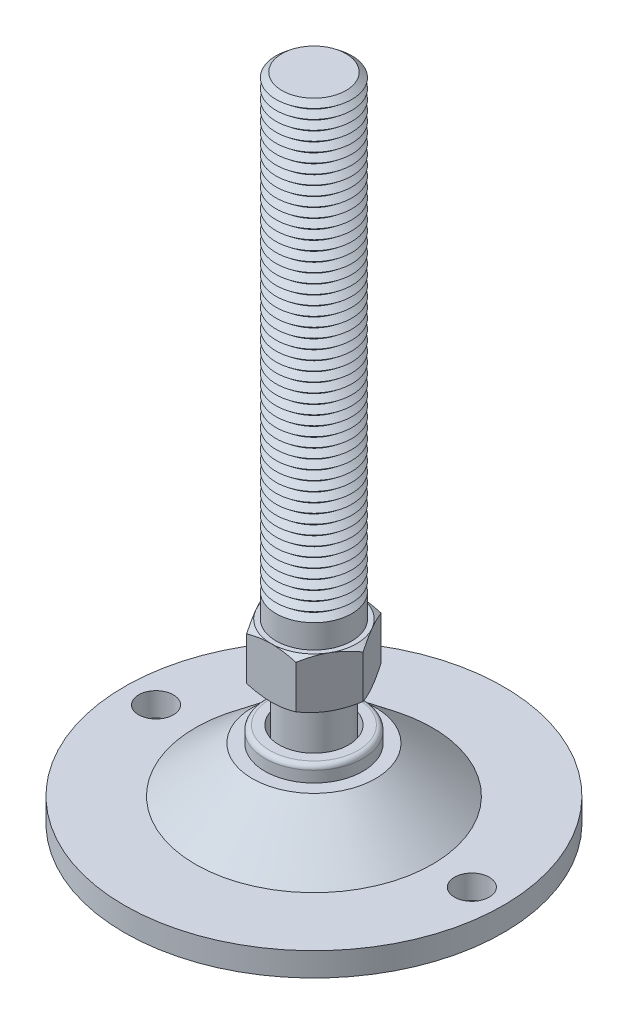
ISO-10303-21;
HEADER;
FILE_DESCRIPTION(('STEP AP214'),'2;1');
FILE_NAME('part.step','',(''),(''),'','','');
FILE_SCHEMA(('AUTOMOTIVE_DESIGN { 1 0 10303 214 1 1 1 1 }'));
ENDSEC;
DATA;
#1=APPLICATION_CONTEXT('core data for automotive mechanical design processes');
#2=APPLICATION_PROTOCOL_DEFINITION('international standard','automotive_design',2000,#1);
#3=PRODUCT_CONTEXT('',#1,'mechanical');
#4=PRODUCT('Part','Part','',(#3));
#5=PRODUCT_RELATED_PRODUCT_CATEGORY('part','',(#4));
#6=PRODUCT_DEFINITION_FORMATION('','',#4);
#7=PRODUCT_DEFINITION_CONTEXT('part definition',#1,'design');
#8=PRODUCT_DEFINITION('design','',#6,#7);
#9=PRODUCT_DEFINITION_SHAPE('','',#8);
#10=(LENGTH_UNIT() NAMED_UNIT(*) SI_UNIT(.MILLI.,.METRE.));
#11=(NAMED_UNIT(*) PLANE_ANGLE_UNIT() SI_UNIT($,.RADIAN.));
#12=(NAMED_UNIT(*) SI_UNIT($,.STERADIAN.) SOLID_ANGLE_UNIT());
#13=UNCERTAINTY_MEASURE_WITH_UNIT(LENGTH_MEASURE(1.E-05),#10,'distance_accuracy_value','');
#14=(GEOMETRIC_REPRESENTATION_CONTEXT(3) GLOBAL_UNCERTAINTY_ASSIGNED_CONTEXT((#13)) GLOBAL_UNIT_ASSIGNED_CONTEXT((#10,
#11,#12)) REPRESENTATION_CONTEXT('',''));
#15=CARTESIAN_POINT('',(0.,0.,0.));
#16=DIRECTION('',(0.,0.,1.));
#17=DIRECTION('',(1.,0.,0.));
#18=AXIS2_PLACEMENT_3D('',#15,#16,#17);
#19=CARTESIAN_POINT('',(0.,194.,0.));
#20=DIRECTION('',(0.,-1.,0.));
#21=DIRECTION('',(0.,0.,-1.));
#22=AXIS2_PLACEMENT_3D('',#19,#20,#21);
#23=CONICAL_SURFACE('',#22,10.1265006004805,0.895664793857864);
#24=CARTESIAN_POINT('',(0.,192.5,0.));
#25=DIRECTION('',(0.,-1.,0.));
#26=DIRECTION('',(0.,0.,-1.));
#27=AXIS2_PLACEMENT_3D('',#24,#25,#26);
#28=CIRCLE('',#27,12.);
#29=CARTESIAN_POINT('',(0.,192.5,-12.));
#30=VERTEX_POINT('',#29);
#31=EDGE_CURVE('P0_E1716',#30,#30,#28,.T.);
#32=ORIENTED_EDGE('',*,*,#31,.F.);
#33=EDGE_LOOP('',(#32));
#34=FACE_BOUND('',#33,.T.);
#35=CARTESIAN_POINT('',(0.,194.,0.));
#36=DIRECTION('',(0.,-1.,0.));
#37=DIRECTION('',(0.,0.,-1.));
#38=AXIS2_PLACEMENT_3D('',#35,#36,#37);
#39=CIRCLE('',#38,10.1265006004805);
#40=CARTESIAN_POINT('',(0.,194.,-10.1265006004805));
#41=VERTEX_POINT('',#40);
#42=EDGE_CURVE('P0_E1725',#41,#41,#39,.T.);
#43=ORIENTED_EDGE('',*,*,#42,.T.);
#44=EDGE_LOOP('',(#43));
#45=FACE_BOUND('',#44,.T.);
#46=ADVANCED_FACE('P0_F16',(#34,#45),#23,.T.);
#47=CARTESIAN_POINT('',(0.,195.5,0.));
#48=DIRECTION('',(0.,1.,0.));
#49=DIRECTION('',(0.,0.,1.));
#50=AXIS2_PLACEMENT_3D('',#47,#48,#49);
#51=CONICAL_SURFACE('',#50,12.,0.895664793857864);
#52=ORIENTED_EDGE('',*,*,#42,.F.);
#53=EDGE_LOOP('',(#52));
#54=FACE_BOUND('',#53,.T.);
#55=CARTESIAN_POINT('',(0.,195.5,0.));
#56=DIRECTION('',(0.,-1.,0.));
#57=DIRECTION('',(0.,0.,-1.));
#58=AXIS2_PLACEMENT_3D('',#55,#56,#57);
#59=CIRCLE('',#58,12.);
#60=CARTESIAN_POINT('',(0.,195.5,-12.));
#61=VERTEX_POINT('',#60);
#62=EDGE_CURVE('P0_E1722',#61,#61,#59,.T.);
#63=ORIENTED_EDGE('',*,*,#62,.T.);
#64=EDGE_LOOP('',(#63));
#65=FACE_BOUND('',#64,.T.);
#66=ADVANCED_FACE('P0_F308',(#54,#65),#51,.T.);
#67=CARTESIAN_POINT('',(0.,206.,0.));
#68=DIRECTION('',(0.,1.,0.));
#69=DIRECTION('',(0.,0.,1.));
#70=AXIS2_PLACEMENT_3D('',#67,#68,#69);
#71=PLANE('',#70);
#72=CARTESIAN_POINT('',(0.,206.,0.));
#73=DIRECTION('',(0.,-1.,0.));
#74=DIRECTION('',(0.,0.,-1.));
#75=AXIS2_PLACEMENT_3D('',#72,#73,#74);
#76=CIRCLE('',#75,10.1265006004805);
#77=CARTESIAN_POINT('',(0.,206.,-10.1265006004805));
#78=VERTEX_POINT('',#77);
#79=EDGE_CURVE('P0_E143',#78,#78,#76,.T.);
#80=ORIENTED_EDGE('',*,*,#79,.F.);
#81=EDGE_LOOP('',(#80));
#82=FACE_BOUND('',#81,.T.);
#83=ADVANCED_FACE('P0_F314',(#82),#71,.T.);
#84=CARTESIAN_POINT('',(0.,206.,0.));
#85=DIRECTION('',(0.,-1.,0.));
#86=DIRECTION('',(0.,0.,-1.));
#87=AXIS2_PLACEMENT_3D('',#84,#85,#86);
#88=CONICAL_SURFACE('',#87,10.1265006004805,0.895664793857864);
#89=CARTESIAN_POINT('',(0.,204.5,0.));
#90=DIRECTION('',(0.,-1.,0.));
#91=DIRECTION('',(0.,0.,-1.));
#92=AXIS2_PLACEMENT_3D('',#89,#90,#91);
#93=CIRCLE('',#92,12.);
#94=CARTESIAN_POINT('',(0.,204.5,-12.));
#95=VERTEX_POINT('',#94);
#96=EDGE_CURVE('P0_E353',#95,#95,#93,.T.);
#97=ORIENTED_EDGE('',*,*,#96,.F.);
#98=EDGE_LOOP('',(#97));
#99=FACE_BOUND('',#98,.T.);
#100=ORIENTED_EDGE('',*,*,#79,.T.);
#101=EDGE_LOOP('',(#100));
#102=FACE_BOUND('',#101,.T.);
#103=ADVANCED_FACE('P0_F211',(#99,#102),#88,.T.);
#104=CARTESIAN_POINT('',(0.,204.5,0.));
#105=DIRECTION('',(0.,1.,0.));
#106=DIRECTION('',(0.,0.,1.));
#107=AXIS2_PLACEMENT_3D('',#104,#105,#106);
#108=CONICAL_SURFACE('',#107,12.,0.895664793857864);
#109=CARTESIAN_POINT('',(0.,203.,0.));
#110=DIRECTION('',(0.,-1.,0.));
#111=DIRECTION('',(0.,0.,-1.));
#112=AXIS2_PLACEMENT_3D('',#109,#110,#111);
#113=CIRCLE('',#112,10.1265006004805);
#114=CARTESIAN_POINT('',(0.,203.,-10.1265006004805));
#115=VERTEX_POINT('',#114);
#116=EDGE_CURVE('P0_E352',#115,#115,#113,.T.);
#117=ORIENTED_EDGE('',*,*,#116,.F.);
#118=EDGE_LOOP('',(#117));
#119=FACE_BOUND('',#118,.T.);
#120=ORIENTED_EDGE('',*,*,#96,.T.);
#121=EDGE_LOOP('',(#120));
#122=FACE_BOUND('',#121,.T.);
#123=ADVANCED_FACE('P0_F339',(#119,#122),#108,.T.);
#124=CARTESIAN_POINT('',(0.,203.,0.));
#125=DIRECTION('',(0.,-1.,0.));
#126=DIRECTION('',(0.,0.,-1.));
#127=AXIS2_PLACEMENT_3D('',#124,#125,#126);
#128=CONICAL_SURFACE('',#127,10.1265006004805,0.895664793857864);
#129=CARTESIAN_POINT('',(0.,201.5,0.));
#130=DIRECTION('',(0.,-1.,0.));
#131=DIRECTION('',(0.,0.,-1.));
#132=AXIS2_PLACEMENT_3D('',#129,#130,#131);
#133=CIRCLE('',#132,12.);
#134=CARTESIAN_POINT('',(0.,201.5,-12.));
#135=VERTEX_POINT('',#134);
#136=EDGE_CURVE('P0_E349',#135,#135,#133,.T.);
#137=ORIENTED_EDGE('',*,*,#136,.F.);
#138=EDGE_LOOP('',(#137));
#139=FACE_BOUND('',#138,.T.);
#140=ORIENTED_EDGE('',*,*,#116,.T.);
#141=EDGE_LOOP('',(#140));
#142=FACE_BOUND('',#141,.T.);
#143=ADVANCED_FACE('P0_F334',(#139,#142),#128,.T.);
#144=CARTESIAN_POINT('',(0.,201.5,0.));
#145=DIRECTION('',(0.,1.,0.));
#146=DIRECTION('',(0.,0.,1.));
#147=AXIS2_PLACEMENT_3D('',#144,#145,#146);
#148=CONICAL_SURFACE('',#147,12.,0.895664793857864);
#149=CARTESIAN_POINT('',(0.,200.,0.));
#150=DIRECTION('',(0.,-1.,0.));
#151=DIRECTION('',(0.,0.,-1.));
#152=AXIS2_PLACEMENT_3D('',#149,#150,#151);
#153=CIRCLE('',#152,10.1265006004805);
#154=CARTESIAN_POINT('',(0.,200.,-10.1265006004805));
#155=VERTEX_POINT('',#154);
#156=EDGE_CURVE('P0_E358',#155,#155,#153,.T.);
#157=ORIENTED_EDGE('',*,*,#156,.F.);
#158=EDGE_LOOP('',(#157));
#159=FACE_BOUND('',#158,.T.);
#160=ORIENTED_EDGE('',*,*,#136,.T.);
#161=EDGE_LOOP('',(#160));
#162=FACE_BOUND('',#161,.T.);
#163=ADVANCED_FACE('P0_F331',(#159,#162),#148,.T.);
#164=CARTESIAN_POINT('',(0.,200.,0.));
#165=DIRECTION('',(0.,-1.,0.));
#166=DIRECTION('',(0.,0.,-1.));
#167=AXIS2_PLACEMENT_3D('',#164,#165,#166);
#168=CONICAL_SURFACE('',#167,10.1265006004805,0.895664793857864);
#169=CARTESIAN_POINT('',(0.,198.5,0.));
#170=DIRECTION('',(0.,-1.,0.));
#171=DIRECTION('',(0.,0.,-1.));
#172=AXIS2_PLACEMENT_3D('',#169,#170,#171);
#173=CIRCLE('',#172,12.);
#174=CARTESIAN_POINT('',(0.,198.5,-12.));
#175=VERTEX_POINT('',#174);
#176=EDGE_CURVE('P0_E1728',#175,#175,#173,.T.);
#177=ORIENTED_EDGE('',*,*,#176,.F.);
#178=EDGE_LOOP('',(#177));
#179=FACE_BOUND('',#178,.T.);
#180=ORIENTED_EDGE('',*,*,#156,.T.);
#181=EDGE_LOOP('',(#180));
#182=FACE_BOUND('',#181,.T.);
#183=ADVANCED_FACE('P0_F325',(#179,#182),#168,.T.);
#184=CARTESIAN_POINT('',(0.,198.5,0.));
#185=DIRECTION('',(0.,1.,0.));
#186=DIRECTION('',(0.,0.,1.));
#187=AXIS2_PLACEMENT_3D('',#184,#185,#186);
#188=CONICAL_SURFACE('',#187,12.,0.895664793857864);
#189=CARTESIAN_POINT('',(0.,197.,0.));
#190=DIRECTION('',(0.,-1.,0.));
#191=DIRECTION('',(0.,0.,-1.));
#192=AXIS2_PLACEMENT_3D('',#189,#190,#191);
#193=CIRCLE('',#192,10.1265006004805);
#194=CARTESIAN_POINT('',(0.,197.,-10.1265006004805));
#195=VERTEX_POINT('',#194);
#196=EDGE_CURVE('P0_E1731',#195,#195,#193,.T.);
#197=ORIENTED_EDGE('',*,*,#196,.F.);
#198=EDGE_LOOP('',(#197));
#199=FACE_BOUND('',#198,.T.);
#200=ORIENTED_EDGE('',*,*,#176,.T.);
#201=EDGE_LOOP('',(#200));
#202=FACE_BOUND('',#201,.T.);
#203=ADVANCED_FACE('P0_F321',(#199,#202),#188,.T.);
#204=CARTESIAN_POINT('',(0.,197.,0.));
#205=DIRECTION('',(0.,-1.,0.));
#206=DIRECTION('',(0.,0.,-1.));
#207=AXIS2_PLACEMENT_3D('',#204,#205,#206);
#208=CONICAL_SURFACE('',#207,10.1265006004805,0.895664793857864);
#209=ORIENTED_EDGE('',*,*,#62,.F.);
#210=EDGE_LOOP('',(#209));
#211=FACE_BOUND('',#210,.T.);
#212=ORIENTED_EDGE('',*,*,#196,.T.);
#213=EDGE_LOOP('',(#212));
#214=FACE_BOUND('',#213,.T.);
#215=ADVANCED_FACE('P0_F324',(#211,#214),#208,.T.);
#216=CARTESIAN_POINT('',(0.,191.,0.));
#217=DIRECTION('',(0.,-1.,0.));
#218=DIRECTION('',(0.,0.,-1.));
#219=AXIS2_PLACEMENT_3D('',#216,#217,#218);
#220=CONICAL_SURFACE('',#219,10.1265006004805,0.895664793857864);
#221=CARTESIAN_POINT('',(0.,189.5,0.));
#222=DIRECTION('',(0.,-1.,0.));
#223=DIRECTION('',(0.,0.,-1.));
#224=AXIS2_PLACEMENT_3D('',#221,#222,#223);
#225=CIRCLE('',#224,12.);
#226=CARTESIAN_POINT('',(0.,189.5,-12.));
#227=VERTEX_POINT('',#226);
#228=EDGE_CURVE('P0_E1710',#227,#227,#225,.T.);
#229=ORIENTED_EDGE('',*,*,#228,.F.);
#230=EDGE_LOOP('',(#229));
#231=FACE_BOUND('',#230,.T.);
#232=CARTESIAN_POINT('',(0.,191.,0.));
#233=DIRECTION('',(0.,-1.,0.));
#234=DIRECTION('',(0.,0.,-1.));
#235=AXIS2_PLACEMENT_3D('',#232,#233,#234);
#236=CIRCLE('',#235,10.1265006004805);
#237=CARTESIAN_POINT('',(0.,191.,-10.1265006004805));
#238=VERTEX_POINT('',#237);
#239=EDGE_CURVE('P0_E1719',#238,#238,#236,.T.);
#240=ORIENTED_EDGE('',*,*,#239,.T.);
#241=EDGE_LOOP('',(#240));
#242=FACE_BOUND('',#241,.T.);
#243=ADVANCED_FACE('P0_F329',(#231,#242),#220,.T.);
#244=CARTESIAN_POINT('',(0.,192.5,0.));
#245=DIRECTION('',(0.,1.,0.));
#246=DIRECTION('',(0.,0.,1.));
#247=AXIS2_PLACEMENT_3D('',#244,#245,#246);
#248=CONICAL_SURFACE('',#247,12.,0.895664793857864);
#249=ORIENTED_EDGE('',*,*,#239,.F.);
#250=EDGE_LOOP('',(#249));
#251=FACE_BOUND('',#250,.T.);
#252=ORIENTED_EDGE('',*,*,#31,.T.);
#253=EDGE_LOOP('',(#252));
#254=FACE_BOUND('',#253,.T.);
#255=ADVANCED_FACE('P0_F1364',(#251,#254),#248,.T.);
#256=CARTESIAN_POINT('',(0.,188.,0.));
#257=DIRECTION('',(0.,-1.,0.));
#258=DIRECTION('',(0.,0.,-1.));
#259=AXIS2_PLACEMENT_3D('',#256,#257,#258);
#260=CONICAL_SURFACE('',#259,10.1265006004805,0.895664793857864);
#261=CARTESIAN_POINT('',(0.,186.5,0.));
#262=DIRECTION('',(0.,-1.,0.));
#263=DIRECTION('',(0.,0.,-1.));
#264=AXIS2_PLACEMENT_3D('',#261,#262,#263);
#265=CIRCLE('',#264,12.);
#266=CARTESIAN_POINT('',(0.,186.5,-12.));
#267=VERTEX_POINT('',#266);
#268=EDGE_CURVE('P0_E1704',#267,#267,#265,.T.);
#269=ORIENTED_EDGE('',*,*,#268,.F.);
#270=EDGE_LOOP('',(#269));
#271=FACE_BOUND('',#270,.T.);
#272=CARTESIAN_POINT('',(0.,188.,0.));
#273=DIRECTION('',(0.,-1.,0.));
#274=DIRECTION('',(0.,0.,-1.));
#275=AXIS2_PLACEMENT_3D('',#272,#273,#274);
#276=CIRCLE('',#275,10.1265006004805);
#277=CARTESIAN_POINT('',(0.,188.,-10.1265006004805));
#278=VERTEX_POINT('',#277);
#279=EDGE_CURVE('P0_E1713',#278,#278,#276,.T.);
#280=ORIENTED_EDGE('',*,*,#279,.T.);
#281=EDGE_LOOP('',(#280));
#282=FACE_BOUND('',#281,.T.);
#283=ADVANCED_FACE('P0_F1354',(#271,#282),#260,.T.);
#284=CARTESIAN_POINT('',(0.,189.5,0.));
#285=DIRECTION('',(0.,1.,0.));
#286=DIRECTION('',(0.,0.,1.));
#287=AXIS2_PLACEMENT_3D('',#284,#285,#286);
#288=CONICAL_SURFACE('',#287,12.,0.895664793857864);
#289=ORIENTED_EDGE('',*,*,#279,.F.);
#290=EDGE_LOOP('',(#289));
#291=FACE_BOUND('',#290,.T.);
#292=ORIENTED_EDGE('',*,*,#228,.T.);
#293=EDGE_LOOP('',(#292));
#294=FACE_BOUND('',#293,.T.);
#295=ADVANCED_FACE('P0_F1344',(#291,#294),#288,.T.);
#296=CARTESIAN_POINT('',(0.,185.,0.));
#297=DIRECTION('',(0.,-1.,0.));
#298=DIRECTION('',(0.,0.,-1.));
#299=AXIS2_PLACEMENT_3D('',#296,#297,#298);
#300=CONICAL_SURFACE('',#299,10.1265006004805,0.895664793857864);
#301=CARTESIAN_POINT('',(0.,183.5,0.));
#302=DIRECTION('',(0.,-1.,0.));
#303=DIRECTION('',(0.,0.,-1.));
#304=AXIS2_PLACEMENT_3D('',#301,#302,#303);
#305=CIRCLE('',#304,12.);
#306=CARTESIAN_POINT('',(0.,183.5,-12.));
#307=VERTEX_POINT('',#306);
#308=EDGE_CURVE('P0_E1698',#307,#307,#305,.T.);
#309=ORIENTED_EDGE('',*,*,#308,.F.);
#310=EDGE_LOOP('',(#309));
#311=FACE_BOUND('',#310,.T.);
#312=CARTESIAN_POINT('',(0.,185.,0.));
#313=DIRECTION('',(0.,-1.,0.));
#314=DIRECTION('',(0.,0.,-1.));
#315=AXIS2_PLACEMENT_3D('',#312,#313,#314);
#316=CIRCLE('',#315,10.1265006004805);
#317=CARTESIAN_POINT('',(0.,185.,-10.1265006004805));
#318=VERTEX_POINT('',#317);
#319=EDGE_CURVE('P0_E1707',#318,#318,#316,.T.);
#320=ORIENTED_EDGE('',*,*,#319,.T.);
#321=EDGE_LOOP('',(#320));
#322=FACE_BOUND('',#321,.T.);
#323=ADVANCED_FACE('P0_F1334',(#311,#322),#300,.T.);
#324=CARTESIAN_POINT('',(0.,186.5,0.));
#325=DIRECTION('',(0.,1.,0.));
#326=DIRECTION('',(0.,0.,1.));
#327=AXIS2_PLACEMENT_3D('',#324,#325,#326);
#328=CONICAL_SURFACE('',#327,12.,0.895664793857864);
#329=ORIENTED_EDGE('',*,*,#319,.F.);
#330=EDGE_LOOP('',(#329));
#331=FACE_BOUND('',#330,.T.);
#332=ORIENTED_EDGE('',*,*,#268,.T.);
#333=EDGE_LOOP('',(#332));
#334=FACE_BOUND('',#333,.T.);
#335=ADVANCED_FACE('P0_F1324',(#331,#334),#328,.T.);
#336=CARTESIAN_POINT('',(0.,182.,0.));
#337=DIRECTION('',(0.,-1.,0.));
#338=DIRECTION('',(0.,0.,-1.));
#339=AXIS2_PLACEMENT_3D('',#336,#337,#338);
#340=CONICAL_SURFACE('',#339,10.1265006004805,0.895664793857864);
#341=CARTESIAN_POINT('',(0.,180.5,0.));
#342=DIRECTION('',(0.,-1.,0.));
#343=DIRECTION('',(0.,0.,-1.));
#344=AXIS2_PLACEMENT_3D('',#341,#342,#343);
#345=CIRCLE('',#344,12.);
#346=CARTESIAN_POINT('',(0.,180.5,-12.));
#347=VERTEX_POINT('',#346);
#348=EDGE_CURVE('P0_E1692',#347,#347,#345,.T.);
#349=ORIENTED_EDGE('',*,*,#348,.F.);
#350=EDGE_LOOP('',(#349));
#351=FACE_BOUND('',#350,.T.);
#352=CARTESIAN_POINT('',(0.,182.,0.));
#353=DIRECTION('',(0.,-1.,0.));
#354=DIRECTION('',(0.,0.,-1.));
#355=AXIS2_PLACEMENT_3D('',#352,#353,#354);
#356=CIRCLE('',#355,10.1265006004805);
#357=CARTESIAN_POINT('',(0.,182.,-10.1265006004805));
#358=VERTEX_POINT('',#357);
#359=EDGE_CURVE('P0_E1701',#358,#358,#356,.T.);
#360=ORIENTED_EDGE('',*,*,#359,.T.);
#361=EDGE_LOOP('',(#360));
#362=FACE_BOUND('',#361,.T.);
#363=ADVANCED_FACE('P0_F1314',(#351,#362),#340,.T.);
#364=CARTESIAN_POINT('',(0.,183.5,0.));
#365=DIRECTION('',(0.,1.,0.));
#366=DIRECTION('',(0.,0.,1.));
#367=AXIS2_PLACEMENT_3D('',#364,#365,#366);
#368=CONICAL_SURFACE('',#367,12.,0.895664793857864);
#369=ORIENTED_EDGE('',*,*,#359,.F.);
#370=EDGE_LOOP('',(#369));
#371=FACE_BOUND('',#370,.T.);
#372=ORIENTED_EDGE('',*,*,#308,.T.);
#373=EDGE_LOOP('',(#372));
#374=FACE_BOUND('',#373,.T.);
#375=ADVANCED_FACE('P0_F1304',(#371,#374),#368,.T.);
#376=CARTESIAN_POINT('',(0.,179.,0.));
#377=DIRECTION('',(0.,-1.,0.));
#378=DIRECTION('',(0.,0.,-1.));
#379=AXIS2_PLACEMENT_3D('',#376,#377,#378);
#380=CONICAL_SURFACE('',#379,10.1265006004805,0.895664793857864);
#381=CARTESIAN_POINT('',(0.,177.5,0.));
#382=DIRECTION('',(0.,-1.,0.));
#383=DIRECTION('',(0.,0.,-1.));
#384=AXIS2_PLACEMENT_3D('',#381,#382,#383);
#385=CIRCLE('',#384,12.);
#386=CARTESIAN_POINT('',(0.,177.5,-12.));
#387=VERTEX_POINT('',#386);
#388=EDGE_CURVE('P0_E1686',#387,#387,#385,.T.);
#389=ORIENTED_EDGE('',*,*,#388,.F.);
#390=EDGE_LOOP('',(#389));
#391=FACE_BOUND('',#390,.T.);
#392=CARTESIAN_POINT('',(0.,179.,0.));
#393=DIRECTION('',(0.,-1.,0.));
#394=DIRECTION('',(0.,0.,-1.));
#395=AXIS2_PLACEMENT_3D('',#392,#393,#394);
#396=CIRCLE('',#395,10.1265006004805);
#397=CARTESIAN_POINT('',(0.,179.,-10.1265006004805));
#398=VERTEX_POINT('',#397);
#399=EDGE_CURVE('P0_E1695',#398,#398,#396,.T.);
#400=ORIENTED_EDGE('',*,*,#399,.T.);
#401=EDGE_LOOP('',(#400));
#402=FACE_BOUND('',#401,.T.);
#403=ADVANCED_FACE('P0_F1294',(#391,#402),#380,.T.);
#404=CARTESIAN_POINT('',(0.,180.5,0.));
#405=DIRECTION('',(0.,1.,0.));
#406=DIRECTION('',(0.,0.,1.));
#407=AXIS2_PLACEMENT_3D('',#404,#405,#406);
#408=CONICAL_SURFACE('',#407,12.,0.895664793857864);
#409=ORIENTED_EDGE('',*,*,#399,.F.);
#410=EDGE_LOOP('',(#409));
#411=FACE_BOUND('',#410,.T.);
#412=ORIENTED_EDGE('',*,*,#348,.T.);
#413=EDGE_LOOP('',(#412));
#414=FACE_BOUND('',#413,.T.);
#415=ADVANCED_FACE('P0_F1284',(#411,#414),#408,.T.);
#416=CARTESIAN_POINT('',(0.,176.,0.));
#417=DIRECTION('',(0.,-1.,0.));
#418=DIRECTION('',(0.,0.,-1.));
#419=AXIS2_PLACEMENT_3D('',#416,#417,#418);
#420=CONICAL_SURFACE('',#419,10.1265006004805,0.895664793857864);
#421=CARTESIAN_POINT('',(0.,174.5,0.));
#422=DIRECTION('',(0.,-1.,0.));
#423=DIRECTION('',(0.,0.,-1.));
#424=AXIS2_PLACEMENT_3D('',#421,#422,#423);
#425=CIRCLE('',#424,12.);
#426=CARTESIAN_POINT('',(0.,174.5,-12.));
#427=VERTEX_POINT('',#426);
#428=EDGE_CURVE('P0_E1680',#427,#427,#425,.T.);
#429=ORIENTED_EDGE('',*,*,#428,.F.);
#430=EDGE_LOOP('',(#429));
#431=FACE_BOUND('',#430,.T.);
#432=CARTESIAN_POINT('',(0.,176.,0.));
#433=DIRECTION('',(0.,-1.,0.));
#434=DIRECTION('',(0.,0.,-1.));
#435=AXIS2_PLACEMENT_3D('',#432,#433,#434);
#436=CIRCLE('',#435,10.1265006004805);
#437=CARTESIAN_POINT('',(0.,176.,-10.1265006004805));
#438=VERTEX_POINT('',#437);
#439=EDGE_CURVE('P0_E1689',#438,#438,#436,.T.);
#440=ORIENTED_EDGE('',*,*,#439,.T.);
#441=EDGE_LOOP('',(#440));
#442=FACE_BOUND('',#441,.T.);
#443=ADVANCED_FACE('P0_F1274',(#431,#442),#420,.T.);
#444=CARTESIAN_POINT('',(0.,177.5,0.));
#445=DIRECTION('',(0.,1.,0.));
#446=DIRECTION('',(0.,0.,1.));
#447=AXIS2_PLACEMENT_3D('',#444,#445,#446);
#448=CONICAL_SURFACE('',#447,12.,0.895664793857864);
#449=ORIENTED_EDGE('',*,*,#439,.F.);
#450=EDGE_LOOP('',(#449));
#451=FACE_BOUND('',#450,.T.);
#452=ORIENTED_EDGE('',*,*,#388,.T.);
#453=EDGE_LOOP('',(#452));
#454=FACE_BOUND('',#453,.T.);
#455=ADVANCED_FACE('P0_F1264',(#451,#454),#448,.T.);
#456=CARTESIAN_POINT('',(0.,173.,0.));
#457=DIRECTION('',(0.,-1.,0.));
#458=DIRECTION('',(0.,0.,-1.));
#459=AXIS2_PLACEMENT_3D('',#456,#457,#458);
#460=CONICAL_SURFACE('',#459,10.1265006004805,0.895664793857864);
#461=CARTESIAN_POINT('',(0.,171.5,0.));
#462=DIRECTION('',(0.,-1.,0.));
#463=DIRECTION('',(0.,0.,-1.));
#464=AXIS2_PLACEMENT_3D('',#461,#462,#463);
#465=CIRCLE('',#464,12.);
#466=CARTESIAN_POINT('',(0.,171.5,-12.));
#467=VERTEX_POINT('',#466);
#468=EDGE_CURVE('P0_E1674',#467,#467,#465,.T.);
#469=ORIENTED_EDGE('',*,*,#468,.F.);
#470=EDGE_LOOP('',(#469));
#471=FACE_BOUND('',#470,.T.);
#472=CARTESIAN_POINT('',(0.,173.,0.));
#473=DIRECTION('',(0.,-1.,0.));
#474=DIRECTION('',(0.,0.,-1.));
#475=AXIS2_PLACEMENT_3D('',#472,#473,#474);
#476=CIRCLE('',#475,10.1265006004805);
#477=CARTESIAN_POINT('',(0.,173.,-10.1265006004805));
#478=VERTEX_POINT('',#477);
#479=EDGE_CURVE('P0_E1683',#478,#478,#476,.T.);
#480=ORIENTED_EDGE('',*,*,#479,.T.);
#481=EDGE_LOOP('',(#480));
#482=FACE_BOUND('',#481,.T.);
#483=ADVANCED_FACE('P0_F1254',(#471,#482),#460,.T.);
#484=CARTESIAN_POINT('',(0.,174.5,0.));
#485=DIRECTION('',(0.,1.,0.));
#486=DIRECTION('',(0.,0.,1.));
#487=AXIS2_PLACEMENT_3D('',#484,#485,#486);
#488=CONICAL_SURFACE('',#487,12.,0.895664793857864);
#489=ORIENTED_EDGE('',*,*,#479,.F.);
#490=EDGE_LOOP('',(#489));
#491=FACE_BOUND('',#490,.T.);
#492=ORIENTED_EDGE('',*,*,#428,.T.);
#493=EDGE_LOOP('',(#492));
#494=FACE_BOUND('',#493,.T.);
#495=ADVANCED_FACE('P0_F1244',(#491,#494),#488,.T.);
#496=CARTESIAN_POINT('',(0.,170.,0.));
#497=DIRECTION('',(0.,-1.,0.));
#498=DIRECTION('',(0.,0.,-1.));
#499=AXIS2_PLACEMENT_3D('',#496,#497,#498);
#500=CONICAL_SURFACE('',#499,10.1265006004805,0.895664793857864);
#501=CARTESIAN_POINT('',(0.,168.5,0.));
#502=DIRECTION('',(0.,-1.,0.));
#503=DIRECTION('',(0.,0.,-1.));
#504=AXIS2_PLACEMENT_3D('',#501,#502,#503);
#505=CIRCLE('',#504,12.);
#506=CARTESIAN_POINT('',(0.,168.5,-12.));
#507=VERTEX_POINT('',#506);
#508=EDGE_CURVE('P0_E1668',#507,#507,#505,.T.);
#509=ORIENTED_EDGE('',*,*,#508,.F.);
#510=EDGE_LOOP('',(#509));
#511=FACE_BOUND('',#510,.T.);
#512=CARTESIAN_POINT('',(0.,170.,0.));
#513=DIRECTION('',(0.,-1.,0.));
#514=DIRECTION('',(0.,0.,-1.));
#515=AXIS2_PLACEMENT_3D('',#512,#513,#514);
#516=CIRCLE('',#515,10.1265006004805);
#517=CARTESIAN_POINT('',(0.,170.,-10.1265006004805));
#518=VERTEX_POINT('',#517);
#519=EDGE_CURVE('P0_E1677',#518,#518,#516,.T.);
#520=ORIENTED_EDGE('',*,*,#519,.T.);
#521=EDGE_LOOP('',(#520));
#522=FACE_BOUND('',#521,.T.);
#523=ADVANCED_FACE('P0_F1234',(#511,#522),#500,.T.);
#524=CARTESIAN_POINT('',(0.,171.5,0.));
#525=DIRECTION('',(0.,1.,0.));
#526=DIRECTION('',(0.,0.,1.));
#527=AXIS2_PLACEMENT_3D('',#524,#525,#526);
#528=CONICAL_SURFACE('',#527,12.,0.895664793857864);
#529=ORIENTED_EDGE('',*,*,#519,.F.);
#530=EDGE_LOOP('',(#529));
#531=FACE_BOUND('',#530,.T.);
#532=ORIENTED_EDGE('',*,*,#468,.T.);
#533=EDGE_LOOP('',(#532));
#534=FACE_BOUND('',#533,.T.);
#535=ADVANCED_FACE('P0_F1224',(#531,#534),#528,.T.);
#536=CARTESIAN_POINT('',(0.,167.,0.));
#537=DIRECTION('',(0.,-1.,0.));
#538=DIRECTION('',(0.,0.,-1.));
#539=AXIS2_PLACEMENT_3D('',#536,#537,#538);
#540=CONICAL_SURFACE('',#539,10.1265006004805,0.895664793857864);
#541=CARTESIAN_POINT('',(0.,165.5,0.));
#542=DIRECTION('',(0.,-1.,0.));
#543=DIRECTION('',(0.,0.,-1.));
#544=AXIS2_PLACEMENT_3D('',#541,#542,#543);
#545=CIRCLE('',#544,12.);
#546=CARTESIAN_POINT('',(0.,165.5,-12.));
#547=VERTEX_POINT('',#546);
#548=EDGE_CURVE('P0_E1662',#547,#547,#545,.T.);
#549=ORIENTED_EDGE('',*,*,#548,.F.);
#550=EDGE_LOOP('',(#549));
#551=FACE_BOUND('',#550,.T.);
#552=CARTESIAN_POINT('',(0.,167.,0.));
#553=DIRECTION('',(0.,-1.,0.));
#554=DIRECTION('',(0.,0.,-1.));
#555=AXIS2_PLACEMENT_3D('',#552,#553,#554);
#556=CIRCLE('',#555,10.1265006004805);
#557=CARTESIAN_POINT('',(0.,167.,-10.1265006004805));
#558=VERTEX_POINT('',#557);
#559=EDGE_CURVE('P0_E1671',#558,#558,#556,.T.);
#560=ORIENTED_EDGE('',*,*,#559,.T.);
#561=EDGE_LOOP('',(#560));
#562=FACE_BOUND('',#561,.T.);
#563=ADVANCED_FACE('P0_F1214',(#551,#562),#540,.T.);
#564=CARTESIAN_POINT('',(0.,168.5,0.));
#565=DIRECTION('',(0.,1.,0.));
#566=DIRECTION('',(0.,0.,1.));
#567=AXIS2_PLACEMENT_3D('',#564,#565,#566);
#568=CONICAL_SURFACE('',#567,12.,0.895664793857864);
#569=ORIENTED_EDGE('',*,*,#559,.F.);
#570=EDGE_LOOP('',(#569));
#571=FACE_BOUND('',#570,.T.);
#572=ORIENTED_EDGE('',*,*,#508,.T.);
#573=EDGE_LOOP('',(#572));
#574=FACE_BOUND('',#573,.T.);
#575=ADVANCED_FACE('P0_F1204',(#571,#574),#568,.T.);
#576=CARTESIAN_POINT('',(0.,164.,0.));
#577=DIRECTION('',(0.,-1.,0.));
#578=DIRECTION('',(0.,0.,-1.));
#579=AXIS2_PLACEMENT_3D('',#576,#577,#578);
#580=CONICAL_SURFACE('',#579,10.1265006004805,0.895664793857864);
#581=CARTESIAN_POINT('',(0.,162.5,0.));
#582=DIRECTION('',(0.,-1.,0.));
#583=DIRECTION('',(0.,0.,-1.));
#584=AXIS2_PLACEMENT_3D('',#581,#582,#583);
#585=CIRCLE('',#584,12.);
#586=CARTESIAN_POINT('',(0.,162.5,-12.));
#587=VERTEX_POINT('',#586);
#588=EDGE_CURVE('P0_E1656',#587,#587,#585,.T.);
#589=ORIENTED_EDGE('',*,*,#588,.F.);
#590=EDGE_LOOP('',(#589));
#591=FACE_BOUND('',#590,.T.);
#592=CARTESIAN_POINT('',(0.,164.,0.));
#593=DIRECTION('',(0.,-1.,0.));
#594=DIRECTION('',(0.,0.,-1.));
#595=AXIS2_PLACEMENT_3D('',#592,#593,#594);
#596=CIRCLE('',#595,10.1265006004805);
#597=CARTESIAN_POINT('',(0.,164.,-10.1265006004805));
#598=VERTEX_POINT('',#597);
#599=EDGE_CURVE('P0_E1665',#598,#598,#596,.T.);
#600=ORIENTED_EDGE('',*,*,#599,.T.);
#601=EDGE_LOOP('',(#600));
#602=FACE_BOUND('',#601,.T.);
#603=ADVANCED_FACE('P0_F1194',(#591,#602),#580,.T.);
#604=CARTESIAN_POINT('',(0.,165.5,0.));
#605=DIRECTION('',(0.,1.,0.));
#606=DIRECTION('',(0.,0.,1.));
#607=AXIS2_PLACEMENT_3D('',#604,#605,#606);
#608=CONICAL_SURFACE('',#607,12.,0.895664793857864);
#609=ORIENTED_EDGE('',*,*,#599,.F.);
#610=EDGE_LOOP('',(#609));
#611=FACE_BOUND('',#610,.T.);
#612=ORIENTED_EDGE('',*,*,#548,.T.);
#613=EDGE_LOOP('',(#612));
#614=FACE_BOUND('',#613,.T.);
#615=ADVANCED_FACE('P0_F1184',(#611,#614),#608,.T.);
#616=CARTESIAN_POINT('',(0.,161.,0.));
#617=DIRECTION('',(0.,-1.,0.));
#618=DIRECTION('',(0.,0.,-1.));
#619=AXIS2_PLACEMENT_3D('',#616,#617,#618);
#620=CONICAL_SURFACE('',#619,10.1265006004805,0.895664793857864);
#621=CARTESIAN_POINT('',(0.,159.5,0.));
#622=DIRECTION('',(0.,-1.,0.));
#623=DIRECTION('',(0.,0.,-1.));
#624=AXIS2_PLACEMENT_3D('',#621,#622,#623);
#625=CIRCLE('',#624,12.);
#626=CARTESIAN_POINT('',(0.,159.5,-12.));
#627=VERTEX_POINT('',#626);
#628=EDGE_CURVE('P0_E1650',#627,#627,#625,.T.);
#629=ORIENTED_EDGE('',*,*,#628,.F.);
#630=EDGE_LOOP('',(#629));
#631=FACE_BOUND('',#630,.T.);
#632=CARTESIAN_POINT('',(0.,161.,0.));
#633=DIRECTION('',(0.,-1.,0.));
#634=DIRECTION('',(0.,0.,-1.));
#635=AXIS2_PLACEMENT_3D('',#632,#633,#634);
#636=CIRCLE('',#635,10.1265006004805);
#637=CARTESIAN_POINT('',(0.,161.,-10.1265006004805));
#638=VERTEX_POINT('',#637);
#639=EDGE_CURVE('P0_E1659',#638,#638,#636,.T.);
#640=ORIENTED_EDGE('',*,*,#639,.T.);
#641=EDGE_LOOP('',(#640));
#642=FACE_BOUND('',#641,.T.);
#643=ADVANCED_FACE('P0_F1174',(#631,#642),#620,.T.);
#644=CARTESIAN_POINT('',(0.,162.5,0.));
#645=DIRECTION('',(0.,1.,0.));
#646=DIRECTION('',(0.,0.,1.));
#647=AXIS2_PLACEMENT_3D('',#644,#645,#646);
#648=CONICAL_SURFACE('',#647,12.,0.895664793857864);
#649=ORIENTED_EDGE('',*,*,#639,.F.);
#650=EDGE_LOOP('',(#649));
#651=FACE_BOUND('',#650,.T.);
#652=ORIENTED_EDGE('',*,*,#588,.T.);
#653=EDGE_LOOP('',(#652));
#654=FACE_BOUND('',#653,.T.);
#655=ADVANCED_FACE('P0_F1164',(#651,#654),#648,.T.);
#656=CARTESIAN_POINT('',(0.,158.,0.));
#657=DIRECTION('',(0.,-1.,0.));
#658=DIRECTION('',(0.,0.,-1.));
#659=AXIS2_PLACEMENT_3D('',#656,#657,#658);
#660=CONICAL_SURFACE('',#659,10.1265006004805,0.895664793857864);
#661=CARTESIAN_POINT('',(0.,156.5,0.));
#662=DIRECTION('',(0.,-1.,0.));
#663=DIRECTION('',(0.,0.,-1.));
#664=AXIS2_PLACEMENT_3D('',#661,#662,#663);
#665=CIRCLE('',#664,12.);
#666=CARTESIAN_POINT('',(0.,156.5,-12.));
#667=VERTEX_POINT('',#666);
#668=EDGE_CURVE('P0_E1644',#667,#667,#665,.T.);
#669=ORIENTED_EDGE('',*,*,#668,.F.);
#670=EDGE_LOOP('',(#669));
#671=FACE_BOUND('',#670,.T.);
#672=CARTESIAN_POINT('',(0.,158.,0.));
#673=DIRECTION('',(0.,-1.,0.));
#674=DIRECTION('',(0.,0.,-1.));
#675=AXIS2_PLACEMENT_3D('',#672,#673,#674);
#676=CIRCLE('',#675,10.1265006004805);
#677=CARTESIAN_POINT('',(0.,158.,-10.1265006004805));
#678=VERTEX_POINT('',#677);
#679=EDGE_CURVE('P0_E1653',#678,#678,#676,.T.);
#680=ORIENTED_EDGE('',*,*,#679,.T.);
#681=EDGE_LOOP('',(#680));
#682=FACE_BOUND('',#681,.T.);
#683=ADVANCED_FACE('P0_F1154',(#671,#682),#660,.T.);
#684=CARTESIAN_POINT('',(0.,159.5,0.));
#685=DIRECTION('',(0.,1.,0.));
#686=DIRECTION('',(0.,0.,1.));
#687=AXIS2_PLACEMENT_3D('',#684,#685,#686);
#688=CONICAL_SURFACE('',#687,12.,0.895664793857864);
#689=ORIENTED_EDGE('',*,*,#679,.F.);
#690=EDGE_LOOP('',(#689));
#691=FACE_BOUND('',#690,.T.);
#692=ORIENTED_EDGE('',*,*,#628,.T.);
#693=EDGE_LOOP('',(#692));
#694=FACE_BOUND('',#693,.T.);
#695=ADVANCED_FACE('P0_F1144',(#691,#694),#688,.T.);
#696=CARTESIAN_POINT('',(0.,155.,0.));
#697=DIRECTION('',(0.,-1.,0.));
#698=DIRECTION('',(0.,0.,-1.));
#699=AXIS2_PLACEMENT_3D('',#696,#697,#698);
#700=CONICAL_SURFACE('',#699,10.1265006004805,0.895664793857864);
#701=CARTESIAN_POINT('',(0.,153.5,0.));
#702=DIRECTION('',(0.,-1.,0.));
#703=DIRECTION('',(0.,0.,-1.));
#704=AXIS2_PLACEMENT_3D('',#701,#702,#703);
#705=CIRCLE('',#704,12.);
#706=CARTESIAN_POINT('',(0.,153.5,-12.));
#707=VERTEX_POINT('',#706);
#708=EDGE_CURVE('P0_E1638',#707,#707,#705,.T.);
#709=ORIENTED_EDGE('',*,*,#708,.F.);
#710=EDGE_LOOP('',(#709));
#711=FACE_BOUND('',#710,.T.);
#712=CARTESIAN_POINT('',(0.,155.,0.));
#713=DIRECTION('',(0.,-1.,0.));
#714=DIRECTION('',(0.,0.,-1.));
#715=AXIS2_PLACEMENT_3D('',#712,#713,#714);
#716=CIRCLE('',#715,10.1265006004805);
#717=CARTESIAN_POINT('',(0.,155.,-10.1265006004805));
#718=VERTEX_POINT('',#717);
#719=EDGE_CURVE('P0_E1647',#718,#718,#716,.T.);
#720=ORIENTED_EDGE('',*,*,#719,.T.);
#721=EDGE_LOOP('',(#720));
#722=FACE_BOUND('',#721,.T.);
#723=ADVANCED_FACE('P0_F1134',(#711,#722),#700,.T.);
#724=CARTESIAN_POINT('',(0.,156.5,0.));
#725=DIRECTION('',(0.,1.,0.));
#726=DIRECTION('',(0.,0.,1.));
#727=AXIS2_PLACEMENT_3D('',#724,#725,#726);
#728=CONICAL_SURFACE('',#727,12.,0.895664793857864);
#729=ORIENTED_EDGE('',*,*,#719,.F.);
#730=EDGE_LOOP('',(#729));
#731=FACE_BOUND('',#730,.T.);
#732=ORIENTED_EDGE('',*,*,#668,.T.);
#733=EDGE_LOOP('',(#732));
#734=FACE_BOUND('',#733,.T.);
#735=ADVANCED_FACE('P0_F1124',(#731,#734),#728,.T.);
#736=CARTESIAN_POINT('',(0.,152.,0.));
#737=DIRECTION('',(0.,-1.,0.));
#738=DIRECTION('',(0.,0.,-1.));
#739=AXIS2_PLACEMENT_3D('',#736,#737,#738);
#740=CONICAL_SURFACE('',#739,10.1265006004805,0.895664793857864);
#741=CARTESIAN_POINT('',(0.,150.5,0.));
#742=DIRECTION('',(0.,-1.,0.));
#743=DIRECTION('',(0.,0.,-1.));
#744=AXIS2_PLACEMENT_3D('',#741,#742,#743);
#745=CIRCLE('',#744,12.);
#746=CARTESIAN_POINT('',(0.,150.5,-12.));
#747=VERTEX_POINT('',#746);
#748=EDGE_CURVE('P0_E1632',#747,#747,#745,.T.);
#749=ORIENTED_EDGE('',*,*,#748,.F.);
#750=EDGE_LOOP('',(#749));
#751=FACE_BOUND('',#750,.T.);
#752=CARTESIAN_POINT('',(0.,152.,0.));
#753=DIRECTION('',(0.,-1.,0.));
#754=DIRECTION('',(0.,0.,-1.));
#755=AXIS2_PLACEMENT_3D('',#752,#753,#754);
#756=CIRCLE('',#755,10.1265006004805);
#757=CARTESIAN_POINT('',(0.,152.,-10.1265006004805));
#758=VERTEX_POINT('',#757);
#759=EDGE_CURVE('P0_E1641',#758,#758,#756,.T.);
#760=ORIENTED_EDGE('',*,*,#759,.T.);
#761=EDGE_LOOP('',(#760));
#762=FACE_BOUND('',#761,.T.);
#763=ADVANCED_FACE('P0_F1114',(#751,#762),#740,.T.);
#764=CARTESIAN_POINT('',(0.,153.5,0.));
#765=DIRECTION('',(0.,1.,0.));
#766=DIRECTION('',(0.,0.,1.));
#767=AXIS2_PLACEMENT_3D('',#764,#765,#766);
#768=CONICAL_SURFACE('',#767,12.,0.895664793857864);
#769=ORIENTED_EDGE('',*,*,#759,.F.);
#770=EDGE_LOOP('',(#769));
#771=FACE_BOUND('',#770,.T.);
#772=ORIENTED_EDGE('',*,*,#708,.T.);
#773=EDGE_LOOP('',(#772));
#774=FACE_BOUND('',#773,.T.);
#775=ADVANCED_FACE('P0_F1104',(#771,#774),#768,.T.);
#776=CARTESIAN_POINT('',(0.,149.,0.));
#777=DIRECTION('',(0.,-1.,0.));
#778=DIRECTION('',(0.,0.,-1.));
#779=AXIS2_PLACEMENT_3D('',#776,#777,#778);
#780=CONICAL_SURFACE('',#779,10.1265006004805,0.895664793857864);
#781=CARTESIAN_POINT('',(0.,147.5,0.));
#782=DIRECTION('',(0.,-1.,0.));
#783=DIRECTION('',(0.,0.,-1.));
#784=AXIS2_PLACEMENT_3D('',#781,#782,#783);
#785=CIRCLE('',#784,12.);
#786=CARTESIAN_POINT('',(0.,147.5,-12.));
#787=VERTEX_POINT('',#786);
#788=EDGE_CURVE('P0_E1626',#787,#787,#785,.T.);
#789=ORIENTED_EDGE('',*,*,#788,.F.);
#790=EDGE_LOOP('',(#789));
#791=FACE_BOUND('',#790,.T.);
#792=CARTESIAN_POINT('',(0.,149.,0.));
#793=DIRECTION('',(0.,-1.,0.));
#794=DIRECTION('',(0.,0.,-1.));
#795=AXIS2_PLACEMENT_3D('',#792,#793,#794);
#796=CIRCLE('',#795,10.1265006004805);
#797=CARTESIAN_POINT('',(0.,149.,-10.1265006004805));
#798=VERTEX_POINT('',#797);
#799=EDGE_CURVE('P0_E1635',#798,#798,#796,.T.);
#800=ORIENTED_EDGE('',*,*,#799,.T.);
#801=EDGE_LOOP('',(#800));
#802=FACE_BOUND('',#801,.T.);
#803=ADVANCED_FACE('P0_F1094',(#791,#802),#780,.T.);
#804=CARTESIAN_POINT('',(0.,150.5,0.));
#805=DIRECTION('',(0.,1.,0.));
#806=DIRECTION('',(0.,0.,1.));
#807=AXIS2_PLACEMENT_3D('',#804,#805,#806);
#808=CONICAL_SURFACE('',#807,12.,0.895664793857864);
#809=ORIENTED_EDGE('',*,*,#799,.F.);
#810=EDGE_LOOP('',(#809));
#811=FACE_BOUND('',#810,.T.);
#812=ORIENTED_EDGE('',*,*,#748,.T.);
#813=EDGE_LOOP('',(#812));
#814=FACE_BOUND('',#813,.T.);
#815=ADVANCED_FACE('P0_F1084',(#811,#814),#808,.T.);
#816=CARTESIAN_POINT('',(0.,146.,0.));
#817=DIRECTION('',(0.,-1.,0.));
#818=DIRECTION('',(0.,0.,-1.));
#819=AXIS2_PLACEMENT_3D('',#816,#817,#818);
#820=CONICAL_SURFACE('',#819,10.1265006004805,0.895664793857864);
#821=CARTESIAN_POINT('',(0.,144.5,0.));
#822=DIRECTION('',(0.,-1.,0.));
#823=DIRECTION('',(0.,0.,-1.));
#824=AXIS2_PLACEMENT_3D('',#821,#822,#823);
#825=CIRCLE('',#824,12.);
#826=CARTESIAN_POINT('',(0.,144.5,-12.));
#827=VERTEX_POINT('',#826);
#828=EDGE_CURVE('P0_E1620',#827,#827,#825,.T.);
#829=ORIENTED_EDGE('',*,*,#828,.F.);
#830=EDGE_LOOP('',(#829));
#831=FACE_BOUND('',#830,.T.);
#832=CARTESIAN_POINT('',(0.,146.,0.));
#833=DIRECTION('',(0.,-1.,0.));
#834=DIRECTION('',(0.,0.,-1.));
#835=AXIS2_PLACEMENT_3D('',#832,#833,#834);
#836=CIRCLE('',#835,10.1265006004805);
#837=CARTESIAN_POINT('',(0.,146.,-10.1265006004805));
#838=VERTEX_POINT('',#837);
#839=EDGE_CURVE('P0_E1629',#838,#838,#836,.T.);
#840=ORIENTED_EDGE('',*,*,#839,.T.);
#841=EDGE_LOOP('',(#840));
#842=FACE_BOUND('',#841,.T.);
#843=ADVANCED_FACE('P0_F1074',(#831,#842),#820,.T.);
#844=CARTESIAN_POINT('',(0.,147.5,0.));
#845=DIRECTION('',(0.,1.,0.));
#846=DIRECTION('',(0.,0.,1.));
#847=AXIS2_PLACEMENT_3D('',#844,#845,#846);
#848=CONICAL_SURFACE('',#847,12.,0.895664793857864);
#849=ORIENTED_EDGE('',*,*,#839,.F.);
#850=EDGE_LOOP('',(#849));
#851=FACE_BOUND('',#850,.T.);
#852=ORIENTED_EDGE('',*,*,#788,.T.);
#853=EDGE_LOOP('',(#852));
#854=FACE_BOUND('',#853,.T.);
#855=ADVANCED_FACE('P0_F1064',(#851,#854),#848,.T.);
#856=CARTESIAN_POINT('',(0.,143.,0.));
#857=DIRECTION('',(0.,-1.,0.));
#858=DIRECTION('',(0.,0.,-1.));
#859=AXIS2_PLACEMENT_3D('',#856,#857,#858);
#860=CONICAL_SURFACE('',#859,10.1265006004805,0.895664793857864);
#861=CARTESIAN_POINT('',(0.,141.5,0.));
#862=DIRECTION('',(0.,-1.,0.));
#863=DIRECTION('',(0.,0.,-1.));
#864=AXIS2_PLACEMENT_3D('',#861,#862,#863);
#865=CIRCLE('',#864,12.);
#866=CARTESIAN_POINT('',(0.,141.5,-12.));
#867=VERTEX_POINT('',#866);
#868=EDGE_CURVE('P0_E1614',#867,#867,#865,.T.);
#869=ORIENTED_EDGE('',*,*,#868,.F.);
#870=EDGE_LOOP('',(#869));
#871=FACE_BOUND('',#870,.T.);
#872=CARTESIAN_POINT('',(0.,143.,0.));
#873=DIRECTION('',(0.,-1.,0.));
#874=DIRECTION('',(0.,0.,-1.));
#875=AXIS2_PLACEMENT_3D('',#872,#873,#874);
#876=CIRCLE('',#875,10.1265006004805);
#877=CARTESIAN_POINT('',(0.,143.,-10.1265006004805));
#878=VERTEX_POINT('',#877);
#879=EDGE_CURVE('P0_E1623',#878,#878,#876,.T.);
#880=ORIENTED_EDGE('',*,*,#879,.T.);
#881=EDGE_LOOP('',(#880));
#882=FACE_BOUND('',#881,.T.);
#883=ADVANCED_FACE('P0_F1054',(#871,#882),#860,.T.);
#884=CARTESIAN_POINT('',(0.,144.5,0.));
#885=DIRECTION('',(0.,1.,0.));
#886=DIRECTION('',(0.,0.,1.));
#887=AXIS2_PLACEMENT_3D('',#884,#885,#886);
#888=CONICAL_SURFACE('',#887,12.,0.895664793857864);
#889=ORIENTED_EDGE('',*,*,#879,.F.);
#890=EDGE_LOOP('',(#889));
#891=FACE_BOUND('',#890,.T.);
#892=ORIENTED_EDGE('',*,*,#828,.T.);
#893=EDGE_LOOP('',(#892));
#894=FACE_BOUND('',#893,.T.);
#895=ADVANCED_FACE('P0_F1044',(#891,#894),#888,.T.);
#896=CARTESIAN_POINT('',(0.,140.,0.));
#897=DIRECTION('',(0.,-1.,0.));
#898=DIRECTION('',(0.,0.,-1.));
#899=AXIS2_PLACEMENT_3D('',#896,#897,#898);
#900=CONICAL_SURFACE('',#899,10.1265006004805,0.895664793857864);
#901=CARTESIAN_POINT('',(0.,138.5,0.));
#902=DIRECTION('',(0.,-1.,0.));
#903=DIRECTION('',(0.,0.,-1.));
#904=AXIS2_PLACEMENT_3D('',#901,#902,#903);
#905=CIRCLE('',#904,12.);
#906=CARTESIAN_POINT('',(0.,138.5,-12.));
#907=VERTEX_POINT('',#906);
#908=EDGE_CURVE('P0_E1608',#907,#907,#905,.T.);
#909=ORIENTED_EDGE('',*,*,#908,.F.);
#910=EDGE_LOOP('',(#909));
#911=FACE_BOUND('',#910,.T.);
#912=CARTESIAN_POINT('',(0.,140.,0.));
#913=DIRECTION('',(0.,-1.,0.));
#914=DIRECTION('',(0.,0.,-1.));
#915=AXIS2_PLACEMENT_3D('',#912,#913,#914);
#916=CIRCLE('',#915,10.1265006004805);
#917=CARTESIAN_POINT('',(0.,140.,-10.1265006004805));
#918=VERTEX_POINT('',#917);
#919=EDGE_CURVE('P0_E1617',#918,#918,#916,.T.);
#920=ORIENTED_EDGE('',*,*,#919,.T.);
#921=EDGE_LOOP('',(#920));
#922=FACE_BOUND('',#921,.T.);
#923=ADVANCED_FACE('P0_F1034',(#911,#922),#900,.T.);
#924=CARTESIAN_POINT('',(0.,141.5,0.));
#925=DIRECTION('',(0.,1.,0.));
#926=DIRECTION('',(0.,0.,1.));
#927=AXIS2_PLACEMENT_3D('',#924,#925,#926);
#928=CONICAL_SURFACE('',#927,12.,0.895664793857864);
#929=ORIENTED_EDGE('',*,*,#919,.F.);
#930=EDGE_LOOP('',(#929));
#931=FACE_BOUND('',#930,.T.);
#932=ORIENTED_EDGE('',*,*,#868,.T.);
#933=EDGE_LOOP('',(#932));
#934=FACE_BOUND('',#933,.T.);
#935=ADVANCED_FACE('P0_F1024',(#931,#934),#928,.T.);
#936=CARTESIAN_POINT('',(0.,137.,0.));
#937=DIRECTION('',(0.,-1.,0.));
#938=DIRECTION('',(0.,0.,-1.));
#939=AXIS2_PLACEMENT_3D('',#936,#937,#938);
#940=CONICAL_SURFACE('',#939,10.1265006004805,0.895664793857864);
#941=CARTESIAN_POINT('',(0.,135.5,0.));
#942=DIRECTION('',(0.,-1.,0.));
#943=DIRECTION('',(0.,0.,-1.));
#944=AXIS2_PLACEMENT_3D('',#941,#942,#943);
#945=CIRCLE('',#944,12.);
#946=CARTESIAN_POINT('',(0.,135.5,-12.));
#947=VERTEX_POINT('',#946);
#948=EDGE_CURVE('P0_E1602',#947,#947,#945,.T.);
#949=ORIENTED_EDGE('',*,*,#948,.F.);
#950=EDGE_LOOP('',(#949));
#951=FACE_BOUND('',#950,.T.);
#952=CARTESIAN_POINT('',(0.,137.,0.));
#953=DIRECTION('',(0.,-1.,0.));
#954=DIRECTION('',(0.,0.,-1.));
#955=AXIS2_PLACEMENT_3D('',#952,#953,#954);
#956=CIRCLE('',#955,10.1265006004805);
#957=CARTESIAN_POINT('',(0.,137.,-10.1265006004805));
#958=VERTEX_POINT('',#957);
#959=EDGE_CURVE('P0_E1611',#958,#958,#956,.T.);
#960=ORIENTED_EDGE('',*,*,#959,.T.);
#961=EDGE_LOOP('',(#960));
#962=FACE_BOUND('',#961,.T.);
#963=ADVANCED_FACE('P0_F1014',(#951,#962),#940,.T.);
#964=CARTESIAN_POINT('',(0.,138.5,0.));
#965=DIRECTION('',(0.,1.,0.));
#966=DIRECTION('',(0.,0.,1.));
#967=AXIS2_PLACEMENT_3D('',#964,#965,#966);
#968=CONICAL_SURFACE('',#967,12.,0.895664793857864);
#969=ORIENTED_EDGE('',*,*,#959,.F.);
#970=EDGE_LOOP('',(#969));
#971=FACE_BOUND('',#970,.T.);
#972=ORIENTED_EDGE('',*,*,#908,.T.);
#973=EDGE_LOOP('',(#972));
#974=FACE_BOUND('',#973,.T.);
#975=ADVANCED_FACE('P0_F1004',(#971,#974),#968,.T.);
#976=CARTESIAN_POINT('',(0.,134.,0.));
#977=DIRECTION('',(0.,-1.,0.));
#978=DIRECTION('',(0.,0.,-1.));
#979=AXIS2_PLACEMENT_3D('',#976,#977,#978);
#980=CONICAL_SURFACE('',#979,10.1265006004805,0.895664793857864);
#981=CARTESIAN_POINT('',(0.,132.5,0.));
#982=DIRECTION('',(0.,-1.,0.));
#983=DIRECTION('',(0.,0.,-1.));
#984=AXIS2_PLACEMENT_3D('',#981,#982,#983);
#985=CIRCLE('',#984,12.);
#986=CARTESIAN_POINT('',(0.,132.5,-12.));
#987=VERTEX_POINT('',#986);
#988=EDGE_CURVE('P0_E1596',#987,#987,#985,.T.);
#989=ORIENTED_EDGE('',*,*,#988,.F.);
#990=EDGE_LOOP('',(#989));
#991=FACE_BOUND('',#990,.T.);
#992=CARTESIAN_POINT('',(0.,134.,0.));
#993=DIRECTION('',(0.,-1.,0.));
#994=DIRECTION('',(0.,0.,-1.));
#995=AXIS2_PLACEMENT_3D('',#992,#993,#994);
#996=CIRCLE('',#995,10.1265006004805);
#997=CARTESIAN_POINT('',(0.,134.,-10.1265006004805));
#998=VERTEX_POINT('',#997);
#999=EDGE_CURVE('P0_E1605',#998,#998,#996,.T.);
#1000=ORIENTED_EDGE('',*,*,#999,.T.);
#1001=EDGE_LOOP('',(#1000));
#1002=FACE_BOUND('',#1001,.T.);
#1003=ADVANCED_FACE('P0_F994',(#991,#1002),#980,.T.);
#1004=CARTESIAN_POINT('',(0.,135.5,0.));
#1005=DIRECTION('',(0.,1.,0.));
#1006=DIRECTION('',(0.,0.,1.));
#1007=AXIS2_PLACEMENT_3D('',#1004,#1005,#1006);
#1008=CONICAL_SURFACE('',#1007,12.,0.895664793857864);
#1009=ORIENTED_EDGE('',*,*,#999,.F.);
#1010=EDGE_LOOP('',(#1009));
#1011=FACE_BOUND('',#1010,.T.);
#1012=ORIENTED_EDGE('',*,*,#948,.T.);
#1013=EDGE_LOOP('',(#1012));
#1014=FACE_BOUND('',#1013,.T.);
#1015=ADVANCED_FACE('P0_F984',(#1011,#1014),#1008,.T.);
#1016=CARTESIAN_POINT('',(0.,131.,0.));
#1017=DIRECTION('',(0.,-1.,0.));
#1018=DIRECTION('',(0.,0.,-1.));
#1019=AXIS2_PLACEMENT_3D('',#1016,#1017,#1018);
#1020=CONICAL_SURFACE('',#1019,10.1265006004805,0.895664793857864);
#1021=CARTESIAN_POINT('',(0.,129.5,0.));
#1022=DIRECTION('',(0.,-1.,0.));
#1023=DIRECTION('',(0.,0.,-1.));
#1024=AXIS2_PLACEMENT_3D('',#1021,#1022,#1023);
#1025=CIRCLE('',#1024,12.);
#1026=CARTESIAN_POINT('',(0.,129.5,-12.));
#1027=VERTEX_POINT('',#1026);
#1028=EDGE_CURVE('P0_E1590',#1027,#1027,#1025,.T.);
#1029=ORIENTED_EDGE('',*,*,#1028,.F.);
#1030=EDGE_LOOP('',(#1029));
#1031=FACE_BOUND('',#1030,.T.);
#1032=CARTESIAN_POINT('',(0.,131.,0.));
#1033=DIRECTION('',(0.,-1.,0.));
#1034=DIRECTION('',(0.,0.,-1.));
#1035=AXIS2_PLACEMENT_3D('',#1032,#1033,#1034);
#1036=CIRCLE('',#1035,10.1265006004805);
#1037=CARTESIAN_POINT('',(0.,131.,-10.1265006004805));
#1038=VERTEX_POINT('',#1037);
#1039=EDGE_CURVE('P0_E1599',#1038,#1038,#1036,.T.);
#1040=ORIENTED_EDGE('',*,*,#1039,.T.);
#1041=EDGE_LOOP('',(#1040));
#1042=FACE_BOUND('',#1041,.T.);
#1043=ADVANCED_FACE('P0_F974',(#1031,#1042),#1020,.T.);
#1044=CARTESIAN_POINT('',(0.,132.5,0.));
#1045=DIRECTION('',(0.,1.,0.));
#1046=DIRECTION('',(0.,0.,1.));
#1047=AXIS2_PLACEMENT_3D('',#1044,#1045,#1046);
#1048=CONICAL_SURFACE('',#1047,12.,0.895664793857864);
#1049=ORIENTED_EDGE('',*,*,#1039,.F.);
#1050=EDGE_LOOP('',(#1049));
#1051=FACE_BOUND('',#1050,.T.);
#1052=ORIENTED_EDGE('',*,*,#988,.T.);
#1053=EDGE_LOOP('',(#1052));
#1054=FACE_BOUND('',#1053,.T.);
#1055=ADVANCED_FACE('P0_F964',(#1051,#1054),#1048,.T.);
#1056=CARTESIAN_POINT('',(0.,128.,0.));
#1057=DIRECTION('',(0.,-1.,0.));
#1058=DIRECTION('',(0.,0.,-1.));
#1059=AXIS2_PLACEMENT_3D('',#1056,#1057,#1058);
#1060=CONICAL_SURFACE('',#1059,10.1265006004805,0.895664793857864);
#1061=CARTESIAN_POINT('',(0.,126.5,0.));
#1062=DIRECTION('',(0.,-1.,0.));
#1063=DIRECTION('',(0.,0.,-1.));
#1064=AXIS2_PLACEMENT_3D('',#1061,#1062,#1063);
#1065=CIRCLE('',#1064,12.);
#1066=CARTESIAN_POINT('',(0.,126.5,-12.));
#1067=VERTEX_POINT('',#1066);
#1068=EDGE_CURVE('P0_E1584',#1067,#1067,#1065,.T.);
#1069=ORIENTED_EDGE('',*,*,#1068,.F.);
#1070=EDGE_LOOP('',(#1069));
#1071=FACE_BOUND('',#1070,.T.);
#1072=CARTESIAN_POINT('',(0.,128.,0.));
#1073=DIRECTION('',(0.,-1.,0.));
#1074=DIRECTION('',(0.,0.,-1.));
#1075=AXIS2_PLACEMENT_3D('',#1072,#1073,#1074);
#1076=CIRCLE('',#1075,10.1265006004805);
#1077=CARTESIAN_POINT('',(0.,128.,-10.1265006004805));
#1078=VERTEX_POINT('',#1077);
#1079=EDGE_CURVE('P0_E1593',#1078,#1078,#1076,.T.);
#1080=ORIENTED_EDGE('',*,*,#1079,.T.);
#1081=EDGE_LOOP('',(#1080));
#1082=FACE_BOUND('',#1081,.T.);
#1083=ADVANCED_FACE('P0_F954',(#1071,#1082),#1060,.T.);
#1084=CARTESIAN_POINT('',(0.,129.5,0.));
#1085=DIRECTION('',(0.,1.,0.));
#1086=DIRECTION('',(0.,0.,1.));
#1087=AXIS2_PLACEMENT_3D('',#1084,#1085,#1086);
#1088=CONICAL_SURFACE('',#1087,12.,0.895664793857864);
#1089=ORIENTED_EDGE('',*,*,#1079,.F.);
#1090=EDGE_LOOP('',(#1089));
#1091=FACE_BOUND('',#1090,.T.);
#1092=ORIENTED_EDGE('',*,*,#1028,.T.);
#1093=EDGE_LOOP('',(#1092));
#1094=FACE_BOUND('',#1093,.T.);
#1095=ADVANCED_FACE('P0_F944',(#1091,#1094),#1088,.T.);
#1096=CARTESIAN_POINT('',(0.,125.,0.));
#1097=DIRECTION('',(0.,-1.,0.));
#1098=DIRECTION('',(0.,0.,-1.));
#1099=AXIS2_PLACEMENT_3D('',#1096,#1097,#1098);
#1100=CONICAL_SURFACE('',#1099,10.1265006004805,0.895664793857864);
#1101=CARTESIAN_POINT('',(0.,123.5,0.));
#1102=DIRECTION('',(0.,-1.,0.));
#1103=DIRECTION('',(0.,0.,-1.));
#1104=AXIS2_PLACEMENT_3D('',#1101,#1102,#1103);
#1105=CIRCLE('',#1104,12.);
#1106=CARTESIAN_POINT('',(0.,123.5,-12.));
#1107=VERTEX_POINT('',#1106);
#1108=EDGE_CURVE('P0_E1578',#1107,#1107,#1105,.T.);
#1109=ORIENTED_EDGE('',*,*,#1108,.F.);
#1110=EDGE_LOOP('',(#1109));
#1111=FACE_BOUND('',#1110,.T.);
#1112=CARTESIAN_POINT('',(0.,125.,0.));
#1113=DIRECTION('',(0.,-1.,0.));
#1114=DIRECTION('',(0.,0.,-1.));
#1115=AXIS2_PLACEMENT_3D('',#1112,#1113,#1114);
#1116=CIRCLE('',#1115,10.1265006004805);
#1117=CARTESIAN_POINT('',(0.,125.,-10.1265006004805));
#1118=VERTEX_POINT('',#1117);
#1119=EDGE_CURVE('P0_E1587',#1118,#1118,#1116,.T.);
#1120=ORIENTED_EDGE('',*,*,#1119,.T.);
#1121=EDGE_LOOP('',(#1120));
#1122=FACE_BOUND('',#1121,.T.);
#1123=ADVANCED_FACE('P0_F934',(#1111,#1122),#1100,.T.);
#1124=CARTESIAN_POINT('',(0.,126.5,0.));
#1125=DIRECTION('',(0.,1.,0.));
#1126=DIRECTION('',(0.,0.,1.));
#1127=AXIS2_PLACEMENT_3D('',#1124,#1125,#1126);
#1128=CONICAL_SURFACE('',#1127,12.,0.895664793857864);
#1129=ORIENTED_EDGE('',*,*,#1119,.F.);
#1130=EDGE_LOOP('',(#1129));
#1131=FACE_BOUND('',#1130,.T.);
#1132=ORIENTED_EDGE('',*,*,#1068,.T.);
#1133=EDGE_LOOP('',(#1132));
#1134=FACE_BOUND('',#1133,.T.);
#1135=ADVANCED_FACE('P0_F924',(#1131,#1134),#1128,.T.);
#1136=CARTESIAN_POINT('',(0.,122.,0.));
#1137=DIRECTION('',(0.,-1.,0.));
#1138=DIRECTION('',(0.,0.,-1.));
#1139=AXIS2_PLACEMENT_3D('',#1136,#1137,#1138);
#1140=CONICAL_SURFACE('',#1139,10.1265006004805,0.895664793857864);
#1141=CARTESIAN_POINT('',(0.,120.5,0.));
#1142=DIRECTION('',(0.,-1.,0.));
#1143=DIRECTION('',(0.,0.,-1.));
#1144=AXIS2_PLACEMENT_3D('',#1141,#1142,#1143);
#1145=CIRCLE('',#1144,12.);
#1146=CARTESIAN_POINT('',(0.,120.5,-12.));
#1147=VERTEX_POINT('',#1146);
#1148=EDGE_CURVE('P0_E1572',#1147,#1147,#1145,.T.);
#1149=ORIENTED_EDGE('',*,*,#1148,.F.);
#1150=EDGE_LOOP('',(#1149));
#1151=FACE_BOUND('',#1150,.T.);
#1152=CARTESIAN_POINT('',(0.,122.,0.));
#1153=DIRECTION('',(0.,-1.,0.));
#1154=DIRECTION('',(0.,0.,-1.));
#1155=AXIS2_PLACEMENT_3D('',#1152,#1153,#1154);
#1156=CIRCLE('',#1155,10.1265006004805);
#1157=CARTESIAN_POINT('',(0.,122.,-10.1265006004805));
#1158=VERTEX_POINT('',#1157);
#1159=EDGE_CURVE('P0_E1581',#1158,#1158,#1156,.T.);
#1160=ORIENTED_EDGE('',*,*,#1159,.T.);
#1161=EDGE_LOOP('',(#1160));
#1162=FACE_BOUND('',#1161,.T.);
#1163=ADVANCED_FACE('P0_F914',(#1151,#1162),#1140,.T.);
#1164=CARTESIAN_POINT('',(0.,123.5,0.));
#1165=DIRECTION('',(0.,1.,0.));
#1166=DIRECTION('',(0.,0.,1.));
#1167=AXIS2_PLACEMENT_3D('',#1164,#1165,#1166);
#1168=CONICAL_SURFACE('',#1167,12.,0.895664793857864);
#1169=ORIENTED_EDGE('',*,*,#1159,.F.);
#1170=EDGE_LOOP('',(#1169));
#1171=FACE_BOUND('',#1170,.T.);
#1172=ORIENTED_EDGE('',*,*,#1108,.T.);
#1173=EDGE_LOOP('',(#1172));
#1174=FACE_BOUND('',#1173,.T.);
#1175=ADVANCED_FACE('P0_F904',(#1171,#1174),#1168,.T.);
#1176=CARTESIAN_POINT('',(0.,119.,0.));
#1177=DIRECTION('',(0.,-1.,0.));
#1178=DIRECTION('',(0.,0.,-1.));
#1179=AXIS2_PLACEMENT_3D('',#1176,#1177,#1178);
#1180=CONICAL_SURFACE('',#1179,10.1265006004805,0.895664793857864);
#1181=CARTESIAN_POINT('',(0.,117.5,0.));
#1182=DIRECTION('',(0.,-1.,0.));
#1183=DIRECTION('',(0.,0.,-1.));
#1184=AXIS2_PLACEMENT_3D('',#1181,#1182,#1183);
#1185=CIRCLE('',#1184,12.);
#1186=CARTESIAN_POINT('',(0.,117.5,-12.));
#1187=VERTEX_POINT('',#1186);
#1188=EDGE_CURVE('P0_E1566',#1187,#1187,#1185,.T.);
#1189=ORIENTED_EDGE('',*,*,#1188,.F.);
#1190=EDGE_LOOP('',(#1189));
#1191=FACE_BOUND('',#1190,.T.);
#1192=CARTESIAN_POINT('',(0.,119.,0.));
#1193=DIRECTION('',(0.,-1.,0.));
#1194=DIRECTION('',(0.,0.,-1.));
#1195=AXIS2_PLACEMENT_3D('',#1192,#1193,#1194);
#1196=CIRCLE('',#1195,10.1265006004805);
#1197=CARTESIAN_POINT('',(0.,119.,-10.1265006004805));
#1198=VERTEX_POINT('',#1197);
#1199=EDGE_CURVE('P0_E1575',#1198,#1198,#1196,.T.);
#1200=ORIENTED_EDGE('',*,*,#1199,.T.);
#1201=EDGE_LOOP('',(#1200));
#1202=FACE_BOUND('',#1201,.T.);
#1203=ADVANCED_FACE('P0_F894',(#1191,#1202),#1180,.T.);
#1204=CARTESIAN_POINT('',(0.,120.5,0.));
#1205=DIRECTION('',(0.,1.,0.));
#1206=DIRECTION('',(0.,0.,1.));
#1207=AXIS2_PLACEMENT_3D('',#1204,#1205,#1206);
#1208=CONICAL_SURFACE('',#1207,12.,0.895664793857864);
#1209=ORIENTED_EDGE('',*,*,#1199,.F.);
#1210=EDGE_LOOP('',(#1209));
#1211=FACE_BOUND('',#1210,.T.);
#1212=ORIENTED_EDGE('',*,*,#1148,.T.);
#1213=EDGE_LOOP('',(#1212));
#1214=FACE_BOUND('',#1213,.T.);
#1215=ADVANCED_FACE('P0_F884',(#1211,#1214),#1208,.T.);
#1216=CARTESIAN_POINT('',(0.,116.,0.));
#1217=DIRECTION('',(0.,-1.,0.));
#1218=DIRECTION('',(0.,0.,-1.));
#1219=AXIS2_PLACEMENT_3D('',#1216,#1217,#1218);
#1220=CONICAL_SURFACE('',#1219,10.1265006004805,0.895664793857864);
#1221=CARTESIAN_POINT('',(0.,114.5,0.));
#1222=DIRECTION('',(0.,-1.,0.));
#1223=DIRECTION('',(0.,0.,-1.));
#1224=AXIS2_PLACEMENT_3D('',#1221,#1222,#1223);
#1225=CIRCLE('',#1224,12.);
#1226=CARTESIAN_POINT('',(0.,114.5,-12.));
#1227=VERTEX_POINT('',#1226);
#1228=EDGE_CURVE('P0_E1560',#1227,#1227,#1225,.T.);
#1229=ORIENTED_EDGE('',*,*,#1228,.F.);
#1230=EDGE_LOOP('',(#1229));
#1231=FACE_BOUND('',#1230,.T.);
#1232=CARTESIAN_POINT('',(0.,116.,0.));
#1233=DIRECTION('',(0.,-1.,0.));
#1234=DIRECTION('',(0.,0.,-1.));
#1235=AXIS2_PLACEMENT_3D('',#1232,#1233,#1234);
#1236=CIRCLE('',#1235,10.1265006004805);
#1237=CARTESIAN_POINT('',(0.,116.,-10.1265006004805));
#1238=VERTEX_POINT('',#1237);
#1239=EDGE_CURVE('P0_E1569',#1238,#1238,#1236,.T.);
#1240=ORIENTED_EDGE('',*,*,#1239,.T.);
#1241=EDGE_LOOP('',(#1240));
#1242=FACE_BOUND('',#1241,.T.);
#1243=ADVANCED_FACE('P0_F874',(#1231,#1242),#1220,.T.);
#1244=CARTESIAN_POINT('',(0.,117.5,0.));
#1245=DIRECTION('',(0.,1.,0.));
#1246=DIRECTION('',(0.,0.,1.));
#1247=AXIS2_PLACEMENT_3D('',#1244,#1245,#1246);
#1248=CONICAL_SURFACE('',#1247,12.,0.895664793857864);
#1249=ORIENTED_EDGE('',*,*,#1239,.F.);
#1250=EDGE_LOOP('',(#1249));
#1251=FACE_BOUND('',#1250,.T.);
#1252=ORIENTED_EDGE('',*,*,#1188,.T.);
#1253=EDGE_LOOP('',(#1252));
#1254=FACE_BOUND('',#1253,.T.);
#1255=ADVANCED_FACE('P0_F864',(#1251,#1254),#1248,.T.);
#1256=CARTESIAN_POINT('',(0.,113.,0.));
#1257=DIRECTION('',(0.,-1.,0.));
#1258=DIRECTION('',(0.,0.,-1.));
#1259=AXIS2_PLACEMENT_3D('',#1256,#1257,#1258);
#1260=CONICAL_SURFACE('',#1259,10.1265006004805,0.895664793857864);
#1261=CARTESIAN_POINT('',(0.,111.5,0.));
#1262=DIRECTION('',(0.,-1.,0.));
#1263=DIRECTION('',(0.,0.,-1.));
#1264=AXIS2_PLACEMENT_3D('',#1261,#1262,#1263);
#1265=CIRCLE('',#1264,12.);
#1266=CARTESIAN_POINT('',(0.,111.5,-12.));
#1267=VERTEX_POINT('',#1266);
#1268=EDGE_CURVE('P0_E1554',#1267,#1267,#1265,.T.);
#1269=ORIENTED_EDGE('',*,*,#1268,.F.);
#1270=EDGE_LOOP('',(#1269));
#1271=FACE_BOUND('',#1270,.T.);
#1272=CARTESIAN_POINT('',(0.,113.,0.));
#1273=DIRECTION('',(0.,-1.,0.));
#1274=DIRECTION('',(0.,0.,-1.));
#1275=AXIS2_PLACEMENT_3D('',#1272,#1273,#1274);
#1276=CIRCLE('',#1275,10.1265006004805);
#1277=CARTESIAN_POINT('',(0.,113.,-10.1265006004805));
#1278=VERTEX_POINT('',#1277);
#1279=EDGE_CURVE('P0_E1563',#1278,#1278,#1276,.T.);
#1280=ORIENTED_EDGE('',*,*,#1279,.T.);
#1281=EDGE_LOOP('',(#1280));
#1282=FACE_BOUND('',#1281,.T.);
#1283=ADVANCED_FACE('P0_F854',(#1271,#1282),#1260,.T.);
#1284=CARTESIAN_POINT('',(0.,114.5,0.));
#1285=DIRECTION('',(0.,1.,0.));
#1286=DIRECTION('',(0.,0.,1.));
#1287=AXIS2_PLACEMENT_3D('',#1284,#1285,#1286);
#1288=CONICAL_SURFACE('',#1287,12.,0.895664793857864);
#1289=ORIENTED_EDGE('',*,*,#1279,.F.);
#1290=EDGE_LOOP('',(#1289));
#1291=FACE_BOUND('',#1290,.T.);
#1292=ORIENTED_EDGE('',*,*,#1228,.T.);
#1293=EDGE_LOOP('',(#1292));
#1294=FACE_BOUND('',#1293,.T.);
#1295=ADVANCED_FACE('P0_F844',(#1291,#1294),#1288,.T.);
#1296=CARTESIAN_POINT('',(0.,110.,0.));
#1297=DIRECTION('',(0.,-1.,0.));
#1298=DIRECTION('',(0.,0.,-1.));
#1299=AXIS2_PLACEMENT_3D('',#1296,#1297,#1298);
#1300=CONICAL_SURFACE('',#1299,10.1265006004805,0.895664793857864);
#1301=CARTESIAN_POINT('',(0.,108.5,0.));
#1302=DIRECTION('',(0.,-1.,0.));
#1303=DIRECTION('',(0.,0.,-1.));
#1304=AXIS2_PLACEMENT_3D('',#1301,#1302,#1303);
#1305=CIRCLE('',#1304,12.);
#1306=CARTESIAN_POINT('',(0.,108.5,-12.));
#1307=VERTEX_POINT('',#1306);
#1308=EDGE_CURVE('P0_E1548',#1307,#1307,#1305,.T.);
#1309=ORIENTED_EDGE('',*,*,#1308,.F.);
#1310=EDGE_LOOP('',(#1309));
#1311=FACE_BOUND('',#1310,.T.);
#1312=CARTESIAN_POINT('',(0.,110.,0.));
#1313=DIRECTION('',(0.,-1.,0.));
#1314=DIRECTION('',(0.,0.,-1.));
#1315=AXIS2_PLACEMENT_3D('',#1312,#1313,#1314);
#1316=CIRCLE('',#1315,10.1265006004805);
#1317=CARTESIAN_POINT('',(0.,110.,-10.1265006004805));
#1318=VERTEX_POINT('',#1317);
#1319=EDGE_CURVE('P0_E1557',#1318,#1318,#1316,.T.);
#1320=ORIENTED_EDGE('',*,*,#1319,.T.);
#1321=EDGE_LOOP('',(#1320));
#1322=FACE_BOUND('',#1321,.T.);
#1323=ADVANCED_FACE('P0_F834',(#1311,#1322),#1300,.T.);
#1324=CARTESIAN_POINT('',(0.,111.5,0.));
#1325=DIRECTION('',(0.,1.,0.));
#1326=DIRECTION('',(0.,0.,1.));
#1327=AXIS2_PLACEMENT_3D('',#1324,#1325,#1326);
#1328=CONICAL_SURFACE('',#1327,12.,0.895664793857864);
#1329=ORIENTED_EDGE('',*,*,#1319,.F.);
#1330=EDGE_LOOP('',(#1329));
#1331=FACE_BOUND('',#1330,.T.);
#1332=ORIENTED_EDGE('',*,*,#1268,.T.);
#1333=EDGE_LOOP('',(#1332));
#1334=FACE_BOUND('',#1333,.T.);
#1335=ADVANCED_FACE('P0_F824',(#1331,#1334),#1328,.T.);
#1336=CARTESIAN_POINT('',(0.,107.,0.));
#1337=DIRECTION('',(0.,-1.,0.));
#1338=DIRECTION('',(0.,0.,-1.));
#1339=AXIS2_PLACEMENT_3D('',#1336,#1337,#1338);
#1340=CONICAL_SURFACE('',#1339,10.1265006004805,0.895664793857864);
#1341=CARTESIAN_POINT('',(0.,105.5,0.));
#1342=DIRECTION('',(0.,-1.,0.));
#1343=DIRECTION('',(0.,0.,-1.));
#1344=AXIS2_PLACEMENT_3D('',#1341,#1342,#1343);
#1345=CIRCLE('',#1344,12.);
#1346=CARTESIAN_POINT('',(0.,105.5,-12.));
#1347=VERTEX_POINT('',#1346);
#1348=EDGE_CURVE('P0_E1542',#1347,#1347,#1345,.T.);
#1349=ORIENTED_EDGE('',*,*,#1348,.F.);
#1350=EDGE_LOOP('',(#1349));
#1351=FACE_BOUND('',#1350,.T.);
#1352=CARTESIAN_POINT('',(0.,107.,0.));
#1353=DIRECTION('',(0.,-1.,0.));
#1354=DIRECTION('',(0.,0.,-1.));
#1355=AXIS2_PLACEMENT_3D('',#1352,#1353,#1354);
#1356=CIRCLE('',#1355,10.1265006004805);
#1357=CARTESIAN_POINT('',(0.,107.,-10.1265006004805));
#1358=VERTEX_POINT('',#1357);
#1359=EDGE_CURVE('P0_E1551',#1358,#1358,#1356,.T.);
#1360=ORIENTED_EDGE('',*,*,#1359,.T.);
#1361=EDGE_LOOP('',(#1360));
#1362=FACE_BOUND('',#1361,.T.);
#1363=ADVANCED_FACE('P0_F814',(#1351,#1362),#1340,.T.);
#1364=CARTESIAN_POINT('',(0.,108.5,0.));
#1365=DIRECTION('',(0.,1.,0.));
#1366=DIRECTION('',(0.,0.,1.));
#1367=AXIS2_PLACEMENT_3D('',#1364,#1365,#1366);
#1368=CONICAL_SURFACE('',#1367,12.,0.895664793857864);
#1369=ORIENTED_EDGE('',*,*,#1359,.F.);
#1370=EDGE_LOOP('',(#1369));
#1371=FACE_BOUND('',#1370,.T.);
#1372=ORIENTED_EDGE('',*,*,#1308,.T.);
#1373=EDGE_LOOP('',(#1372));
#1374=FACE_BOUND('',#1373,.T.);
#1375=ADVANCED_FACE('P0_F804',(#1371,#1374),#1368,.T.);
#1376=CARTESIAN_POINT('',(0.,104.,0.));
#1377=DIRECTION('',(0.,-1.,0.));
#1378=DIRECTION('',(0.,0.,-1.));
#1379=AXIS2_PLACEMENT_3D('',#1376,#1377,#1378);
#1380=CONICAL_SURFACE('',#1379,10.1265006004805,0.895664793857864);
#1381=CARTESIAN_POINT('',(0.,102.5,0.));
#1382=DIRECTION('',(0.,-1.,0.));
#1383=DIRECTION('',(0.,0.,-1.));
#1384=AXIS2_PLACEMENT_3D('',#1381,#1382,#1383);
#1385=CIRCLE('',#1384,12.);
#1386=CARTESIAN_POINT('',(0.,102.5,-12.));
#1387=VERTEX_POINT('',#1386);
#1388=EDGE_CURVE('P0_E1536',#1387,#1387,#1385,.T.);
#1389=ORIENTED_EDGE('',*,*,#1388,.F.);
#1390=EDGE_LOOP('',(#1389));
#1391=FACE_BOUND('',#1390,.T.);
#1392=CARTESIAN_POINT('',(0.,104.,0.));
#1393=DIRECTION('',(0.,-1.,0.));
#1394=DIRECTION('',(0.,0.,-1.));
#1395=AXIS2_PLACEMENT_3D('',#1392,#1393,#1394);
#1396=CIRCLE('',#1395,10.1265006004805);
#1397=CARTESIAN_POINT('',(0.,104.,-10.1265006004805));
#1398=VERTEX_POINT('',#1397);
#1399=EDGE_CURVE('P0_E1545',#1398,#1398,#1396,.T.);
#1400=ORIENTED_EDGE('',*,*,#1399,.T.);
#1401=EDGE_LOOP('',(#1400));
#1402=FACE_BOUND('',#1401,.T.);
#1403=ADVANCED_FACE('P0_F794',(#1391,#1402),#1380,.T.);
#1404=CARTESIAN_POINT('',(0.,105.5,0.));
#1405=DIRECTION('',(0.,1.,0.));
#1406=DIRECTION('',(0.,0.,1.));
#1407=AXIS2_PLACEMENT_3D('',#1404,#1405,#1406);
#1408=CONICAL_SURFACE('',#1407,12.,0.895664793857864);
#1409=ORIENTED_EDGE('',*,*,#1399,.F.);
#1410=EDGE_LOOP('',(#1409));
#1411=FACE_BOUND('',#1410,.T.);
#1412=ORIENTED_EDGE('',*,*,#1348,.T.);
#1413=EDGE_LOOP('',(#1412));
#1414=FACE_BOUND('',#1413,.T.);
#1415=ADVANCED_FACE('P0_F784',(#1411,#1414),#1408,.T.);
#1416=CARTESIAN_POINT('',(0.,101.,0.));
#1417=DIRECTION('',(0.,-1.,0.));
#1418=DIRECTION('',(0.,0.,-1.));
#1419=AXIS2_PLACEMENT_3D('',#1416,#1417,#1418);
#1420=CONICAL_SURFACE('',#1419,10.1265006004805,0.895664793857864);
#1421=CARTESIAN_POINT('',(0.,99.5,0.));
#1422=DIRECTION('',(0.,-1.,0.));
#1423=DIRECTION('',(0.,0.,-1.));
#1424=AXIS2_PLACEMENT_3D('',#1421,#1422,#1423);
#1425=CIRCLE('',#1424,12.);
#1426=CARTESIAN_POINT('',(0.,99.5,-12.));
#1427=VERTEX_POINT('',#1426);
#1428=EDGE_CURVE('P0_E1530',#1427,#1427,#1425,.T.);
#1429=ORIENTED_EDGE('',*,*,#1428,.F.);
#1430=EDGE_LOOP('',(#1429));
#1431=FACE_BOUND('',#1430,.T.);
#1432=CARTESIAN_POINT('',(0.,101.,0.));
#1433=DIRECTION('',(0.,-1.,0.));
#1434=DIRECTION('',(0.,0.,-1.));
#1435=AXIS2_PLACEMENT_3D('',#1432,#1433,#1434);
#1436=CIRCLE('',#1435,10.1265006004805);
#1437=CARTESIAN_POINT('',(0.,101.,-10.1265006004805));
#1438=VERTEX_POINT('',#1437);
#1439=EDGE_CURVE('P0_E1539',#1438,#1438,#1436,.T.);
#1440=ORIENTED_EDGE('',*,*,#1439,.T.);
#1441=EDGE_LOOP('',(#1440));
#1442=FACE_BOUND('',#1441,.T.);
#1443=ADVANCED_FACE('P0_F774',(#1431,#1442),#1420,.T.);
#1444=CARTESIAN_POINT('',(0.,102.5,0.));
#1445=DIRECTION('',(0.,1.,0.));
#1446=DIRECTION('',(0.,0.,1.));
#1447=AXIS2_PLACEMENT_3D('',#1444,#1445,#1446);
#1448=CONICAL_SURFACE('',#1447,12.,0.895664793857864);
#1449=ORIENTED_EDGE('',*,*,#1439,.F.);
#1450=EDGE_LOOP('',(#1449));
#1451=FACE_BOUND('',#1450,.T.);
#1452=ORIENTED_EDGE('',*,*,#1388,.T.);
#1453=EDGE_LOOP('',(#1452));
#1454=FACE_BOUND('',#1453,.T.);
#1455=ADVANCED_FACE('P0_F764',(#1451,#1454),#1448,.T.);
#1456=CARTESIAN_POINT('',(0.,98.,0.));
#1457=DIRECTION('',(0.,-1.,0.));
#1458=DIRECTION('',(0.,0.,-1.));
#1459=AXIS2_PLACEMENT_3D('',#1456,#1457,#1458);
#1460=CONICAL_SURFACE('',#1459,10.1265006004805,0.895664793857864);
#1461=CARTESIAN_POINT('',(0.,96.5,0.));
#1462=DIRECTION('',(0.,-1.,0.));
#1463=DIRECTION('',(0.,0.,-1.));
#1464=AXIS2_PLACEMENT_3D('',#1461,#1462,#1463);
#1465=CIRCLE('',#1464,12.);
#1466=CARTESIAN_POINT('',(0.,96.5,-12.));
#1467=VERTEX_POINT('',#1466);
#1468=EDGE_CURVE('P0_E1524',#1467,#1467,#1465,.T.);
#1469=ORIENTED_EDGE('',*,*,#1468,.F.);
#1470=EDGE_LOOP('',(#1469));
#1471=FACE_BOUND('',#1470,.T.);
#1472=CARTESIAN_POINT('',(0.,98.,0.));
#1473=DIRECTION('',(0.,-1.,0.));
#1474=DIRECTION('',(0.,0.,-1.));
#1475=AXIS2_PLACEMENT_3D('',#1472,#1473,#1474);
#1476=CIRCLE('',#1475,10.1265006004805);
#1477=CARTESIAN_POINT('',(0.,98.,-10.1265006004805));
#1478=VERTEX_POINT('',#1477);
#1479=EDGE_CURVE('P0_E1533',#1478,#1478,#1476,.T.);
#1480=ORIENTED_EDGE('',*,*,#1479,.T.);
#1481=EDGE_LOOP('',(#1480));
#1482=FACE_BOUND('',#1481,.T.);
#1483=ADVANCED_FACE('P0_F754',(#1471,#1482),#1460,.T.);
#1484=CARTESIAN_POINT('',(0.,99.5,0.));
#1485=DIRECTION('',(0.,1.,0.));
#1486=DIRECTION('',(0.,0.,1.));
#1487=AXIS2_PLACEMENT_3D('',#1484,#1485,#1486);
#1488=CONICAL_SURFACE('',#1487,12.,0.895664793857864);
#1489=ORIENTED_EDGE('',*,*,#1479,.F.);
#1490=EDGE_LOOP('',(#1489));
#1491=FACE_BOUND('',#1490,.T.);
#1492=ORIENTED_EDGE('',*,*,#1428,.T.);
#1493=EDGE_LOOP('',(#1492));
#1494=FACE_BOUND('',#1493,.T.);
#1495=ADVANCED_FACE('P0_F744',(#1491,#1494),#1488,.T.);
#1496=CARTESIAN_POINT('',(0.,95.,0.));
#1497=DIRECTION('',(0.,-1.,0.));
#1498=DIRECTION('',(0.,0.,-1.));
#1499=AXIS2_PLACEMENT_3D('',#1496,#1497,#1498);
#1500=CONICAL_SURFACE('',#1499,10.1265006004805,0.895664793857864);
#1501=CARTESIAN_POINT('',(0.,93.5,0.));
#1502=DIRECTION('',(0.,-1.,0.));
#1503=DIRECTION('',(0.,0.,-1.));
#1504=AXIS2_PLACEMENT_3D('',#1501,#1502,#1503);
#1505=CIRCLE('',#1504,12.);
#1506=CARTESIAN_POINT('',(0.,93.5,-12.));
#1507=VERTEX_POINT('',#1506);
#1508=EDGE_CURVE('P0_E1518',#1507,#1507,#1505,.T.);
#1509=ORIENTED_EDGE('',*,*,#1508,.F.);
#1510=EDGE_LOOP('',(#1509));
#1511=FACE_BOUND('',#1510,.T.);
#1512=CARTESIAN_POINT('',(0.,95.,0.));
#1513=DIRECTION('',(0.,-1.,0.));
#1514=DIRECTION('',(0.,0.,-1.));
#1515=AXIS2_PLACEMENT_3D('',#1512,#1513,#1514);
#1516=CIRCLE('',#1515,10.1265006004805);
#1517=CARTESIAN_POINT('',(0.,95.,-10.1265006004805));
#1518=VERTEX_POINT('',#1517);
#1519=EDGE_CURVE('P0_E1527',#1518,#1518,#1516,.T.);
#1520=ORIENTED_EDGE('',*,*,#1519,.T.);
#1521=EDGE_LOOP('',(#1520));
#1522=FACE_BOUND('',#1521,.T.);
#1523=ADVANCED_FACE('P0_F734',(#1511,#1522),#1500,.T.);
#1524=CARTESIAN_POINT('',(0.,96.5,0.));
#1525=DIRECTION('',(0.,1.,0.));
#1526=DIRECTION('',(0.,0.,1.));
#1527=AXIS2_PLACEMENT_3D('',#1524,#1525,#1526);
#1528=CONICAL_SURFACE('',#1527,12.,0.895664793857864);
#1529=ORIENTED_EDGE('',*,*,#1519,.F.);
#1530=EDGE_LOOP('',(#1529));
#1531=FACE_BOUND('',#1530,.T.);
#1532=ORIENTED_EDGE('',*,*,#1468,.T.);
#1533=EDGE_LOOP('',(#1532));
#1534=FACE_BOUND('',#1533,.T.);
#1535=ADVANCED_FACE('P0_F724',(#1531,#1534),#1528,.T.);
#1536=CARTESIAN_POINT('',(0.,92.,0.));
#1537=DIRECTION('',(0.,-1.,0.));
#1538=DIRECTION('',(0.,0.,-1.));
#1539=AXIS2_PLACEMENT_3D('',#1536,#1537,#1538);
#1540=CONICAL_SURFACE('',#1539,10.1265006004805,0.895664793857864);
#1541=CARTESIAN_POINT('',(0.,90.5,0.));
#1542=DIRECTION('',(0.,-1.,0.));
#1543=DIRECTION('',(0.,0.,-1.));
#1544=AXIS2_PLACEMENT_3D('',#1541,#1542,#1543);
#1545=CIRCLE('',#1544,12.);
#1546=CARTESIAN_POINT('',(0.,90.5,-12.));
#1547=VERTEX_POINT('',#1546);
#1548=EDGE_CURVE('P0_E1512',#1547,#1547,#1545,.T.);
#1549=ORIENTED_EDGE('',*,*,#1548,.F.);
#1550=EDGE_LOOP('',(#1549));
#1551=FACE_BOUND('',#1550,.T.);
#1552=CARTESIAN_POINT('',(0.,92.,0.));
#1553=DIRECTION('',(0.,-1.,0.));
#1554=DIRECTION('',(0.,0.,-1.));
#1555=AXIS2_PLACEMENT_3D('',#1552,#1553,#1554);
#1556=CIRCLE('',#1555,10.1265006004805);
#1557=CARTESIAN_POINT('',(0.,92.,-10.1265006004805));
#1558=VERTEX_POINT('',#1557);
#1559=EDGE_CURVE('P0_E1521',#1558,#1558,#1556,.T.);
#1560=ORIENTED_EDGE('',*,*,#1559,.T.);
#1561=EDGE_LOOP('',(#1560));
#1562=FACE_BOUND('',#1561,.T.);
#1563=ADVANCED_FACE('P0_F714',(#1551,#1562),#1540,.T.);
#1564=CARTESIAN_POINT('',(0.,93.5,0.));
#1565=DIRECTION('',(0.,1.,0.));
#1566=DIRECTION('',(0.,0.,1.));
#1567=AXIS2_PLACEMENT_3D('',#1564,#1565,#1566);
#1568=CONICAL_SURFACE('',#1567,12.,0.895664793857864);
#1569=ORIENTED_EDGE('',*,*,#1559,.F.);
#1570=EDGE_LOOP('',(#1569));
#1571=FACE_BOUND('',#1570,.T.);
#1572=ORIENTED_EDGE('',*,*,#1508,.T.);
#1573=EDGE_LOOP('',(#1572));
#1574=FACE_BOUND('',#1573,.T.);
#1575=ADVANCED_FACE('P0_F704',(#1571,#1574),#1568,.T.);
#1576=CARTESIAN_POINT('',(0.,89.,0.));
#1577=DIRECTION('',(0.,-1.,0.));
#1578=DIRECTION('',(0.,0.,-1.));
#1579=AXIS2_PLACEMENT_3D('',#1576,#1577,#1578);
#1580=CONICAL_SURFACE('',#1579,10.1265006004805,0.895664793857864);
#1581=CARTESIAN_POINT('',(0.,87.5,0.));
#1582=DIRECTION('',(0.,-1.,0.));
#1583=DIRECTION('',(0.,0.,-1.));
#1584=AXIS2_PLACEMENT_3D('',#1581,#1582,#1583);
#1585=CIRCLE('',#1584,12.);
#1586=CARTESIAN_POINT('',(0.,87.5,-12.));
#1587=VERTEX_POINT('',#1586);
#1588=EDGE_CURVE('P0_E1506',#1587,#1587,#1585,.T.);
#1589=ORIENTED_EDGE('',*,*,#1588,.F.);
#1590=EDGE_LOOP('',(#1589));
#1591=FACE_BOUND('',#1590,.T.);
#1592=CARTESIAN_POINT('',(0.,89.,0.));
#1593=DIRECTION('',(0.,-1.,0.));
#1594=DIRECTION('',(0.,0.,-1.));
#1595=AXIS2_PLACEMENT_3D('',#1592,#1593,#1594);
#1596=CIRCLE('',#1595,10.1265006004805);
#1597=CARTESIAN_POINT('',(0.,89.,-10.1265006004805));
#1598=VERTEX_POINT('',#1597);
#1599=EDGE_CURVE('P0_E1515',#1598,#1598,#1596,.T.);
#1600=ORIENTED_EDGE('',*,*,#1599,.T.);
#1601=EDGE_LOOP('',(#1600));
#1602=FACE_BOUND('',#1601,.T.);
#1603=ADVANCED_FACE('P0_F694',(#1591,#1602),#1580,.T.);
#1604=CARTESIAN_POINT('',(0.,90.5,0.));
#1605=DIRECTION('',(0.,1.,0.));
#1606=DIRECTION('',(0.,0.,1.));
#1607=AXIS2_PLACEMENT_3D('',#1604,#1605,#1606);
#1608=CONICAL_SURFACE('',#1607,12.,0.895664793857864);
#1609=ORIENTED_EDGE('',*,*,#1599,.F.);
#1610=EDGE_LOOP('',(#1609));
#1611=FACE_BOUND('',#1610,.T.);
#1612=ORIENTED_EDGE('',*,*,#1548,.T.);
#1613=EDGE_LOOP('',(#1612));
#1614=FACE_BOUND('',#1613,.T.);
#1615=ADVANCED_FACE('P0_F684',(#1611,#1614),#1608,.T.);
#1616=CARTESIAN_POINT('',(0.,86.,0.));
#1617=DIRECTION('',(0.,-1.,0.));
#1618=DIRECTION('',(0.,0.,-1.));
#1619=AXIS2_PLACEMENT_3D('',#1616,#1617,#1618);
#1620=CONICAL_SURFACE('',#1619,10.1265006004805,0.895664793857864);
#1621=CARTESIAN_POINT('',(0.,84.5,0.));
#1622=DIRECTION('',(0.,-1.,0.));
#1623=DIRECTION('',(0.,0.,-1.));
#1624=AXIS2_PLACEMENT_3D('',#1621,#1622,#1623);
#1625=CIRCLE('',#1624,12.);
#1626=CARTESIAN_POINT('',(0.,84.5,-12.));
#1627=VERTEX_POINT('',#1626);
#1628=EDGE_CURVE('P0_E1500',#1627,#1627,#1625,.T.);
#1629=ORIENTED_EDGE('',*,*,#1628,.F.);
#1630=EDGE_LOOP('',(#1629));
#1631=FACE_BOUND('',#1630,.T.);
#1632=CARTESIAN_POINT('',(0.,86.,0.));
#1633=DIRECTION('',(0.,-1.,0.));
#1634=DIRECTION('',(0.,0.,-1.));
#1635=AXIS2_PLACEMENT_3D('',#1632,#1633,#1634);
#1636=CIRCLE('',#1635,10.1265006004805);
#1637=CARTESIAN_POINT('',(0.,86.,-10.1265006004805));
#1638=VERTEX_POINT('',#1637);
#1639=EDGE_CURVE('P0_E1509',#1638,#1638,#1636,.T.);
#1640=ORIENTED_EDGE('',*,*,#1639,.T.);
#1641=EDGE_LOOP('',(#1640));
#1642=FACE_BOUND('',#1641,.T.);
#1643=ADVANCED_FACE('P0_F674',(#1631,#1642),#1620,.T.);
#1644=CARTESIAN_POINT('',(0.,87.5,0.));
#1645=DIRECTION('',(0.,1.,0.));
#1646=DIRECTION('',(0.,0.,1.));
#1647=AXIS2_PLACEMENT_3D('',#1644,#1645,#1646);
#1648=CONICAL_SURFACE('',#1647,12.,0.895664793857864);
#1649=ORIENTED_EDGE('',*,*,#1639,.F.);
#1650=EDGE_LOOP('',(#1649));
#1651=FACE_BOUND('',#1650,.T.);
#1652=ORIENTED_EDGE('',*,*,#1588,.T.);
#1653=EDGE_LOOP('',(#1652));
#1654=FACE_BOUND('',#1653,.T.);
#1655=ADVANCED_FACE('P0_F664',(#1651,#1654),#1648,.T.);
#1656=CARTESIAN_POINT('',(0.,83.,0.));
#1657=DIRECTION('',(0.,-1.,0.));
#1658=DIRECTION('',(0.,0.,-1.));
#1659=AXIS2_PLACEMENT_3D('',#1656,#1657,#1658);
#1660=CONICAL_SURFACE('',#1659,10.1265006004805,0.895664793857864);
#1661=CARTESIAN_POINT('',(0.,81.5,0.));
#1662=DIRECTION('',(0.,-1.,0.));
#1663=DIRECTION('',(0.,0.,-1.));
#1664=AXIS2_PLACEMENT_3D('',#1661,#1662,#1663);
#1665=CIRCLE('',#1664,12.);
#1666=CARTESIAN_POINT('',(0.,81.5,-12.));
#1667=VERTEX_POINT('',#1666);
#1668=EDGE_CURVE('P0_E1494',#1667,#1667,#1665,.T.);
#1669=ORIENTED_EDGE('',*,*,#1668,.F.);
#1670=EDGE_LOOP('',(#1669));
#1671=FACE_BOUND('',#1670,.T.);
#1672=CARTESIAN_POINT('',(0.,83.,0.));
#1673=DIRECTION('',(0.,-1.,0.));
#1674=DIRECTION('',(0.,0.,-1.));
#1675=AXIS2_PLACEMENT_3D('',#1672,#1673,#1674);
#1676=CIRCLE('',#1675,10.1265006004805);
#1677=CARTESIAN_POINT('',(0.,83.,-10.1265006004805));
#1678=VERTEX_POINT('',#1677);
#1679=EDGE_CURVE('P0_E1503',#1678,#1678,#1676,.T.);
#1680=ORIENTED_EDGE('',*,*,#1679,.T.);
#1681=EDGE_LOOP('',(#1680));
#1682=FACE_BOUND('',#1681,.T.);
#1683=ADVANCED_FACE('P0_F654',(#1671,#1682),#1660,.T.);
#1684=CARTESIAN_POINT('',(0.,84.5,0.));
#1685=DIRECTION('',(0.,1.,0.));
#1686=DIRECTION('',(0.,0.,1.));
#1687=AXIS2_PLACEMENT_3D('',#1684,#1685,#1686);
#1688=CONICAL_SURFACE('',#1687,12.,0.895664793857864);
#1689=ORIENTED_EDGE('',*,*,#1679,.F.);
#1690=EDGE_LOOP('',(#1689));
#1691=FACE_BOUND('',#1690,.T.);
#1692=ORIENTED_EDGE('',*,*,#1628,.T.);
#1693=EDGE_LOOP('',(#1692));
#1694=FACE_BOUND('',#1693,.T.);
#1695=ADVANCED_FACE('P0_F644',(#1691,#1694),#1688,.T.);
#1696=CARTESIAN_POINT('',(0.,80.,0.));
#1697=DIRECTION('',(0.,-1.,0.));
#1698=DIRECTION('',(0.,0.,-1.));
#1699=AXIS2_PLACEMENT_3D('',#1696,#1697,#1698);
#1700=CONICAL_SURFACE('',#1699,10.1265006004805,0.895664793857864);
#1701=CARTESIAN_POINT('',(0.,78.5,0.));
#1702=DIRECTION('',(0.,-1.,0.));
#1703=DIRECTION('',(0.,0.,-1.));
#1704=AXIS2_PLACEMENT_3D('',#1701,#1702,#1703);
#1705=CIRCLE('',#1704,12.);
#1706=CARTESIAN_POINT('',(0.,78.5,-12.));
#1707=VERTEX_POINT('',#1706);
#1708=EDGE_CURVE('P0_E1488',#1707,#1707,#1705,.T.);
#1709=ORIENTED_EDGE('',*,*,#1708,.F.);
#1710=EDGE_LOOP('',(#1709));
#1711=FACE_BOUND('',#1710,.T.);
#1712=CARTESIAN_POINT('',(0.,80.,0.));
#1713=DIRECTION('',(0.,-1.,0.));
#1714=DIRECTION('',(0.,0.,-1.));
#1715=AXIS2_PLACEMENT_3D('',#1712,#1713,#1714);
#1716=CIRCLE('',#1715,10.1265006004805);
#1717=CARTESIAN_POINT('',(0.,80.,-10.1265006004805));
#1718=VERTEX_POINT('',#1717);
#1719=EDGE_CURVE('P0_E1497',#1718,#1718,#1716,.T.);
#1720=ORIENTED_EDGE('',*,*,#1719,.T.);
#1721=EDGE_LOOP('',(#1720));
#1722=FACE_BOUND('',#1721,.T.);
#1723=ADVANCED_FACE('P0_F634',(#1711,#1722),#1700,.T.);
#1724=CARTESIAN_POINT('',(0.,81.5,0.));
#1725=DIRECTION('',(0.,1.,0.));
#1726=DIRECTION('',(0.,0.,1.));
#1727=AXIS2_PLACEMENT_3D('',#1724,#1725,#1726);
#1728=CONICAL_SURFACE('',#1727,12.,0.895664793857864);
#1729=ORIENTED_EDGE('',*,*,#1719,.F.);
#1730=EDGE_LOOP('',(#1729));
#1731=FACE_BOUND('',#1730,.T.);
#1732=ORIENTED_EDGE('',*,*,#1668,.T.);
#1733=EDGE_LOOP('',(#1732));
#1734=FACE_BOUND('',#1733,.T.);
#1735=ADVANCED_FACE('P0_F624',(#1731,#1734),#1728,.T.);
#1736=CARTESIAN_POINT('',(0.,77.,0.));
#1737=DIRECTION('',(0.,-1.,0.));
#1738=DIRECTION('',(0.,0.,-1.));
#1739=AXIS2_PLACEMENT_3D('',#1736,#1737,#1738);
#1740=CONICAL_SURFACE('',#1739,10.1265006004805,0.895664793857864);
#1741=CARTESIAN_POINT('',(0.,75.5,0.));
#1742=DIRECTION('',(0.,-1.,0.));
#1743=DIRECTION('',(0.,0.,-1.));
#1744=AXIS2_PLACEMENT_3D('',#1741,#1742,#1743);
#1745=CIRCLE('',#1744,12.);
#1746=CARTESIAN_POINT('',(0.,75.5,-12.));
#1747=VERTEX_POINT('',#1746);
#1748=EDGE_CURVE('P0_E1482',#1747,#1747,#1745,.T.);
#1749=ORIENTED_EDGE('',*,*,#1748,.F.);
#1750=EDGE_LOOP('',(#1749));
#1751=FACE_BOUND('',#1750,.T.);
#1752=CARTESIAN_POINT('',(0.,77.,0.));
#1753=DIRECTION('',(0.,-1.,0.));
#1754=DIRECTION('',(0.,0.,-1.));
#1755=AXIS2_PLACEMENT_3D('',#1752,#1753,#1754);
#1756=CIRCLE('',#1755,10.1265006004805);
#1757=CARTESIAN_POINT('',(0.,77.,-10.1265006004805));
#1758=VERTEX_POINT('',#1757);
#1759=EDGE_CURVE('P0_E1491',#1758,#1758,#1756,.T.);
#1760=ORIENTED_EDGE('',*,*,#1759,.T.);
#1761=EDGE_LOOP('',(#1760));
#1762=FACE_BOUND('',#1761,.T.);
#1763=ADVANCED_FACE('P0_F614',(#1751,#1762),#1740,.T.);
#1764=CARTESIAN_POINT('',(0.,78.5,0.));
#1765=DIRECTION('',(0.,1.,0.));
#1766=DIRECTION('',(0.,0.,1.));
#1767=AXIS2_PLACEMENT_3D('',#1764,#1765,#1766);
#1768=CONICAL_SURFACE('',#1767,12.,0.895664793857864);
#1769=ORIENTED_EDGE('',*,*,#1759,.F.);
#1770=EDGE_LOOP('',(#1769));
#1771=FACE_BOUND('',#1770,.T.);
#1772=ORIENTED_EDGE('',*,*,#1708,.T.);
#1773=EDGE_LOOP('',(#1772));
#1774=FACE_BOUND('',#1773,.T.);
#1775=ADVANCED_FACE('P0_F604',(#1771,#1774),#1768,.T.);
#1776=CARTESIAN_POINT('',(0.,74.,0.));
#1777=DIRECTION('',(0.,-1.,0.));
#1778=DIRECTION('',(0.,0.,-1.));
#1779=AXIS2_PLACEMENT_3D('',#1776,#1777,#1778);
#1780=CONICAL_SURFACE('',#1779,10.1265006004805,0.895664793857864);
#1781=CARTESIAN_POINT('',(0.,72.5,0.));
#1782=DIRECTION('',(0.,-1.,0.));
#1783=DIRECTION('',(0.,0.,-1.));
#1784=AXIS2_PLACEMENT_3D('',#1781,#1782,#1783);
#1785=CIRCLE('',#1784,12.);
#1786=CARTESIAN_POINT('',(0.,72.5,-12.));
#1787=VERTEX_POINT('',#1786);
#1788=EDGE_CURVE('P0_E1476',#1787,#1787,#1785,.T.);
#1789=ORIENTED_EDGE('',*,*,#1788,.F.);
#1790=EDGE_LOOP('',(#1789));
#1791=FACE_BOUND('',#1790,.T.);
#1792=CARTESIAN_POINT('',(0.,74.,0.));
#1793=DIRECTION('',(0.,-1.,0.));
#1794=DIRECTION('',(0.,0.,-1.));
#1795=AXIS2_PLACEMENT_3D('',#1792,#1793,#1794);
#1796=CIRCLE('',#1795,10.1265006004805);
#1797=CARTESIAN_POINT('',(0.,74.,-10.1265006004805));
#1798=VERTEX_POINT('',#1797);
#1799=EDGE_CURVE('P0_E1485',#1798,#1798,#1796,.T.);
#1800=ORIENTED_EDGE('',*,*,#1799,.T.);
#1801=EDGE_LOOP('',(#1800));
#1802=FACE_BOUND('',#1801,.T.);
#1803=ADVANCED_FACE('P0_F594',(#1791,#1802),#1780,.T.);
#1804=CARTESIAN_POINT('',(0.,75.5,0.));
#1805=DIRECTION('',(0.,1.,0.));
#1806=DIRECTION('',(0.,0.,1.));
#1807=AXIS2_PLACEMENT_3D('',#1804,#1805,#1806);
#1808=CONICAL_SURFACE('',#1807,12.,0.895664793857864);
#1809=ORIENTED_EDGE('',*,*,#1799,.F.);
#1810=EDGE_LOOP('',(#1809));
#1811=FACE_BOUND('',#1810,.T.);
#1812=ORIENTED_EDGE('',*,*,#1748,.T.);
#1813=EDGE_LOOP('',(#1812));
#1814=FACE_BOUND('',#1813,.T.);
#1815=ADVANCED_FACE('P0_F584',(#1811,#1814),#1808,.T.);
#1816=CARTESIAN_POINT('',(0.,71.,0.));
#1817=DIRECTION('',(0.,-1.,0.));
#1818=DIRECTION('',(0.,0.,-1.));
#1819=AXIS2_PLACEMENT_3D('',#1816,#1817,#1818);
#1820=CONICAL_SURFACE('',#1819,10.1265006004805,0.895664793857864);
#1821=CARTESIAN_POINT('',(0.,69.5,0.));
#1822=DIRECTION('',(0.,-1.,0.));
#1823=DIRECTION('',(0.,0.,-1.));
#1824=AXIS2_PLACEMENT_3D('',#1821,#1822,#1823);
#1825=CIRCLE('',#1824,12.);
#1826=CARTESIAN_POINT('',(0.,69.5,-12.));
#1827=VERTEX_POINT('',#1826);
#1828=EDGE_CURVE('P0_E1470',#1827,#1827,#1825,.T.);
#1829=ORIENTED_EDGE('',*,*,#1828,.F.);
#1830=EDGE_LOOP('',(#1829));
#1831=FACE_BOUND('',#1830,.T.);
#1832=CARTESIAN_POINT('',(0.,71.,0.));
#1833=DIRECTION('',(0.,-1.,0.));
#1834=DIRECTION('',(0.,0.,-1.));
#1835=AXIS2_PLACEMENT_3D('',#1832,#1833,#1834);
#1836=CIRCLE('',#1835,10.1265006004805);
#1837=CARTESIAN_POINT('',(0.,71.,-10.1265006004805));
#1838=VERTEX_POINT('',#1837);
#1839=EDGE_CURVE('P0_E1479',#1838,#1838,#1836,.T.);
#1840=ORIENTED_EDGE('',*,*,#1839,.T.);
#1841=EDGE_LOOP('',(#1840));
#1842=FACE_BOUND('',#1841,.T.);
#1843=ADVANCED_FACE('P0_F574',(#1831,#1842),#1820,.T.);
#1844=CARTESIAN_POINT('',(0.,72.5,0.));
#1845=DIRECTION('',(0.,1.,0.));
#1846=DIRECTION('',(0.,0.,1.));
#1847=AXIS2_PLACEMENT_3D('',#1844,#1845,#1846);
#1848=CONICAL_SURFACE('',#1847,12.,0.895664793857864);
#1849=ORIENTED_EDGE('',*,*,#1839,.F.);
#1850=EDGE_LOOP('',(#1849));
#1851=FACE_BOUND('',#1850,.T.);
#1852=ORIENTED_EDGE('',*,*,#1788,.T.);
#1853=EDGE_LOOP('',(#1852));
#1854=FACE_BOUND('',#1853,.T.);
#1855=ADVANCED_FACE('P0_F564',(#1851,#1854),#1848,.T.);
#1856=CARTESIAN_POINT('',(0.,68.,0.));
#1857=DIRECTION('',(0.,-1.,0.));
#1858=DIRECTION('',(0.,0.,-1.));
#1859=AXIS2_PLACEMENT_3D('',#1856,#1857,#1858);
#1860=CONICAL_SURFACE('',#1859,10.1265006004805,0.895664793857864);
#1861=CARTESIAN_POINT('',(0.,66.5,0.));
#1862=DIRECTION('',(0.,-1.,0.));
#1863=DIRECTION('',(0.,0.,-1.));
#1864=AXIS2_PLACEMENT_3D('',#1861,#1862,#1863);
#1865=CIRCLE('',#1864,12.);
#1866=CARTESIAN_POINT('',(0.,66.5,-12.));
#1867=VERTEX_POINT('',#1866);
#1868=EDGE_CURVE('P0_E1462',#1867,#1867,#1865,.T.);
#1869=ORIENTED_EDGE('',*,*,#1868,.F.);
#1870=EDGE_LOOP('',(#1869));
#1871=FACE_BOUND('',#1870,.T.);
#1872=CARTESIAN_POINT('',(0.,68.,0.));
#1873=DIRECTION('',(0.,-1.,0.));
#1874=DIRECTION('',(0.,0.,-1.));
#1875=AXIS2_PLACEMENT_3D('',#1872,#1873,#1874);
#1876=CIRCLE('',#1875,10.1265006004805);
#1877=CARTESIAN_POINT('',(0.,68.,-10.1265006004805));
#1878=VERTEX_POINT('',#1877);
#1879=EDGE_CURVE('P0_E1473',#1878,#1878,#1876,.T.);
#1880=ORIENTED_EDGE('',*,*,#1879,.T.);
#1881=EDGE_LOOP('',(#1880));
#1882=FACE_BOUND('',#1881,.T.);
#1883=ADVANCED_FACE('P0_F554',(#1871,#1882),#1860,.T.);
#1884=CARTESIAN_POINT('',(0.,69.5,0.));
#1885=DIRECTION('',(0.,1.,0.));
#1886=DIRECTION('',(0.,0.,1.));
#1887=AXIS2_PLACEMENT_3D('',#1884,#1885,#1886);
#1888=CONICAL_SURFACE('',#1887,12.,0.895664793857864);
#1889=ORIENTED_EDGE('',*,*,#1879,.F.);
#1890=EDGE_LOOP('',(#1889));
#1891=FACE_BOUND('',#1890,.T.);
#1892=ORIENTED_EDGE('',*,*,#1828,.T.);
#1893=EDGE_LOOP('',(#1892));
#1894=FACE_BOUND('',#1893,.T.);
#1895=ADVANCED_FACE('P0_F544',(#1891,#1894),#1888,.T.);
#1896=CARTESIAN_POINT('',(0.,65.,0.));
#1897=DIRECTION('',(0.,-1.,0.));
#1898=DIRECTION('',(0.,0.,-1.));
#1899=AXIS2_PLACEMENT_3D('',#1896,#1897,#1898);
#1900=CONICAL_SURFACE('',#1899,10.1265006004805,0.895664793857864);
#1901=CARTESIAN_POINT('',(0.,63.5,0.));
#1902=DIRECTION('',(0.,-1.,0.));
#1903=DIRECTION('',(0.,0.,-1.));
#1904=AXIS2_PLACEMENT_3D('',#1901,#1902,#1903);
#1905=CIRCLE('',#1904,12.);
#1906=CARTESIAN_POINT('',(0.,63.5,-12.));
#1907=VERTEX_POINT('',#1906);
#1908=EDGE_CURVE('P0_E1460',#1907,#1907,#1905,.T.);
#1909=ORIENTED_EDGE('',*,*,#1908,.F.);
#1910=EDGE_LOOP('',(#1909));
#1911=FACE_BOUND('',#1910,.T.);
#1912=CARTESIAN_POINT('',(0.,65.,0.));
#1913=DIRECTION('',(0.,-1.,0.));
#1914=DIRECTION('',(0.,0.,-1.));
#1915=AXIS2_PLACEMENT_3D('',#1912,#1913,#1914);
#1916=CIRCLE('',#1915,10.1265006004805);
#1917=CARTESIAN_POINT('',(0.,65.,-10.1265006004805));
#1918=VERTEX_POINT('',#1917);
#1919=EDGE_CURVE('P0_E1465',#1918,#1918,#1916,.T.);
#1920=ORIENTED_EDGE('',*,*,#1919,.T.);
#1921=EDGE_LOOP('',(#1920));
#1922=FACE_BOUND('',#1921,.T.);
#1923=ADVANCED_FACE('P0_F304',(#1911,#1922),#1900,.T.);
#1924=CARTESIAN_POINT('',(0.,66.5,0.));
#1925=DIRECTION('',(0.,1.,0.));
#1926=DIRECTION('',(0.,0.,1.));
#1927=AXIS2_PLACEMENT_3D('',#1924,#1925,#1926);
#1928=CONICAL_SURFACE('',#1927,12.,0.895664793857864);
#1929=ORIENTED_EDGE('',*,*,#1919,.F.);
#1930=EDGE_LOOP('',(#1929));
#1931=FACE_BOUND('',#1930,.T.);
#1932=ORIENTED_EDGE('',*,*,#1868,.T.);
#1933=EDGE_LOOP('',(#1932));
#1934=FACE_BOUND('',#1933,.T.);
#1935=ADVANCED_FACE('P0_F297',(#1931,#1934),#1928,.T.);
#1936=CARTESIAN_POINT('',(0.,13.5,0.));
#1937=DIRECTION('',(-1.,0.,0.));
#1938=DIRECTION('',(0.,1.,0.));
#1939=AXIS2_PLACEMENT_3D('',#1936,#1937,#1938);
#1940=SPHERICAL_SURFACE('',#1939,12.);
#1941=CARTESIAN_POINT('',(0.,13.5,0.));
#1942=DIRECTION('',(0.,-1.,0.));
#1943=DIRECTION('',(0.,0.,-1.));
#1944=AXIS2_PLACEMENT_3D('',#1941,#1942,#1943);
#1945=SPHERICAL_SURFACE('',#1944,12.);
#1946=CARTESIAN_POINT('',(0.,20.4955342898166,0.));
#1947=DIRECTION('',(0.,-1.,0.));
#1948=DIRECTION('',(0.,0.,-1.));
#1949=AXIS2_PLACEMENT_3D('',#1946,#1947,#1948);
#1950=CIRCLE('',#1949,9.75);
#1951=CARTESIAN_POINT('',(0.,20.4955342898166,-9.75));
#1952=VERTEX_POINT('',#1951);
#1953=EDGE_CURVE('P0_E137',#1952,#1952,#1950,.F.);
#1954=ORIENTED_EDGE('',*,*,#1953,.F.);
#1955=EDGE_LOOP('',(#1954));
#1956=FACE_BOUND('',#1955,.T.);
#1957=ADVANCED_FACE('P0_F18',(#1956),#1945,.T.);
#1958=CARTESIAN_POINT('',(0.,-499986.5,0.));
#1959=DIRECTION('',(0.,1.,0.));
#1960=DIRECTION('',(0.,0.,1.));
#1961=AXIS2_PLACEMENT_3D('',#1958,#1959,#1960);
#1962=CYLINDRICAL_SURFACE('',#1961,9.75);
#1963=ORIENTED_EDGE('',*,*,#1953,.T.);
#1964=EDGE_LOOP('',(#1963));
#1965=FACE_BOUND('',#1964,.T.);
#1966=CARTESIAN_POINT('',(0.,39.9999999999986,0.));
#1967=DIRECTION('',(0.,-1.,0.));
#1968=DIRECTION('',(0.,0.,-1.));
#1969=AXIS2_PLACEMENT_3D('',#1966,#1967,#1968);
#1970=CIRCLE('',#1969,9.75);
#1971=CARTESIAN_POINT('',(0.,39.9999999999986,-9.75));
#1972=VERTEX_POINT('',#1971);
#1973=EDGE_CURVE('P0_E287',#1972,#1972,#1970,.T.);
#1974=ORIENTED_EDGE('',*,*,#1973,.T.);
#1975=EDGE_LOOP('',(#1974));
#1976=FACE_BOUND('',#1975,.T.);
#1977=ADVANCED_FACE('P0_F293',(#1965,#1976),#1962,.T.);
#1978=CARTESIAN_POINT('',(7.79422863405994,40.,13.5));
#1979=DIRECTION('',(0.,-1.,0.));
#1980=DIRECTION('',(0.,0.,-1.));
#1981=AXIS2_PLACEMENT_3D('',#1978,#1979,#1980);
#1982=PLANE('',#1981);
#1983=ORIENTED_EDGE('',*,*,#1973,.F.);
#1984=EDGE_LOOP('',(#1983));
#1985=FACE_BOUND('',#1984,.T.);
#1986=CARTESIAN_POINT('',(0.,40.,0.));
#1987=DIRECTION('',(0.,-1.,0.));
#1988=DIRECTION('',(0.,0.,-1.));
#1989=AXIS2_PLACEMENT_3D('',#1986,#1987,#1988);
#1990=CIRCLE('',#1989,13.5);
#1991=CARTESIAN_POINT('',(-11.6913429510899,40.,-6.75));
#1992=VERTEX_POINT('',#1991);
#1993=CARTESIAN_POINT('',(0.,40.,-13.5));
#1994=VERTEX_POINT('',#1993);
#1995=EDGE_CURVE('P0_E142',#1992,#1994,#1990,.T.);
#1996=ORIENTED_EDGE('',*,*,#1995,.T.);
#1997=CARTESIAN_POINT('',(11.6913429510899,40.,-6.75));
#1998=VERTEX_POINT('',#1997);
#1999=EDGE_CURVE('P0_E361',#1994,#1998,#1990,.T.);
#2000=ORIENTED_EDGE('',*,*,#1999,.T.);
#2001=CARTESIAN_POINT('',(11.6913429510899,40.,6.75));
#2002=VERTEX_POINT('',#2001);
#2003=EDGE_CURVE('P0_E363',#1998,#2002,#1990,.T.);
#2004=ORIENTED_EDGE('',*,*,#2003,.T.);
#2005=CARTESIAN_POINT('',(0.,40.,13.5));
#2006=VERTEX_POINT('',#2005);
#2007=EDGE_CURVE('P0_E368',#2002,#2006,#1990,.T.);
#2008=ORIENTED_EDGE('',*,*,#2007,.T.);
#2009=CARTESIAN_POINT('',(-11.6913429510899,40.,6.75));
#2010=VERTEX_POINT('',#2009);
#2011=EDGE_CURVE('P0_E36',#2006,#2010,#1990,.T.);
#2012=ORIENTED_EDGE('',*,*,#2011,.T.);
#2013=EDGE_CURVE('P0_E44',#2010,#1992,#1990,.T.);
#2014=ORIENTED_EDGE('',*,*,#2013,.T.);
#2015=EDGE_LOOP('',(#1996,#2000,#2004,#2008,#2012,#2014));
#2016=FACE_BOUND('',#2015,.T.);
#2017=ADVANCED_FACE('P0_F303',(#1985,#2016),#1982,.T.);
#2018=CARTESIAN_POINT('',(0.,40.,0.));
#2019=DIRECTION('',(0.,1.,0.));
#2020=DIRECTION('',(0.,0.,1.));
#2021=AXIS2_PLACEMENT_3D('',#2018,#2019,#2020);
#2022=CONICAL_SURFACE('',#2021,13.5,1.0471975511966);
#2023=CARTESIAN_POINT('',(15.5885727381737,41.2058380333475,-0.000200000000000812));
#2024=CARTESIAN_POINT('',(15.4172585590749,41.1069360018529,0.296524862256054));
#2025=CARTESIAN_POINT('',(15.2452761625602,41.0125219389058,0.594407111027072));
#2026=CARTESIAN_POINT('',(14.899932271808,40.8339172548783,1.19256027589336));
#2027=CARTESIAN_POINT('',(14.7265703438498,40.7497299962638,1.49283194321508));
#2028=CARTESIAN_POINT('',(14.3781323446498,40.5927105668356,2.09634426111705));
#2029=CARTESIAN_POINT('',(14.2030532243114,40.5199052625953,2.39959019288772));
#2030=CARTESIAN_POINT('',(13.8516783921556,40.3872130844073,3.00818925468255));
#2031=CARTESIAN_POINT('',(13.6753827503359,40.3273254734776,3.31354226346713));
#2032=CARTESIAN_POINT('',(13.3260922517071,40.2230159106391,3.91853115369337));
#2033=CARTESIAN_POINT('',(13.1531233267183,40.1782487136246,4.21812211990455));
#2034=CARTESIAN_POINT('',(12.806392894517,40.1031839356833,4.81867684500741));
#2035=CARTESIAN_POINT('',(12.632631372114,40.072886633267,5.11964063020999));
#2036=CARTESIAN_POINT('',(12.284816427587,40.0275266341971,5.72207378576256));
#2037=CARTESIAN_POINT('',(12.1107635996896,40.0124458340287,6.0235421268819));
#2038=CARTESIAN_POINT('',(11.7624972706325,39.9978431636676,6.62675710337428));
#2039=CARTESIAN_POINT('',(11.5882837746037,39.9983208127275,6.92850372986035));
#2040=CARTESIAN_POINT('',(11.2625921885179,40.0137483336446,7.49261810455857));
#2041=CARTESIAN_POINT('',(11.1110908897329,40.0268164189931,7.75502605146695));
#2042=CARTESIAN_POINT('',(10.8084367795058,40.0644725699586,8.27923834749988));
#2043=CARTESIAN_POINT('',(10.6572839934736,40.089061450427,8.54104265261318));
#2044=CARTESIAN_POINT('',(10.3554090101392,40.149330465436,9.06390546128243));
#2045=CARTESIAN_POINT('',(10.2046872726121,40.1850197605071,9.32496316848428));
#2046=CARTESIAN_POINT('',(9.90395041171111,40.2668634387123,9.84585469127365));
#2047=CARTESIAN_POINT('',(9.75393533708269,40.3130185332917,10.1056884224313));
#2048=CARTESIAN_POINT('',(9.29855621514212,40.4683492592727,10.8944281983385));
#2049=CARTESIAN_POINT('',(8.99451087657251,40.5930130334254,11.4210501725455));
#2050=CARTESIAN_POINT('',(8.39095390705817,40.875948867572,12.4664415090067));
#2051=CARTESIAN_POINT('',(8.09143454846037,41.0341544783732,12.9852242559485));
#2052=CARTESIAN_POINT('',(7.7941131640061,41.2058380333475,13.5002));
#2053=B_SPLINE_CURVE_WITH_KNOTS('',3,(#2023,#2024,#2025,#2026,#2027,#2028,#2029,#2030,#2031,
#2032,#2033,#2034,#2035,#2036,#2037,#2038,#2039,#2040,#2041,#2042,#2043,#2044,#2045,#2046,#2047,
#2048,#2049,#2050,#2051,#2052),.UNSPECIFIED.,.F.,.F.,(4,2,2,2,2,2,2,2,2,2,2,2,2,2,4),(0.,
1.0698794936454,2.14010980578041,3.21282939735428,4.28548777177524,5.33167033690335,
6.3778730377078,7.42282956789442,8.46775380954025,9.37738732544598,10.2870851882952,
11.1975357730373,12.1080482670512,13.9691139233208,15.8265265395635),.UNSPECIFIED.);
#2054=CARTESIAN_POINT('',(7.79422863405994,41.2057713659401,13.5));
#2055=VERTEX_POINT('',#2054);
#2056=EDGE_CURVE('P0_E231',#2002,#2055,#2053,.T.);
#2057=ORIENTED_EDGE('',*,*,#2056,.T.);
#2058=CARTESIAN_POINT('',(-21.0615296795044,46.6492016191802,13.5));
#2059=CARTESIAN_POINT('',(-20.7661513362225,46.5056300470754,13.5));
#2060=CARTESIAN_POINT('',(-20.4704297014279,46.3627650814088,13.5));
#2061=CARTESIAN_POINT('',(-19.8782282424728,46.0786081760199,13.5));
#2062=CARTESIAN_POINT('',(-19.5817484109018,45.937316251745,13.5));
#2063=CARTESIAN_POINT('',(-18.6909869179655,45.5160032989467,13.5));
#2064=CARTESIAN_POINT('',(-18.0954687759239,45.2385867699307,13.5));
#2065=CARTESIAN_POINT('',(-16.8973079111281,44.6908870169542,13.5));
#2066=CARTESIAN_POINT('',(-16.2946441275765,44.4206497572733,13.5));
#2067=CARTESIAN_POINT('',(-15.0845665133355,43.8910663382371,13.5));
#2068=CARTESIAN_POINT('',(-14.4771529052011,43.6317196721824,13.5));
#2069=CARTESIAN_POINT('',(-13.2366962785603,43.118557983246,13.5));
#2070=CARTESIAN_POINT('',(-12.603463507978,42.8651992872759,13.5));
#2071=CARTESIAN_POINT('',(-11.3296320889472,42.3773545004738,13.5));
#2072=CARTESIAN_POINT('',(-10.6890326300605,42.1428705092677,13.5));
#2073=CARTESIAN_POINT('',(-9.40062743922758,41.6988415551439,13.5));
#2074=CARTESIAN_POINT('',(-8.75283885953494,41.4892472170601,13.5));
#2075=CARTESIAN_POINT('',(-7.44791024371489,41.101626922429,13.5));
#2076=CARTESIAN_POINT('',(-6.79077318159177,40.9235911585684,13.5));
#2077=CARTESIAN_POINT('',(-5.79971070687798,40.6870628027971,13.5));
#2078=CARTESIAN_POINT('',(-5.46936892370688,40.613466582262,13.5));
#2079=CARTESIAN_POINT('',(-4.80640511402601,40.4773200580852,13.5));
#2080=CARTESIAN_POINT('',(-4.47378313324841,40.4147695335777,13.5));
#2081=CARTESIAN_POINT('',(-3.80648030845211,40.3018108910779,13.5));
#2082=CARTESIAN_POINT('',(-3.47179950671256,40.251402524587,13.5));
#2083=CARTESIAN_POINT('',(-2.80072219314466,40.1637286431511,13.5));
#2084=CARTESIAN_POINT('',(-2.46432574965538,40.1264626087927,13.5));
#2085=CARTESIAN_POINT('',(-1.79473685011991,40.0662882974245,13.5));
#2086=CARTESIAN_POINT('',(-1.46156100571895,40.043196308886,13.5));
#2087=CARTESIAN_POINT('',(-0.794531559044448,40.0111291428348,13.5));
#2088=CARTESIAN_POINT('',(-0.460677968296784,40.0021537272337,13.5));
#2089=CARTESIAN_POINT('',(0.20711283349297,39.9985336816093,13.5));
#2090=CARTESIAN_POINT('',(0.541050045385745,40.0038892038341,13.5));
#2091=CARTESIAN_POINT('',(1.20839822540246,40.0287991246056,13.5));
#2092=CARTESIAN_POINT('',(1.54180916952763,40.0483541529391,13.5));
#2093=CARTESIAN_POINT('',(2.33917327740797,40.1116821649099,13.5));
#2094=CARTESIAN_POINT('',(2.80261808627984,40.1619735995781,13.5));
#2095=CARTESIAN_POINT('',(3.7261543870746,40.2872837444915,13.5));
#2096=CARTESIAN_POINT('',(4.1862454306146,40.3623057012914,13.5));
#2097=CARTESIAN_POINT('',(5.10259922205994,40.5344084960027,13.5));
#2098=CARTESIAN_POINT('',(5.5588588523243,40.6315057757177,13.5));
#2099=CARTESIAN_POINT('',(6.46684510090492,40.8447916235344,13.5));
#2100=CARTESIAN_POINT('',(6.91857177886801,40.9609799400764,13.5));
#2101=CARTESIAN_POINT('',(7.8278309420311,41.2124724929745,13.5));
#2102=CARTESIAN_POINT('',(8.2852581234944,41.3481548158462,13.5));
#2103=CARTESIAN_POINT('',(9.19560648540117,41.6338001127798,13.5));
#2104=CARTESIAN_POINT('',(9.64852763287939,41.7837631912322,13.5));
#2105=CARTESIAN_POINT('',(10.5500880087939,42.0955655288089,13.5));
#2106=CARTESIAN_POINT('',(10.9987285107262,42.2574011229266,13.5));
#2107=CARTESIAN_POINT('',(11.8922696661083,42.5910183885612,13.5));
#2108=CARTESIAN_POINT('',(12.3371703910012,42.7627998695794,13.5));
#2109=CARTESIAN_POINT('',(13.491039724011,43.2207792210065,13.5));
#2110=CARTESIAN_POINT('',(14.197420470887,43.5134915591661,13.5));
#2111=CARTESIAN_POINT('',(15.6033129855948,44.1150256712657,13.5));
#2112=CARTESIAN_POINT('',(16.3028241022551,44.4238489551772,13.5));
#2113=CARTESIAN_POINT('',(17.6964714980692,45.0539533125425,13.5));
#2114=CARTESIAN_POINT('',(18.3906059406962,45.3752384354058,13.5));
#2115=CARTESIAN_POINT('',(19.7743038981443,46.027416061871,13.5));
#2116=CARTESIAN_POINT('',(20.4638675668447,46.3583082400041,13.5));
#2117=CARTESIAN_POINT('',(21.8402747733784,47.0281688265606,13.5));
#2118=CARTESIAN_POINT('',(22.5271130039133,47.3671481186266,13.5));
#2119=CARTESIAN_POINT('',(23.8977453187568,48.0512082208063,13.5));
#2120=CARTESIAN_POINT('',(24.5815393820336,48.3962890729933,13.5));
#2121=CARTESIAN_POINT('',(25.9464798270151,49.0913312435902,13.5));
#2122=CARTESIAN_POINT('',(26.6276266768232,49.4412916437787,13.5));
#2123=CARTESIAN_POINT('',(27.9878144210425,50.1452725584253,13.5));
#2124=CARTESIAN_POINT('',(28.6668553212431,50.4992930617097,13.5));
#2125=CARTESIAN_POINT('',(30.5668139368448,51.4958234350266,13.5));
#2126=CARTESIAN_POINT('',(31.7857570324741,52.1420974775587,13.5));
#2127=CARTESIAN_POINT('',(34.2194591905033,53.4426103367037,13.5));
#2128=CARTESIAN_POINT('',(35.4342180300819,54.0968495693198,13.5));
#2129=CARTESIAN_POINT('',(37.8567870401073,55.4093026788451,13.5));
#2130=CARTESIAN_POINT('',(39.0646071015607,56.067498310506,13.5));
#2131=CARTESIAN_POINT('',(40.8744101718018,57.0582082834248,13.5));
#2132=CARTESIAN_POINT('',(41.4773358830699,57.3890028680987,13.5));
#2133=CARTESIAN_POINT('',(42.6826249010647,58.0516132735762,13.5));
#2134=CARTESIAN_POINT('',(43.2849882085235,58.3834290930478,13.5));
#2135=CARTESIAN_POINT('',(43.8871040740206,58.7156934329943,13.5));
#2136=B_SPLINE_CURVE_WITH_KNOTS('',3,(#2058,#2059,#2060,#2061,#2062,#2063,#2064,#2065,#2066,
#2067,#2068,#2069,#2070,#2071,#2072,#2073,#2074,#2075,#2076,#2077,#2078,#2079,#2080,#2081,#2082,
#2083,#2084,#2085,#2086,#2087,#2088,#2089,#2090,#2091,#2092,#2093,#2094,#2095,#2096,#2097,#2098,
#2099,#2100,#2101,#2102,#2103,#2104,#2105,#2106,#2107,#2108,#2109,#2110,#2111,#2112,#2113,#2114,
#2115,#2116,#2117,#2118,#2119,#2120,#2121,#2122,#2123,#2124,#2125,#2126,#2127,#2128,#2129,#2130,
#2131,#2132,#2133,#2134,#2135),.UNSPECIFIED.,.F.,.F.,(4,2,2,2,2,2,2,2,2,2,2,2,2,2,2,2,2,2,2,2,2,
2,2,2,2,2,2,2,2,2,2,2,2,2,2,2,2,2,4),(0.,0.985264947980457,1.9705395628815,3.94137417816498,
5.92272557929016,7.90398469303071,9.949865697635,11.9959739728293,14.0379529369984,
16.0792962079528,17.0944634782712,18.1096104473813,19.1247366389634,20.139822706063,
21.1414578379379,22.1430760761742,23.1447049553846,24.1463782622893,25.54410487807,
26.9420150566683,28.3409698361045,29.7399061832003,31.1710062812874,32.6021168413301,
34.0327874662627,35.4634306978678,37.7570188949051,40.0508224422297,42.3453776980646,
44.639855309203,46.9376176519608,49.2353958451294,51.5327473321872,53.8300924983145,
57.9690602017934,62.1082450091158,66.2347863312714,68.2979143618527,70.3610397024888),.UNSPECIFIED.);
#2137=EDGE_CURVE('P0_E229',#2055,#2006,#2136,.F.);
#2138=ORIENTED_EDGE('',*,*,#2137,.T.);
#2139=ORIENTED_EDGE('',*,*,#2007,.F.);
#2140=EDGE_LOOP('',(#2057,#2138,#2139));
#2141=FACE_BOUND('',#2140,.T.);
#2142=ADVANCED_FACE('P0_F209',(#2141),#2022,.T.);
#2143=CARTESIAN_POINT('',(-7.79422863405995,41.2057713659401,13.5));
#2144=VERTEX_POINT('',#2143);
#2145=EDGE_CURVE('P0_E224',#2006,#2144,#2136,.F.);
#2146=ORIENTED_EDGE('',*,*,#2145,.T.);
#2147=CARTESIAN_POINT('',(-7.79411316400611,41.2058380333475,13.5002));
#2148=CARTESIAN_POINT('',(-7.9654273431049,41.1069360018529,13.2034751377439));
#2149=CARTESIAN_POINT('',(-8.13740973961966,41.0125219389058,12.9055928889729));
#2150=CARTESIAN_POINT('',(-8.48275363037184,40.8339172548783,12.3074397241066));
#2151=CARTESIAN_POINT('',(-8.65611555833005,40.7497299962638,12.0071680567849));
#2152=CARTESIAN_POINT('',(-9.00455355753,40.5927105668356,11.403655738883));
#2153=CARTESIAN_POINT('',(-9.17963267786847,40.5199052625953,11.1004098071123));
#2154=CARTESIAN_POINT('',(-9.53100751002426,40.3872130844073,10.4918107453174));
#2155=CARTESIAN_POINT('',(-9.7073031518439,40.3273254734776,10.1864577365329));
#2156=CARTESIAN_POINT('',(-10.0565936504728,40.2230159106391,9.58146884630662));
#2157=CARTESIAN_POINT('',(-10.2295625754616,40.1782487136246,9.28187788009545));
#2158=CARTESIAN_POINT('',(-10.5762930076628,40.1031839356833,8.68132315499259));
#2159=CARTESIAN_POINT('',(-10.7500545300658,40.072886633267,8.38035936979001));
#2160=CARTESIAN_POINT('',(-11.0978694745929,40.0275266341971,7.77792621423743));
#2161=CARTESIAN_POINT('',(-11.2719223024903,40.0124458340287,7.47645787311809));
#2162=CARTESIAN_POINT('',(-11.6201886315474,39.9978431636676,6.87324289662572));
#2163=CARTESIAN_POINT('',(-11.7944021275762,39.9983208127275,6.57149627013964));
#2164=CARTESIAN_POINT('',(-12.1200937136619,40.0137483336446,6.00738189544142));
#2165=CARTESIAN_POINT('',(-12.271595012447,40.0268164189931,5.74497394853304));
#2166=CARTESIAN_POINT('',(-12.5742491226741,40.0644725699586,5.22076165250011));
#2167=CARTESIAN_POINT('',(-12.7254019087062,40.089061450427,4.95895734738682));
#2168=CARTESIAN_POINT('',(-13.0272768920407,40.149330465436,4.43609453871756));
#2169=CARTESIAN_POINT('',(-13.1779986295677,40.1850197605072,4.17503683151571));
#2170=CARTESIAN_POINT('',(-13.4787354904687,40.2668634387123,3.65414530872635));
#2171=CARTESIAN_POINT('',(-13.6287505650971,40.3130185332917,3.39431157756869));
#2172=CARTESIAN_POINT('',(-14.0841296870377,40.4683492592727,2.60557180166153));
#2173=CARTESIAN_POINT('',(-14.3881750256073,40.5930130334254,2.07894982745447));
#2174=CARTESIAN_POINT('',(-14.9917319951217,40.875948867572,1.03355849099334));
#2175=CARTESIAN_POINT('',(-15.2912513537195,41.0341544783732,0.514775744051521));
#2176=CARTESIAN_POINT('',(-15.5885727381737,41.2058380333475,-0.000199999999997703));
#2177=B_SPLINE_CURVE_WITH_KNOTS('',3,(#2147,#2148,#2149,#2150,#2151,#2152,#2153,#2154,#2155,
#2156,#2157,#2158,#2159,#2160,#2161,#2162,#2163,#2164,#2165,#2166,#2167,#2168,#2169,#2170,#2171,
#2172,#2173,#2174,#2175,#2176),.UNSPECIFIED.,.F.,.F.,(4,2,2,2,2,2,2,2,2,2,2,2,2,2,4),(0.,
1.0698794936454,2.14010980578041,3.21282939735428,4.28548777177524,5.33167033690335,
6.3778730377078,7.42282956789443,8.46775380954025,9.37738732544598,10.2870851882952,
11.1975357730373,12.1080482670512,13.9691139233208,15.8265265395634),.UNSPECIFIED.);
#2178=EDGE_CURVE('P0_E230',#2144,#2010,#2177,.T.);
#2179=ORIENTED_EDGE('',*,*,#2178,.T.);
#2180=ORIENTED_EDGE('',*,*,#2011,.F.);
#2181=EDGE_LOOP('',(#2146,#2179,#2180));
#2182=FACE_BOUND('',#2181,.T.);
#2183=ADVANCED_FACE('P0_F384',(#2182),#2022,.T.);
#2184=CARTESIAN_POINT('',(-15.5884572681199,41.2057713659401,0.));
#2185=VERTEX_POINT('',#2184);
#2186=EDGE_CURVE('P0_E219',#2010,#2185,#2177,.T.);
#2187=ORIENTED_EDGE('',*,*,#2186,.T.);
#2188=CARTESIAN_POINT('',(-15.5885727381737,41.2058380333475,0.00020000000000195));
#2189=CARTESIAN_POINT('',(-15.4172585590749,41.1069360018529,-0.296524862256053));
#2190=CARTESIAN_POINT('',(-15.2452761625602,41.0125219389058,-0.594407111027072));
#2191=CARTESIAN_POINT('',(-14.899932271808,40.8339172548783,-1.19256027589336));
#2192=CARTESIAN_POINT('',(-14.7265703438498,40.7497299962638,-1.49283194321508));
#2193=CARTESIAN_POINT('',(-14.3781323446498,40.5927105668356,-2.09634426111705));
#2194=CARTESIAN_POINT('',(-14.2030532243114,40.5199052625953,-2.39959019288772));
#2195=CARTESIAN_POINT('',(-13.8516783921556,40.3872130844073,-3.00818925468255));
#2196=CARTESIAN_POINT('',(-13.6753827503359,40.3273254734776,-3.31354226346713));
#2197=CARTESIAN_POINT('',(-13.3260922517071,40.2230159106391,-3.91853115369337));
#2198=CARTESIAN_POINT('',(-13.1531233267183,40.1782487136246,-4.21812211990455));
#2199=CARTESIAN_POINT('',(-12.8063928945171,40.1031839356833,-4.81867684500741));
#2200=CARTESIAN_POINT('',(-12.632631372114,40.072886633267,-5.11964063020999));
#2201=CARTESIAN_POINT('',(-12.284816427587,40.0275266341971,-5.72207378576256));
#2202=CARTESIAN_POINT('',(-12.1107635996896,40.0124458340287,-6.0235421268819));
#2203=CARTESIAN_POINT('',(-11.7624972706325,39.9978431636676,-6.62675710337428));
#2204=CARTESIAN_POINT('',(-11.5882837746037,39.9983208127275,-6.92850372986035));
#2205=CARTESIAN_POINT('',(-11.2625921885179,40.0137483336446,-7.49261810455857));
#2206=CARTESIAN_POINT('',(-11.1110908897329,40.0268164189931,-7.75502605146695));
#2207=CARTESIAN_POINT('',(-10.8084367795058,40.0644725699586,-8.27923834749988));
#2208=CARTESIAN_POINT('',(-10.6572839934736,40.089061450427,-8.54104265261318));
#2209=CARTESIAN_POINT('',(-10.3554090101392,40.149330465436,-9.06390546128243));
#2210=CARTESIAN_POINT('',(-10.2046872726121,40.1850197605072,-9.32496316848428));
#2211=CARTESIAN_POINT('',(-9.90395041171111,40.2668634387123,-9.84585469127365));
#2212=CARTESIAN_POINT('',(-9.75393533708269,40.3130185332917,-10.1056884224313));
#2213=CARTESIAN_POINT('',(-9.29855621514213,40.4683492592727,-10.8944281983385));
#2214=CARTESIAN_POINT('',(-8.99451087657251,40.5930130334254,-11.4210501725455));
#2215=CARTESIAN_POINT('',(-8.39095390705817,40.875948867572,-12.4664415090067));
#2216=CARTESIAN_POINT('',(-8.09143454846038,41.0341544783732,-12.9852242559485));
#2217=CARTESIAN_POINT('',(-7.79411316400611,41.2058380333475,-13.5002));
#2218=B_SPLINE_CURVE_WITH_KNOTS('',3,(#2188,#2189,#2190,#2191,#2192,#2193,#2194,#2195,#2196,
#2197,#2198,#2199,#2200,#2201,#2202,#2203,#2204,#2205,#2206,#2207,#2208,#2209,#2210,#2211,#2212,
#2213,#2214,#2215,#2216,#2217),.UNSPECIFIED.,.F.,.F.,(4,2,2,2,2,2,2,2,2,2,2,2,2,2,4),(0.,
1.0698794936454,2.14010980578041,3.21282939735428,4.28548777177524,5.33167033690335,
6.3778730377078,7.42282956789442,8.46775380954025,9.37738732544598,10.2870851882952,
11.1975357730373,12.1080482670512,13.9691139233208,15.8265265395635),.UNSPECIFIED.);
#2219=EDGE_CURVE('P0_E386',#2185,#1992,#2218,.T.);
#2220=ORIENTED_EDGE('',*,*,#2219,.T.);
#2221=ORIENTED_EDGE('',*,*,#2013,.F.);
#2222=EDGE_LOOP('',(#2187,#2220,#2221));
#2223=FACE_BOUND('',#2222,.T.);
#2224=ADVANCED_FACE('P0_F207',(#2223),#2022,.T.);
#2225=CARTESIAN_POINT('',(15.5884572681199,41.2057713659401,0.));
#2226=VERTEX_POINT('',#2225);
#2227=EDGE_CURVE('P0_E376',#2226,#2002,#2053,.T.);
#2228=ORIENTED_EDGE('',*,*,#2227,.T.);
#2229=ORIENTED_EDGE('',*,*,#2003,.F.);
#2230=CARTESIAN_POINT('',(7.79411316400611,41.2058380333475,-13.5002));
#2231=CARTESIAN_POINT('',(7.96542734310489,41.1069360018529,-13.2034751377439));
#2232=CARTESIAN_POINT('',(8.13740973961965,41.0125219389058,-12.9055928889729));
#2233=CARTESIAN_POINT('',(8.48275363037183,40.8339172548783,-12.3074397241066));
#2234=CARTESIAN_POINT('',(8.65611555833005,40.7497299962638,-12.0071680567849));
#2235=CARTESIAN_POINT('',(9.00455355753,40.5927105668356,-11.403655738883));
#2236=CARTESIAN_POINT('',(9.17963267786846,40.5199052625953,-11.1004098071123));
#2237=CARTESIAN_POINT('',(9.53100751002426,40.3872130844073,-10.4918107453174));
#2238=CARTESIAN_POINT('',(9.7073031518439,40.3273254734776,-10.1864577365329));
#2239=CARTESIAN_POINT('',(10.0565936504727,40.2230159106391,-9.58146884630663));
#2240=CARTESIAN_POINT('',(10.2295625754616,40.1782487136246,-9.28187788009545));
#2241=CARTESIAN_POINT('',(10.5762930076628,40.1031839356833,-8.68132315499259));
#2242=CARTESIAN_POINT('',(10.7500545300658,40.072886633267,-8.38035936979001));
#2243=CARTESIAN_POINT('',(11.0978694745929,40.0275266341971,-7.77792621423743));
#2244=CARTESIAN_POINT('',(11.2719223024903,40.0124458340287,-7.47645787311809));
#2245=CARTESIAN_POINT('',(11.6201886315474,39.9978431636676,-6.87324289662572));
#2246=CARTESIAN_POINT('',(11.7944021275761,39.9983208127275,-6.57149627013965));
#2247=CARTESIAN_POINT('',(12.1200937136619,40.0137483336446,-6.00738189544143));
#2248=CARTESIAN_POINT('',(12.271595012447,40.0268164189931,-5.74497394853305));
#2249=CARTESIAN_POINT('',(12.5742491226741,40.0644725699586,-5.22076165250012));
#2250=CARTESIAN_POINT('',(12.7254019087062,40.089061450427,-4.95895734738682));
#2251=CARTESIAN_POINT('',(13.0272768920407,40.149330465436,-4.43609453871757));
#2252=CARTESIAN_POINT('',(13.1779986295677,40.1850197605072,-4.17503683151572));
#2253=CARTESIAN_POINT('',(13.4787354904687,40.2668634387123,-3.65414530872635));
#2254=CARTESIAN_POINT('',(13.6287505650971,40.3130185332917,-3.39431157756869));
#2255=CARTESIAN_POINT('',(14.0841296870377,40.4683492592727,-2.60557180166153));
#2256=CARTESIAN_POINT('',(14.3881750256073,40.5930130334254,-2.07894982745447));
#2257=CARTESIAN_POINT('',(14.9917319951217,40.875948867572,-1.03355849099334));
#2258=CARTESIAN_POINT('',(15.2912513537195,41.0341544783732,-0.514775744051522));
#2259=CARTESIAN_POINT('',(15.5885727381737,41.2058380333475,0.000199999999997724));
#2260=B_SPLINE_CURVE_WITH_KNOTS('',3,(#2230,#2231,#2232,#2233,#2234,#2235,#2236,#2237,#2238,
#2239,#2240,#2241,#2242,#2243,#2244,#2245,#2246,#2247,#2248,#2249,#2250,#2251,#2252,#2253,#2254,
#2255,#2256,#2257,#2258,#2259),.UNSPECIFIED.,.F.,.F.,(4,2,2,2,2,2,2,2,2,2,2,2,2,2,4),(0.,
1.0698794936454,2.14010980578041,3.21282939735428,4.28548777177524,5.33167033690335,
6.3778730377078,7.42282956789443,8.46775380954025,9.37738732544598,10.2870851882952,
11.1975357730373,12.1080482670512,13.9691139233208,15.8265265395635),.UNSPECIFIED.);
#2261=EDGE_CURVE('P0_E20',#1998,#2226,#2260,.T.);
#2262=ORIENTED_EDGE('',*,*,#2261,.T.);
#2263=EDGE_LOOP('',(#2228,#2229,#2262));
#2264=FACE_BOUND('',#2263,.T.);
#2265=ADVANCED_FACE('P0_F202',(#2264),#2022,.T.);
#2266=CARTESIAN_POINT('',(-7.79422863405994,41.2057713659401,-13.5));
#2267=VERTEX_POINT('',#2266);
#2268=EDGE_CURVE('P0_E197',#1992,#2267,#2218,.T.);
#2269=ORIENTED_EDGE('',*,*,#2268,.T.);
#2270=CARTESIAN_POINT('',(-21.0615296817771,46.6492016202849,-13.5));
#2271=CARTESIAN_POINT('',(-20.766151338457,46.505630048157,-13.5));
#2272=CARTESIAN_POINT('',(-20.4704297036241,46.3627650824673,-13.5));
#2273=CARTESIAN_POINT('',(-19.8782282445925,46.0786081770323,-13.5));
#2274=CARTESIAN_POINT('',(-19.5817484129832,45.9373162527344,-13.5));
#2275=CARTESIAN_POINT('',(-18.690986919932,45.516003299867,-13.5));
#2276=CARTESIAN_POINT('',(-18.0954687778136,45.238586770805,-13.5));
#2277=CARTESIAN_POINT('',(-16.8973079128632,44.6908870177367,-13.5));
#2278=CARTESIAN_POINT('',(-16.2946441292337,44.4206497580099,-13.5));
#2279=CARTESIAN_POINT('',(-15.0845665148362,43.8910663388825,-13.5));
#2280=CARTESIAN_POINT('',(-14.4771529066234,43.6317196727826,-13.5));
#2281=CARTESIAN_POINT('',(-13.2366962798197,43.1185579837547,-13.5));
#2282=CARTESIAN_POINT('',(-12.603463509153,42.8651992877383,-13.5));
#2283=CARTESIAN_POINT('',(-11.3296320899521,42.3773545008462,-13.5));
#2284=CARTESIAN_POINT('',(-10.6890326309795,42.1428705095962,-13.5));
#2285=CARTESIAN_POINT('',(-9.40062743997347,41.6988415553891,-13.5));
#2286=CARTESIAN_POINT('',(-8.75283886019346,41.4892472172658,-13.5));
#2287=CARTESIAN_POINT('',(-7.44791024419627,41.101626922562,-13.5));
#2288=CARTESIAN_POINT('',(-6.79077318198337,40.9235911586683,-13.5));
#2289=CARTESIAN_POINT('',(-5.79971070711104,40.6870628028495,-13.5));
#2290=CARTESIAN_POINT('',(-5.46936892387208,40.6134665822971,-13.5));
#2291=CARTESIAN_POINT('',(-4.8064051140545,40.4773200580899,-13.5));
#2292=CARTESIAN_POINT('',(-4.47378313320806,40.4147695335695,-13.5));
#2293=CARTESIAN_POINT('',(-3.80648030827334,40.301810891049,-13.5));
#2294=CARTESIAN_POINT('',(-3.4717995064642,40.2514025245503,-13.5));
#2295=CARTESIAN_POINT('',(-2.80072219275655,40.1637286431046,-13.5));
#2296=CARTESIAN_POINT('',(-2.46432574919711,40.1264626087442,-13.5));
#2297=CARTESIAN_POINT('',(-1.79473684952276,40.0662882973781,-13.5));
#2298=CARTESIAN_POINT('',(-1.46156100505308,40.0431963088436,-13.5));
#2299=CARTESIAN_POINT('',(-0.794531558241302,40.0111291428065,-13.5));
#2300=CARTESIAN_POINT('',(-0.460677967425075,40.0021537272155,-13.5));
#2301=CARTESIAN_POINT('',(0.207112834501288,39.9985336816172,-13.5));
#2302=CARTESIAN_POINT('',(0.541050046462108,40.0038892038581,-13.5));
#2303=CARTESIAN_POINT('',(1.20839822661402,40.028799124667,-13.5));
#2304=CARTESIAN_POINT('',(1.54180917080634,40.048354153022,-13.5));
#2305=CARTESIAN_POINT('',(2.3391732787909,40.1116821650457,-13.5));
#2306=CARTESIAN_POINT('',(2.80261808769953,40.1619735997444,-13.5));
#2307=CARTESIAN_POINT('',(3.72615438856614,40.2872837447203,-13.5));
#2308=CARTESIAN_POINT('',(4.18624543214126,40.3623057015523,-13.5));
#2309=CARTESIAN_POINT('',(5.10259922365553,40.5344084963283,-13.5));
#2310=CARTESIAN_POINT('',(5.55885885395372,40.6315057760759,-13.5));
#2311=CARTESIAN_POINT('',(6.46684510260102,40.8447916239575,-13.5));
#2312=CARTESIAN_POINT('',(6.91857178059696,40.9609799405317,-13.5));
#2313=CARTESIAN_POINT('',(7.82783094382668,41.2124724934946,-13.5));
#2314=CARTESIAN_POINT('',(8.28525812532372,41.3481548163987,-13.5));
#2315=CARTESIAN_POINT('',(9.19560648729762,41.6338001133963,-13.5));
#2316=CARTESIAN_POINT('',(9.64852763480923,41.7837631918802,-13.5));
#2317=CARTESIAN_POINT('',(10.5500880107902,42.0955655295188,-13.5));
#2318=CARTESIAN_POINT('',(10.9987285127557,42.2574011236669,-13.5));
#2319=CARTESIAN_POINT('',(11.8922696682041,42.5910183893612,-13.5));
#2320=CARTESIAN_POINT('',(12.3371703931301,42.7627998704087,-13.5));
#2321=CARTESIAN_POINT('',(13.4910397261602,43.2207792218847,-13.5));
#2322=CARTESIAN_POINT('',(14.197420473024,43.5134915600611,-13.5));
#2323=CARTESIAN_POINT('',(15.6033129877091,44.1150256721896,-13.5));
#2324=CARTESIAN_POINT('',(16.3028241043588,44.4238489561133,-13.5));
#2325=CARTESIAN_POINT('',(17.6964715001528,45.0539533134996,-13.5));
#2326=CARTESIAN_POINT('',(18.3906059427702,45.3752384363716,-13.5));
#2327=CARTESIAN_POINT('',(19.7743039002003,46.0274160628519,-13.5));
#2328=CARTESIAN_POINT('',(20.4638675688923,46.3583082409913,-13.5));
#2329=CARTESIAN_POINT('',(21.8402747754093,47.0281688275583,-13.5));
#2330=CARTESIAN_POINT('',(22.5271130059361,47.3671481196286,-13.5));
#2331=CARTESIAN_POINT('',(23.8977453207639,48.0512082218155,-13.5));
#2332=CARTESIAN_POINT('',(24.5815393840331,48.3962890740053,-13.5));
#2333=CARTESIAN_POINT('',(25.9464798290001,49.0913312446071,-13.5));
#2334=CARTESIAN_POINT('',(26.6276266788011,49.4412916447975,-13.5));
#2335=CARTESIAN_POINT('',(27.9878144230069,50.145272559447,-13.5));
#2336=CARTESIAN_POINT('',(28.6668553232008,50.4992930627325,-13.5));
#2337=CARTESIAN_POINT('',(30.5668139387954,51.4958234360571,-13.5));
#2338=CARTESIAN_POINT('',(31.7857570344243,52.1420974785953,-13.5));
#2339=CARTESIAN_POINT('',(34.2194591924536,53.4426103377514,-13.5));
#2340=CARTESIAN_POINT('',(35.4342180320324,54.0968495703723,-13.5));
#2341=CARTESIAN_POINT('',(37.8567870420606,55.4093026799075,-13.5));
#2342=CARTESIAN_POINT('',(39.0646071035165,56.0674983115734,-13.5));
#2343=CARTESIAN_POINT('',(40.8744101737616,57.0582082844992,-13.5));
#2344=CARTESIAN_POINT('',(41.4773358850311,57.3890028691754,-13.5));
#2345=CARTESIAN_POINT('',(42.6826249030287,58.0516132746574,-13.5));
#2346=CARTESIAN_POINT('',(43.2849882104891,58.3834290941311,-13.5));
#2347=CARTESIAN_POINT('',(43.8871040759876,58.7156934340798,-13.5));
#2348=B_SPLINE_CURVE_WITH_KNOTS('',3,(#2270,#2271,#2272,#2273,#2274,#2275,#2276,#2277,#2278,
#2279,#2280,#2281,#2282,#2283,#2284,#2285,#2286,#2287,#2288,#2289,#2290,#2291,#2292,#2293,#2294,
#2295,#2296,#2297,#2298,#2299,#2300,#2301,#2302,#2303,#2304,#2305,#2306,#2307,#2308,#2309,#2310,
#2311,#2312,#2313,#2314,#2315,#2316,#2317,#2318,#2319,#2320,#2321,#2322,#2323,#2324,#2325,#2326,
#2327,#2328,#2329,#2330,#2331,#2332,#2333,#2334,#2335,#2336,#2337,#2338,#2339,#2340,#2341,#2342,
#2343,#2344,#2345,#2346,#2347),.UNSPECIFIED.,.F.,.F.,(4,2,2,2,2,2,2,2,2,2,2,2,2,2,2,2,2,2,2,2,2,
2,2,2,2,2,2,2,2,2,2,2,2,2,2,2,2,2,4),(0.,0.985264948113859,1.9705395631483,3.94137417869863,
5.92272558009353,7.90398469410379,9.94986569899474,11.9959739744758,14.0379529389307,
16.0792962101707,17.094463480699,18.1096104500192,19.124736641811,20.1398227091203,
21.1414578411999,22.1430760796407,23.1447049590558,24.1463782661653,25.5441048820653,
26.9420150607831,28.3409698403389,29.7399061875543,31.1710062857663,32.6021168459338,
34.0327874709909,35.4634307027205,37.7570188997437,40.0508224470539,42.3453777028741,
44.6398553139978,46.9376176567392,49.2353958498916,51.5327473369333,53.8300925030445,
57.9690602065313,62.1082450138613,66.2347863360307,68.2979143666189,70.361039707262),.UNSPECIFIED.);
#2349=EDGE_CURVE('P0_E190',#2267,#1994,#2348,.T.);
#2350=ORIENTED_EDGE('',*,*,#2349,.T.);
#2351=ORIENTED_EDGE('',*,*,#1995,.F.);
#2352=EDGE_LOOP('',(#2269,#2350,#2351));
#2353=FACE_BOUND('',#2352,.T.);
#2354=ADVANCED_FACE('P0_F206',(#2353),#2022,.T.);
#2355=CARTESIAN_POINT('',(7.79422863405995,41.2057713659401,-13.5));
#2356=VERTEX_POINT('',#2355);
#2357=EDGE_CURVE('P0_E184',#1994,#2356,#2348,.T.);
#2358=ORIENTED_EDGE('',*,*,#2357,.T.);
#2359=EDGE_CURVE('P0_E11',#2356,#1998,#2260,.T.);
#2360=ORIENTED_EDGE('',*,*,#2359,.T.);
#2361=ORIENTED_EDGE('',*,*,#1999,.F.);
#2362=EDGE_LOOP('',(#2358,#2360,#2361));
#2363=FACE_BOUND('',#2362,.T.);
#2364=ADVANCED_FACE('P0_F210',(#2363),#2022,.T.);
#2365=CARTESIAN_POINT('',(15.5884572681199,40.,0.));
#2366=DIRECTION('',(-0.866025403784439,0.,-0.5));
#2367=DIRECTION('',(-0.5,0.,0.866025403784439));
#2368=AXIS2_PLACEMENT_3D('',#2365,#2366,#2367);
#2369=PLANE('',#2368);
#2370=CARTESIAN_POINT('',(7.7941131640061,54.7941619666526,13.5002));
#2371=CARTESIAN_POINT('',(7.96542734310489,54.8930639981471,13.2034751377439));
#2372=CARTESIAN_POINT('',(8.13740973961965,54.9874780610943,12.9055928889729));
#2373=CARTESIAN_POINT('',(8.48275363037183,55.1660827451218,12.3074397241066));
#2374=CARTESIAN_POINT('',(8.65611555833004,55.2502700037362,12.0071680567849));
#2375=CARTESIAN_POINT('',(9.00455355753,55.4072894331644,11.403655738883));
#2376=CARTESIAN_POINT('',(9.17963267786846,55.4800947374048,11.1004098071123));
#2377=CARTESIAN_POINT('',(9.53100751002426,55.6127869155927,10.4918107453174));
#2378=CARTESIAN_POINT('',(9.7073031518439,55.6726745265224,10.1864577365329));
#2379=CARTESIAN_POINT('',(10.0565936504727,55.776984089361,9.58146884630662));
#2380=CARTESIAN_POINT('',(10.2295625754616,55.8217512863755,9.28187788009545));
#2381=CARTESIAN_POINT('',(10.5762930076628,55.8968160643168,8.68132315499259));
#2382=CARTESIAN_POINT('',(10.7500545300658,55.927113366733,8.38035936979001));
#2383=CARTESIAN_POINT('',(11.0978694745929,55.9724733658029,7.77792621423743));
#2384=CARTESIAN_POINT('',(11.2719223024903,55.9875541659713,7.47645787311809));
#2385=CARTESIAN_POINT('',(11.6201886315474,56.0021568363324,6.87324289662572));
#2386=CARTESIAN_POINT('',(11.7944021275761,56.0016791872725,6.57149627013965));
#2387=CARTESIAN_POINT('',(12.1200937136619,55.9862516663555,6.00738189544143));
#2388=CARTESIAN_POINT('',(12.271595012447,55.973183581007,5.74497394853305));
#2389=CARTESIAN_POINT('',(12.5742491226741,55.9355274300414,5.22076165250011));
#2390=CARTESIAN_POINT('',(12.7254019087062,55.910938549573,4.95895734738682));
#2391=CARTESIAN_POINT('',(13.0272768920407,55.850669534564,4.43609453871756));
#2392=CARTESIAN_POINT('',(13.1779986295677,55.8149802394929,4.17503683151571));
#2393=CARTESIAN_POINT('',(13.4787354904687,55.7331365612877,3.65414530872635));
#2394=CARTESIAN_POINT('',(13.6287505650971,55.6869814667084,3.39431157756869));
#2395=CARTESIAN_POINT('',(14.0841296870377,55.5316507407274,2.60557180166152));
#2396=CARTESIAN_POINT('',(14.3881750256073,55.4069869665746,2.07894982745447));
#2397=CARTESIAN_POINT('',(14.9917319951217,55.1240511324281,1.03355849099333));
#2398=CARTESIAN_POINT('',(15.2912513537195,54.9658455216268,0.514775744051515));
#2399=CARTESIAN_POINT('',(15.5885727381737,54.7941619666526,-0.000200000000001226));
#2400=B_SPLINE_CURVE_WITH_KNOTS('',3,(#2370,#2371,#2372,#2373,#2374,#2375,#2376,#2377,#2378,
#2379,#2380,#2381,#2382,#2383,#2384,#2385,#2386,#2387,#2388,#2389,#2390,#2391,#2392,#2393,#2394,
#2395,#2396,#2397,#2398,#2399),.UNSPECIFIED.,.F.,.F.,(4,2,2,2,2,2,2,2,2,2,2,2,2,2,4),(0.,
1.0698794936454,2.14010980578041,3.21282939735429,4.28548777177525,5.33167033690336,
6.37787303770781,7.42282956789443,8.46775380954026,9.37738732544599,10.2870851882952,
11.1975357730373,12.1080482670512,13.9691139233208,15.8265265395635),.UNSPECIFIED.);
#2401=CARTESIAN_POINT('',(7.79422863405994,54.79422863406,13.5));
#2402=VERTEX_POINT('',#2401);
#2403=CARTESIAN_POINT('',(11.6913429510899,56.,6.75));
#2404=VERTEX_POINT('',#2403);
#2405=EDGE_CURVE('P0_E150',#2402,#2404,#2400,.T.);
#2406=ORIENTED_EDGE('',*,*,#2405,.F.);
#2407=DIRECTION('',(0.,1.,0.));
#2408=VECTOR('',#2407,1.);
#2409=CARTESIAN_POINT('',(7.79422863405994,40.,13.5));
#2410=LINE('',#2409,#2408);
#2411=EDGE_CURVE('P0_E276',#2055,#2402,#2410,.T.);
#2412=ORIENTED_EDGE('',*,*,#2411,.F.);
#2413=ORIENTED_EDGE('',*,*,#2056,.F.);
#2414=ORIENTED_EDGE('',*,*,#2227,.F.);
#2415=DIRECTION('',(0.,1.,0.));
#2416=VECTOR('',#2415,1.);
#2417=CARTESIAN_POINT('',(15.5884572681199,40.,0.));
#2418=LINE('',#2417,#2416);
#2419=CARTESIAN_POINT('',(15.5884572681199,54.79422863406,0.));
#2420=VERTEX_POINT('',#2419);
#2421=EDGE_CURVE('P0_E381',#2226,#2420,#2418,.T.);
#2422=ORIENTED_EDGE('',*,*,#2421,.T.);
#2423=EDGE_CURVE('P0_E122',#2404,#2420,#2400,.T.);
#2424=ORIENTED_EDGE('',*,*,#2423,.F.);
#2425=EDGE_LOOP('',(#2406,#2412,#2413,#2414,#2422,#2424));
#2426=FACE_BOUND('',#2425,.T.);
#2427=ADVANCED_FACE('P0_F240',(#2426),#2369,.F.);
#2428=CARTESIAN_POINT('',(7.79422863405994,40.,13.5));
#2429=DIRECTION('',(0.,0.,-1.));
#2430=DIRECTION('',(-1.,0.,0.));
#2431=AXIS2_PLACEMENT_3D('',#2428,#2429,#2430);
#2432=PLANE('',#2431);
#2433=CARTESIAN_POINT('',(-21.0615296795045,49.3507983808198,13.5));
#2434=CARTESIAN_POINT('',(-20.7661513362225,49.4943699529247,13.5));
#2435=CARTESIAN_POINT('',(-20.4704297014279,49.6372349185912,13.5));
#2436=CARTESIAN_POINT('',(-19.8782282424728,49.9213918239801,13.5));
#2437=CARTESIAN_POINT('',(-19.5817484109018,50.062683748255,13.5));
#2438=CARTESIAN_POINT('',(-18.6909869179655,50.4839967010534,13.5));
#2439=CARTESIAN_POINT('',(-18.0954687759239,50.7614132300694,13.5));
#2440=CARTESIAN_POINT('',(-16.8973079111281,51.3091129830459,13.5));
#2441=CARTESIAN_POINT('',(-16.2946441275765,51.5793502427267,13.5));
#2442=CARTESIAN_POINT('',(-15.0845665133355,52.108933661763,13.5));
#2443=CARTESIAN_POINT('',(-14.4771529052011,52.3682803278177,13.5));
#2444=CARTESIAN_POINT('',(-13.2366962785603,52.881442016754,13.5));
#2445=CARTESIAN_POINT('',(-12.603463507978,53.1348007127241,13.5));
#2446=CARTESIAN_POINT('',(-11.3296320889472,53.6226454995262,13.5));
#2447=CARTESIAN_POINT('',(-10.6890326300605,53.8571294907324,13.5));
#2448=CARTESIAN_POINT('',(-9.40062743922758,54.3011584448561,13.5));
#2449=CARTESIAN_POINT('',(-8.75283885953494,54.5107527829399,13.5));
#2450=CARTESIAN_POINT('',(-7.44791024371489,54.898373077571,13.5));
#2451=CARTESIAN_POINT('',(-6.79077318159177,55.0764088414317,13.5));
#2452=CARTESIAN_POINT('',(-5.79971070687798,55.3129371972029,13.5));
#2453=CARTESIAN_POINT('',(-5.46936892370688,55.386533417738,13.5));
#2454=CARTESIAN_POINT('',(-4.80640511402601,55.5226799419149,13.5));
#2455=CARTESIAN_POINT('',(-4.47378313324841,55.5852304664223,13.5));
#2456=CARTESIAN_POINT('',(-3.80648030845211,55.6981891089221,13.5));
#2457=CARTESIAN_POINT('',(-3.47179950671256,55.7485974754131,13.5));
#2458=CARTESIAN_POINT('',(-2.80072219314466,55.836271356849,13.5));
#2459=CARTESIAN_POINT('',(-2.46432574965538,55.8735373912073,13.5));
#2460=CARTESIAN_POINT('',(-1.79473685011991,55.9337117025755,13.5));
#2461=CARTESIAN_POINT('',(-1.46156100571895,55.956803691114,13.5));
#2462=CARTESIAN_POINT('',(-0.794531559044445,55.9888708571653,13.5));
#2463=CARTESIAN_POINT('',(-0.460677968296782,55.9978462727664,13.5));
#2464=CARTESIAN_POINT('',(0.207112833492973,56.0014663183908,13.5));
#2465=CARTESIAN_POINT('',(0.541050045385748,55.9961107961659,13.5));
#2466=CARTESIAN_POINT('',(1.20839822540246,55.9712008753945,13.5));
#2467=CARTESIAN_POINT('',(1.54180916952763,55.9516458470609,13.5));
#2468=CARTESIAN_POINT('',(2.33917327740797,55.8883178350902,13.5));
#2469=CARTESIAN_POINT('',(2.80261808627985,55.8380264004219,13.5));
#2470=CARTESIAN_POINT('',(3.7261543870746,55.7127162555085,13.5));
#2471=CARTESIAN_POINT('',(4.18624543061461,55.6376942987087,13.5));
#2472=CARTESIAN_POINT('',(5.10259922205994,55.4655915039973,13.5));
#2473=CARTESIAN_POINT('',(5.5588588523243,55.3684942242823,13.5));
#2474=CARTESIAN_POINT('',(6.46684510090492,55.1552083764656,13.5));
#2475=CARTESIAN_POINT('',(6.91857177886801,55.0390200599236,13.5));
#2476=CARTESIAN_POINT('',(7.82783094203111,54.7875275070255,13.5));
#2477=CARTESIAN_POINT('',(8.2852581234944,54.6518451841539,13.5));
#2478=CARTESIAN_POINT('',(9.19560648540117,54.3661998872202,13.5));
#2479=CARTESIAN_POINT('',(9.64852763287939,54.2162368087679,13.5));
#2480=CARTESIAN_POINT('',(10.5500880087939,53.9044344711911,13.5));
#2481=CARTESIAN_POINT('',(10.9987285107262,53.7425988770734,13.5));
#2482=CARTESIAN_POINT('',(11.8922696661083,53.4089816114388,13.5));
#2483=CARTESIAN_POINT('',(12.3371703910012,53.2372001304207,13.5));
#2484=CARTESIAN_POINT('',(13.4910397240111,52.7792207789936,13.5));
#2485=CARTESIAN_POINT('',(14.197420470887,52.4865084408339,13.5));
#2486=CARTESIAN_POINT('',(15.6033129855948,51.8849743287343,13.5));
#2487=CARTESIAN_POINT('',(16.3028241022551,51.5761510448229,13.5));
#2488=CARTESIAN_POINT('',(17.6964714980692,50.9460466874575,13.5));
#2489=CARTESIAN_POINT('',(18.3906059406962,50.6247615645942,13.5));
#2490=CARTESIAN_POINT('',(19.7743038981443,49.972583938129,13.5));
#2491=CARTESIAN_POINT('',(20.4638675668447,49.6416917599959,13.5));
#2492=CARTESIAN_POINT('',(21.8402747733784,48.9718311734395,13.5));
#2493=CARTESIAN_POINT('',(22.5271130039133,48.6328518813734,13.5));
#2494=CARTESIAN_POINT('',(23.8977453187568,47.9487917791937,13.5));
#2495=CARTESIAN_POINT('',(24.5815393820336,47.6037109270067,13.5));
#2496=CARTESIAN_POINT('',(25.9464798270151,46.9086687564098,13.5));
#2497=CARTESIAN_POINT('',(26.6276266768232,46.5587083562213,13.5));
#2498=CARTESIAN_POINT('',(27.9878144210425,45.8547274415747,13.5));
#2499=CARTESIAN_POINT('',(28.6668553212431,45.5007069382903,13.5));
#2500=CARTESIAN_POINT('',(30.5668139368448,44.5041765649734,13.5));
#2501=CARTESIAN_POINT('',(31.7857570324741,43.8579025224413,13.5));
#2502=CARTESIAN_POINT('',(34.2194591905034,42.5573896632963,13.5));
#2503=CARTESIAN_POINT('',(35.4342180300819,41.9031504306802,13.5));
#2504=CARTESIAN_POINT('',(37.8567870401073,40.5906973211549,13.5));
#2505=CARTESIAN_POINT('',(39.0646071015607,39.932501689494,13.5));
#2506=CARTESIAN_POINT('',(40.8744101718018,38.9417917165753,13.5));
#2507=CARTESIAN_POINT('',(41.4773358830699,38.6109971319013,13.5));
#2508=CARTESIAN_POINT('',(42.6826249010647,37.9483867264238,13.5));
#2509=CARTESIAN_POINT('',(43.2849882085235,37.6165709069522,13.5));
#2510=CARTESIAN_POINT('',(43.8871040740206,37.2843065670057,13.5));
#2511=B_SPLINE_CURVE_WITH_KNOTS('',3,(#2433,#2434,#2435,#2436,#2437,#2438,#2439,#2440,#2441,
#2442,#2443,#2444,#2445,#2446,#2447,#2448,#2449,#2450,#2451,#2452,#2453,#2454,#2455,#2456,#2457,
#2458,#2459,#2460,#2461,#2462,#2463,#2464,#2465,#2466,#2467,#2468,#2469,#2470,#2471,#2472,#2473,
#2474,#2475,#2476,#2477,#2478,#2479,#2480,#2481,#2482,#2483,#2484,#2485,#2486,#2487,#2488,#2489,
#2490,#2491,#2492,#2493,#2494,#2495,#2496,#2497,#2498,#2499,#2500,#2501,#2502,#2503,#2504,#2505,
#2506,#2507,#2508,#2509,#2510),.UNSPECIFIED.,.F.,.F.,(4,2,2,2,2,2,2,2,2,2,2,2,2,2,2,2,2,2,2,2,2,
2,2,2,2,2,2,2,2,2,2,2,2,2,2,2,2,2,4),(0.,0.985264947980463,1.9705395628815,3.94137417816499,
5.92272557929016,7.90398469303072,9.94986569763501,11.9959739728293,14.0379529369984,
16.0792962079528,17.0944634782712,18.1096104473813,19.1247366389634,20.139822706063,
21.1414578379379,22.1430760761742,23.1447049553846,24.1463782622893,25.54410487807,
26.9420150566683,28.3409698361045,29.7399061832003,31.1710062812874,32.6021168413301,
34.0327874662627,35.4634306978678,37.7570188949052,40.0508224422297,42.3453776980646,
44.639855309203,46.9376176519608,49.2353958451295,51.5327473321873,53.8300924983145,
57.9690602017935,62.1082450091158,66.2347863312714,68.2979143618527,70.3610397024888),.UNSPECIFIED.);
#2512=CARTESIAN_POINT('',(-7.79422863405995,54.79422863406,13.5));
#2513=VERTEX_POINT('',#2512);
#2514=CARTESIAN_POINT('',(0.,56.,13.5));
#2515=VERTEX_POINT('',#2514);
#2516=EDGE_CURVE('P0_E249',#2513,#2515,#2511,.T.);
#2517=ORIENTED_EDGE('',*,*,#2516,.F.);
#2518=DIRECTION('',(0.,1.,0.));
#2519=VECTOR('',#2518,1.);
#2520=CARTESIAN_POINT('',(-7.79422863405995,40.,13.5));
#2521=LINE('',#2520,#2519);
#2522=EDGE_CURVE('P0_E273',#2144,#2513,#2521,.T.);
#2523=ORIENTED_EDGE('',*,*,#2522,.F.);
#2524=ORIENTED_EDGE('',*,*,#2145,.F.);
#2525=ORIENTED_EDGE('',*,*,#2137,.F.);
#2526=ORIENTED_EDGE('',*,*,#2411,.T.);
#2527=EDGE_CURVE('P0_E151',#2515,#2402,#2511,.T.);
#2528=ORIENTED_EDGE('',*,*,#2527,.F.);
#2529=EDGE_LOOP('',(#2517,#2523,#2524,#2525,#2526,#2528));
#2530=FACE_BOUND('',#2529,.T.);
#2531=ADVANCED_FACE('P0_F236',(#2530),#2432,.F.);
#2532=CARTESIAN_POINT('',(-7.79422863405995,40.,13.5));
#2533=DIRECTION('',(0.866025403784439,0.,-0.5));
#2534=DIRECTION('',(-0.5,0.,-0.866025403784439));
#2535=AXIS2_PLACEMENT_3D('',#2532,#2533,#2534);
#2536=PLANE('',#2535);
#2537=CARTESIAN_POINT('',(-15.5885727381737,54.7941619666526,-0.00019999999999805));
#2538=CARTESIAN_POINT('',(-15.4172585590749,54.8930639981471,0.296524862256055));
#2539=CARTESIAN_POINT('',(-15.2452761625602,54.9874780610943,0.594407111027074));
#2540=CARTESIAN_POINT('',(-14.899932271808,55.1660827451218,1.19256027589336));
#2541=CARTESIAN_POINT('',(-14.7265703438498,55.2502700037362,1.49283194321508));
#2542=CARTESIAN_POINT('',(-14.3781323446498,55.4072894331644,2.09634426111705));
#2543=CARTESIAN_POINT('',(-14.2030532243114,55.4800947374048,2.39959019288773));
#2544=CARTESIAN_POINT('',(-13.8516783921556,55.6127869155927,3.00818925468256));
#2545=CARTESIAN_POINT('',(-13.6753827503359,55.6726745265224,3.31354226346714));
#2546=CARTESIAN_POINT('',(-13.3260922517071,55.776984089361,3.91853115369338));
#2547=CARTESIAN_POINT('',(-13.1531233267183,55.8217512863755,4.21812211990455));
#2548=CARTESIAN_POINT('',(-12.806392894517,55.8968160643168,4.81867684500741));
#2549=CARTESIAN_POINT('',(-12.632631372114,55.927113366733,5.11964063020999));
#2550=CARTESIAN_POINT('',(-12.284816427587,55.9724733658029,5.72207378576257));
#2551=CARTESIAN_POINT('',(-12.1107635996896,55.9875541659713,6.02354212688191));
#2552=CARTESIAN_POINT('',(-11.7624972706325,56.0021568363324,6.62675710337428));
#2553=CARTESIAN_POINT('',(-11.5882837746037,56.0016791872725,6.92850372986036));
#2554=CARTESIAN_POINT('',(-11.2625921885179,55.9862516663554,7.49261810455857));
#2555=CARTESIAN_POINT('',(-11.1110908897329,55.973183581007,7.75502605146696));
#2556=CARTESIAN_POINT('',(-10.8084367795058,55.9355274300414,8.27923834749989));
#2557=CARTESIAN_POINT('',(-10.6572839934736,55.910938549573,8.54104265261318));
#2558=CARTESIAN_POINT('',(-10.3554090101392,55.850669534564,9.06390546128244));
#2559=CARTESIAN_POINT('',(-10.2046872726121,55.8149802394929,9.32496316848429));
#2560=CARTESIAN_POINT('',(-9.90395041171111,55.7331365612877,9.84585469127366));
#2561=CARTESIAN_POINT('',(-9.75393533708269,55.6869814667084,10.1056884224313));
#2562=CARTESIAN_POINT('',(-9.29855621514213,55.5316507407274,10.8944281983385));
#2563=CARTESIAN_POINT('',(-8.99451087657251,55.4069869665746,11.4210501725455));
#2564=CARTESIAN_POINT('',(-8.39095390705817,55.124051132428,12.4664415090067));
#2565=CARTESIAN_POINT('',(-8.09143454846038,54.9658455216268,12.9852242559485));
#2566=CARTESIAN_POINT('',(-7.79411316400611,54.7941619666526,13.5002));
#2567=B_SPLINE_CURVE_WITH_KNOTS('',3,(#2537,#2538,#2539,#2540,#2541,#2542,#2543,#2544,#2545,
#2546,#2547,#2548,#2549,#2550,#2551,#2552,#2553,#2554,#2555,#2556,#2557,#2558,#2559,#2560,#2561,
#2562,#2563,#2564,#2565,#2566),.UNSPECIFIED.,.F.,.F.,(4,2,2,2,2,2,2,2,2,2,2,2,2,2,4),(0.,
1.0698794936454,2.14010980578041,3.21282939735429,4.28548777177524,5.33167033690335,
6.3778730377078,7.42282956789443,8.46775380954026,9.37738732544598,10.2870851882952,
11.1975357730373,12.1080482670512,13.9691139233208,15.8265265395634),.UNSPECIFIED.);
#2568=CARTESIAN_POINT('',(-15.5884572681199,54.79422863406,0.));
#2569=VERTEX_POINT('',#2568);
#2570=CARTESIAN_POINT('',(-11.6913429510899,56.,6.75));
#2571=VERTEX_POINT('',#2570);
#2572=EDGE_CURVE('P0_E191',#2569,#2571,#2567,.T.);
#2573=ORIENTED_EDGE('',*,*,#2572,.F.);
#2574=DIRECTION('',(0.,1.,0.));
#2575=VECTOR('',#2574,1.);
#2576=CARTESIAN_POINT('',(-15.5884572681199,40.,0.));
#2577=LINE('',#2576,#2575);
#2578=EDGE_CURVE('P0_E277',#2185,#2569,#2577,.T.);
#2579=ORIENTED_EDGE('',*,*,#2578,.F.);
#2580=ORIENTED_EDGE('',*,*,#2186,.F.);
#2581=ORIENTED_EDGE('',*,*,#2178,.F.);
#2582=ORIENTED_EDGE('',*,*,#2522,.T.);
#2583=EDGE_CURVE('P0_E192',#2571,#2513,#2567,.T.);
#2584=ORIENTED_EDGE('',*,*,#2583,.F.);
#2585=EDGE_LOOP('',(#2573,#2579,#2580,#2581,#2582,#2584));
#2586=FACE_BOUND('',#2585,.T.);
#2587=ADVANCED_FACE('P0_F239',(#2586),#2536,.F.);
#2588=CARTESIAN_POINT('',(-15.5884572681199,40.,0.));
#2589=DIRECTION('',(0.866025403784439,0.,0.5));
#2590=DIRECTION('',(0.5,0.,-0.866025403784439));
#2591=AXIS2_PLACEMENT_3D('',#2588,#2589,#2590);
#2592=PLANE('',#2591);
#2593=CARTESIAN_POINT('',(-7.79411316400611,54.7941619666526,-13.5002));
#2594=CARTESIAN_POINT('',(-7.96542734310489,54.8930639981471,-13.2034751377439));
#2595=CARTESIAN_POINT('',(-8.13740973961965,54.9874780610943,-12.9055928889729));
#2596=CARTESIAN_POINT('',(-8.48275363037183,55.1660827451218,-12.3074397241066));
#2597=CARTESIAN_POINT('',(-8.65611555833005,55.2502700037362,-12.0071680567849));
#2598=CARTESIAN_POINT('',(-9.00455355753,55.4072894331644,-11.403655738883));
#2599=CARTESIAN_POINT('',(-9.17963267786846,55.4800947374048,-11.1004098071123));
#2600=CARTESIAN_POINT('',(-9.53100751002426,55.6127869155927,-10.4918107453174));
#2601=CARTESIAN_POINT('',(-9.7073031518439,55.6726745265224,-10.1864577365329));
#2602=CARTESIAN_POINT('',(-10.0565936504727,55.776984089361,-9.58146884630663));
#2603=CARTESIAN_POINT('',(-10.2295625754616,55.8217512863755,-9.28187788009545));
#2604=CARTESIAN_POINT('',(-10.5762930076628,55.8968160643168,-8.68132315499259));
#2605=CARTESIAN_POINT('',(-10.7500545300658,55.927113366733,-8.38035936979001));
#2606=CARTESIAN_POINT('',(-11.0978694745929,55.9724733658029,-7.77792621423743));
#2607=CARTESIAN_POINT('',(-11.2719223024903,55.9875541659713,-7.47645787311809));
#2608=CARTESIAN_POINT('',(-11.6201886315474,56.0021568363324,-6.87324289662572));
#2609=CARTESIAN_POINT('',(-11.7944021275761,56.0016791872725,-6.57149627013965));
#2610=CARTESIAN_POINT('',(-12.1200937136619,55.9862516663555,-6.00738189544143));
#2611=CARTESIAN_POINT('',(-12.271595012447,55.973183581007,-5.74497394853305));
#2612=CARTESIAN_POINT('',(-12.5742491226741,55.9355274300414,-5.22076165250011));
#2613=CARTESIAN_POINT('',(-12.7254019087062,55.910938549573,-4.95895734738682));
#2614=CARTESIAN_POINT('',(-13.0272768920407,55.850669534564,-4.43609453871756));
#2615=CARTESIAN_POINT('',(-13.1779986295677,55.8149802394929,-4.17503683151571));
#2616=CARTESIAN_POINT('',(-13.4787354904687,55.7331365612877,-3.65414530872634));
#2617=CARTESIAN_POINT('',(-13.6287505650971,55.6869814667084,-3.39431157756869));
#2618=CARTESIAN_POINT('',(-14.0841296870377,55.5316507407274,-2.60557180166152));
#2619=CARTESIAN_POINT('',(-14.3881750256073,55.4069869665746,-2.07894982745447));
#2620=CARTESIAN_POINT('',(-14.9917319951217,55.1240511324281,-1.03355849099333));
#2621=CARTESIAN_POINT('',(-15.2912513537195,54.9658455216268,-0.514775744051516));
#2622=CARTESIAN_POINT('',(-15.5885727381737,54.7941619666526,0.000200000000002));
#2623=B_SPLINE_CURVE_WITH_KNOTS('',3,(#2593,#2594,#2595,#2596,#2597,#2598,#2599,#2600,#2601,
#2602,#2603,#2604,#2605,#2606,#2607,#2608,#2609,#2610,#2611,#2612,#2613,#2614,#2615,#2616,#2617,
#2618,#2619,#2620,#2621,#2622),.UNSPECIFIED.,.F.,.F.,(4,2,2,2,2,2,2,2,2,2,2,2,2,2,4),(0.,
1.0698794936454,2.14010980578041,3.21282939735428,4.28548777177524,5.33167033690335,
6.3778730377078,7.42282956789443,8.46775380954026,9.37738732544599,10.2870851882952,
11.1975357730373,12.1080482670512,13.9691139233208,15.8265265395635),.UNSPECIFIED.);
#2624=CARTESIAN_POINT('',(-7.79422863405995,54.79422863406,-13.5));
#2625=VERTEX_POINT('',#2624);
#2626=CARTESIAN_POINT('',(-11.6913429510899,56.,-6.75));
#2627=VERTEX_POINT('',#2626);
#2628=EDGE_CURVE('P0_E132',#2625,#2627,#2623,.T.);
#2629=ORIENTED_EDGE('',*,*,#2628,.F.);
#2630=DIRECTION('',(0.,1.,0.));
#2631=VECTOR('',#2630,1.);
#2632=CARTESIAN_POINT('',(-7.79422863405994,40.,-13.5));
#2633=LINE('',#2632,#2631);
#2634=EDGE_CURVE('P0_E149',#2267,#2625,#2633,.T.);
#2635=ORIENTED_EDGE('',*,*,#2634,.F.);
#2636=ORIENTED_EDGE('',*,*,#2268,.F.);
#2637=ORIENTED_EDGE('',*,*,#2219,.F.);
#2638=ORIENTED_EDGE('',*,*,#2578,.T.);
#2639=EDGE_CURVE('P0_E153',#2627,#2569,#2623,.T.);
#2640=ORIENTED_EDGE('',*,*,#2639,.F.);
#2641=EDGE_LOOP('',(#2629,#2635,#2636,#2637,#2638,#2640));
#2642=FACE_BOUND('',#2641,.T.);
#2643=ADVANCED_FACE('P0_F179',(#2642),#2592,.F.);
#2644=CARTESIAN_POINT('',(7.79422863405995,40.,-13.5));
#2645=DIRECTION('',(-0.866025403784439,0.,0.5));
#2646=DIRECTION('',(0.5,0.,0.866025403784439));
#2647=AXIS2_PLACEMENT_3D('',#2644,#2645,#2646);
#2648=PLANE('',#2647);
#2649=CARTESIAN_POINT('',(15.5885727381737,54.7941619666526,0.000199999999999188));
#2650=CARTESIAN_POINT('',(15.4172585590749,54.8930639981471,-0.296524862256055));
#2651=CARTESIAN_POINT('',(15.2452761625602,54.9874780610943,-0.594407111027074));
#2652=CARTESIAN_POINT('',(14.899932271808,55.1660827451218,-1.19256027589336));
#2653=CARTESIAN_POINT('',(14.7265703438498,55.2502700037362,-1.49283194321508));
#2654=CARTESIAN_POINT('',(14.3781323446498,55.4072894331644,-2.09634426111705));
#2655=CARTESIAN_POINT('',(14.2030532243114,55.4800947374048,-2.39959019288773));
#2656=CARTESIAN_POINT('',(13.8516783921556,55.6127869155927,-3.00818925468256));
#2657=CARTESIAN_POINT('',(13.6753827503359,55.6726745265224,-3.31354226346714));
#2658=CARTESIAN_POINT('',(13.3260922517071,55.776984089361,-3.91853115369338));
#2659=CARTESIAN_POINT('',(13.1531233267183,55.8217512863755,-4.21812211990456));
#2660=CARTESIAN_POINT('',(12.806392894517,55.8968160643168,-4.81867684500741));
#2661=CARTESIAN_POINT('',(12.632631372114,55.927113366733,-5.11964063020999));
#2662=CARTESIAN_POINT('',(12.284816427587,55.9724733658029,-5.72207378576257));
#2663=CARTESIAN_POINT('',(12.1107635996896,55.9875541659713,-6.02354212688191));
#2664=CARTESIAN_POINT('',(11.7624972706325,56.0021568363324,-6.62675710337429));
#2665=CARTESIAN_POINT('',(11.5882837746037,56.0016791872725,-6.92850372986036));
#2666=CARTESIAN_POINT('',(11.2625921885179,55.9862516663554,-7.49261810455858));
#2667=CARTESIAN_POINT('',(11.1110908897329,55.973183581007,-7.75502605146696));
#2668=CARTESIAN_POINT('',(10.8084367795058,55.9355274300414,-8.27923834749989));
#2669=CARTESIAN_POINT('',(10.6572839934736,55.910938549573,-8.54104265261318));
#2670=CARTESIAN_POINT('',(10.3554090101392,55.850669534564,-9.06390546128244));
#2671=CARTESIAN_POINT('',(10.2046872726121,55.8149802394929,-9.32496316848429));
#2672=CARTESIAN_POINT('',(9.90395041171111,55.7331365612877,-9.84585469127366));
#2673=CARTESIAN_POINT('',(9.75393533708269,55.6869814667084,-10.1056884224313));
#2674=CARTESIAN_POINT('',(9.29855621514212,55.5316507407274,-10.8944281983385));
#2675=CARTESIAN_POINT('',(8.99451087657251,55.4069869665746,-11.4210501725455));
#2676=CARTESIAN_POINT('',(8.39095390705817,55.124051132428,-12.4664415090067));
#2677=CARTESIAN_POINT('',(8.09143454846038,54.9658455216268,-12.9852242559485));
#2678=CARTESIAN_POINT('',(7.79411316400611,54.7941619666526,-13.5002));
#2679=B_SPLINE_CURVE_WITH_KNOTS('',3,(#2649,#2650,#2651,#2652,#2653,#2654,#2655,#2656,#2657,
#2658,#2659,#2660,#2661,#2662,#2663,#2664,#2665,#2666,#2667,#2668,#2669,#2670,#2671,#2672,#2673,
#2674,#2675,#2676,#2677,#2678),.UNSPECIFIED.,.F.,.F.,(4,2,2,2,2,2,2,2,2,2,2,2,2,2,4),(0.,
1.0698794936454,2.14010980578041,3.21282939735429,4.28548777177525,5.33167033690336,
6.37787303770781,7.42282956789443,8.46775380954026,9.37738732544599,10.2870851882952,
11.1975357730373,12.1080482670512,13.9691139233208,15.8265265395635),.UNSPECIFIED.);
#2680=CARTESIAN_POINT('',(11.6913429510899,56.,-6.75));
#2681=VERTEX_POINT('',#2680);
#2682=EDGE_CURVE('P0_E123',#2420,#2681,#2679,.T.);
#2683=ORIENTED_EDGE('',*,*,#2682,.F.);
#2684=ORIENTED_EDGE('',*,*,#2421,.F.);
#2685=ORIENTED_EDGE('',*,*,#2261,.F.);
#2686=ORIENTED_EDGE('',*,*,#2359,.F.);
#2687=DIRECTION('',(0.,1.,0.));
#2688=VECTOR('',#2687,1.);
#2689=CARTESIAN_POINT('',(7.79422863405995,40.,-13.5));
#2690=LINE('',#2689,#2688);
#2691=CARTESIAN_POINT('',(7.79422863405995,54.79422863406,-13.5));
#2692=VERTEX_POINT('',#2691);
#2693=EDGE_CURVE('P0_E394',#2356,#2692,#2690,.T.);
#2694=ORIENTED_EDGE('',*,*,#2693,.T.);
#2695=EDGE_CURVE('P0_E117',#2681,#2692,#2679,.T.);
#2696=ORIENTED_EDGE('',*,*,#2695,.F.);
#2697=EDGE_LOOP('',(#2683,#2684,#2685,#2686,#2694,#2696));
#2698=FACE_BOUND('',#2697,.T.);
#2699=ADVANCED_FACE('P0_F176',(#2698),#2648,.F.);
#2700=CARTESIAN_POINT('',(-7.79422863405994,40.,-13.5));
#2701=DIRECTION('',(0.,0.,1.));
#2702=DIRECTION('',(1.,0.,0.));
#2703=AXIS2_PLACEMENT_3D('',#2700,#2701,#2702);
#2704=PLANE('',#2703);
#2705=CARTESIAN_POINT('',(-21.0615296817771,49.3507983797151,-13.5));
#2706=CARTESIAN_POINT('',(-20.766151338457,49.4943699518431,-13.5));
#2707=CARTESIAN_POINT('',(-20.4704297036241,49.6372349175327,-13.5));
#2708=CARTESIAN_POINT('',(-19.8782282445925,49.9213918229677,-13.5));
#2709=CARTESIAN_POINT('',(-19.5817484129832,50.0626837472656,-13.5));
#2710=CARTESIAN_POINT('',(-18.690986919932,50.4839967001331,-13.5));
#2711=CARTESIAN_POINT('',(-18.0954687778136,50.761413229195,-13.5));
#2712=CARTESIAN_POINT('',(-16.8973079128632,51.3091129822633,-13.5));
#2713=CARTESIAN_POINT('',(-16.2946441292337,51.5793502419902,-13.5));
#2714=CARTESIAN_POINT('',(-15.0845665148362,52.1089336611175,-13.5));
#2715=CARTESIAN_POINT('',(-14.4771529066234,52.3682803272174,-13.5));
#2716=CARTESIAN_POINT('',(-13.2366962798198,52.8814420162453,-13.5));
#2717=CARTESIAN_POINT('',(-12.603463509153,53.1348007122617,-13.5));
#2718=CARTESIAN_POINT('',(-11.3296320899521,53.6226454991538,-13.5));
#2719=CARTESIAN_POINT('',(-10.6890326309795,53.8571294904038,-13.5));
#2720=CARTESIAN_POINT('',(-9.40062743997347,54.3011584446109,-13.5));
#2721=CARTESIAN_POINT('',(-8.75283886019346,54.5107527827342,-13.5));
#2722=CARTESIAN_POINT('',(-7.44791024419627,54.898373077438,-13.5));
#2723=CARTESIAN_POINT('',(-6.79077318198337,55.0764088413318,-13.5));
#2724=CARTESIAN_POINT('',(-5.79971070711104,55.3129371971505,-13.5));
#2725=CARTESIAN_POINT('',(-5.46936892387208,55.386533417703,-13.5));
#2726=CARTESIAN_POINT('',(-4.8064051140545,55.5226799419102,-13.5));
#2727=CARTESIAN_POINT('',(-4.47378313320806,55.5852304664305,-13.5));
#2728=CARTESIAN_POINT('',(-3.80648030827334,55.698189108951,-13.5));
#2729=CARTESIAN_POINT('',(-3.47179950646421,55.7485974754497,-13.5));
#2730=CARTESIAN_POINT('',(-2.80072219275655,55.8362713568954,-13.5));
#2731=CARTESIAN_POINT('',(-2.46432574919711,55.8735373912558,-13.5));
#2732=CARTESIAN_POINT('',(-1.79473684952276,55.9337117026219,-13.5));
#2733=CARTESIAN_POINT('',(-1.46156100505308,55.9568036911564,-13.5));
#2734=CARTESIAN_POINT('',(-0.794531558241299,55.9888708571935,-13.5));
#2735=CARTESIAN_POINT('',(-0.460677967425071,55.9978462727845,-13.5));
#2736=CARTESIAN_POINT('',(0.207112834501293,56.0014663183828,-13.5));
#2737=CARTESIAN_POINT('',(0.541050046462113,55.9961107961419,-13.5));
#2738=CARTESIAN_POINT('',(1.20839822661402,55.971200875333,-13.5));
#2739=CARTESIAN_POINT('',(1.54180917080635,55.951645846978,-13.5));
#2740=CARTESIAN_POINT('',(2.3391732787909,55.8883178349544,-13.5));
#2741=CARTESIAN_POINT('',(2.80261808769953,55.8380264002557,-13.5));
#2742=CARTESIAN_POINT('',(3.72615438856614,55.7127162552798,-13.5));
#2743=CARTESIAN_POINT('',(4.18624543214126,55.6376942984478,-13.5));
#2744=CARTESIAN_POINT('',(5.10259922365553,55.4655915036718,-13.5));
#2745=CARTESIAN_POINT('',(5.55885885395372,55.3684942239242,-13.5));
#2746=CARTESIAN_POINT('',(6.46684510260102,55.1552083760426,-13.5));
#2747=CARTESIAN_POINT('',(6.91857178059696,55.0390200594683,-13.5));
#2748=CARTESIAN_POINT('',(7.82783094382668,54.7875275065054,-13.5));
#2749=CARTESIAN_POINT('',(8.28525812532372,54.6518451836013,-13.5));
#2750=CARTESIAN_POINT('',(9.19560648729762,54.3661998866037,-13.5));
#2751=CARTESIAN_POINT('',(9.64852763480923,54.2162368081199,-13.5));
#2752=CARTESIAN_POINT('',(10.5500880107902,53.9044344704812,-13.5));
#2753=CARTESIAN_POINT('',(10.9987285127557,53.7425988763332,-13.5));
#2754=CARTESIAN_POINT('',(11.8922696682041,53.4089816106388,-13.5));
#2755=CARTESIAN_POINT('',(12.3371703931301,53.2372001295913,-13.5));
#2756=CARTESIAN_POINT('',(13.4910397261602,52.7792207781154,-13.5));
#2757=CARTESIAN_POINT('',(14.197420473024,52.4865084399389,-13.5));
#2758=CARTESIAN_POINT('',(15.6033129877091,51.8849743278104,-13.5));
#2759=CARTESIAN_POINT('',(16.3028241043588,51.5761510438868,-13.5));
#2760=CARTESIAN_POINT('',(17.6964715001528,50.9460466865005,-13.5));
#2761=CARTESIAN_POINT('',(18.3906059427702,50.6247615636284,-13.5));
#2762=CARTESIAN_POINT('',(19.7743039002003,49.9725839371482,-13.5));
#2763=CARTESIAN_POINT('',(20.4638675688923,49.6416917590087,-13.5));
#2764=CARTESIAN_POINT('',(21.8402747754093,48.9718311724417,-13.5));
#2765=CARTESIAN_POINT('',(22.5271130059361,48.6328518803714,-13.5));
#2766=CARTESIAN_POINT('',(23.8977453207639,47.9487917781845,-13.5));
#2767=CARTESIAN_POINT('',(24.5815393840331,47.6037109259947,-13.5));
#2768=CARTESIAN_POINT('',(25.9464798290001,46.908668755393,-13.5));
#2769=CARTESIAN_POINT('',(26.6276266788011,46.5587083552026,-13.5));
#2770=CARTESIAN_POINT('',(27.9878144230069,45.854727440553,-13.5));
#2771=CARTESIAN_POINT('',(28.6668553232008,45.5007069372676,-13.5));
#2772=CARTESIAN_POINT('',(30.5668139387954,44.5041765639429,-13.5));
#2773=CARTESIAN_POINT('',(31.7857570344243,43.8579025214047,-13.5));
#2774=CARTESIAN_POINT('',(34.2194591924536,42.5573896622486,-13.5));
#2775=CARTESIAN_POINT('',(35.4342180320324,41.9031504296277,-13.5));
#2776=CARTESIAN_POINT('',(37.8567870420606,40.5906973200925,-13.5));
#2777=CARTESIAN_POINT('',(39.0646071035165,39.9325016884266,-13.5));
#2778=CARTESIAN_POINT('',(40.8744101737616,38.9417917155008,-13.5));
#2779=CARTESIAN_POINT('',(41.4773358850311,38.6109971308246,-13.5));
#2780=CARTESIAN_POINT('',(42.6826249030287,37.9483867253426,-13.5));
#2781=CARTESIAN_POINT('',(43.2849882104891,37.6165709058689,-13.5));
#2782=CARTESIAN_POINT('',(43.8871040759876,37.2843065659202,-13.5));
#2783=B_SPLINE_CURVE_WITH_KNOTS('',3,(#2705,#2706,#2707,#2708,#2709,#2710,#2711,#2712,#2713,
#2714,#2715,#2716,#2717,#2718,#2719,#2720,#2721,#2722,#2723,#2724,#2725,#2726,#2727,#2728,#2729,
#2730,#2731,#2732,#2733,#2734,#2735,#2736,#2737,#2738,#2739,#2740,#2741,#2742,#2743,#2744,#2745,
#2746,#2747,#2748,#2749,#2750,#2751,#2752,#2753,#2754,#2755,#2756,#2757,#2758,#2759,#2760,#2761,
#2762,#2763,#2764,#2765,#2766,#2767,#2768,#2769,#2770,#2771,#2772,#2773,#2774,#2775,#2776,#2777,
#2778,#2779,#2780,#2781,#2782),.UNSPECIFIED.,.F.,.F.,(4,2,2,2,2,2,2,2,2,2,2,2,2,2,2,2,2,2,2,2,2,
2,2,2,2,2,2,2,2,2,2,2,2,2,2,2,2,2,4),(0.,0.985264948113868,1.9705395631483,3.94137417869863,
5.92272558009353,7.90398469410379,9.94986569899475,11.9959739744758,14.0379529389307,
16.0792962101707,17.0944634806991,18.1096104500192,19.124736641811,20.1398227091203,
21.1414578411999,22.1430760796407,23.1447049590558,24.1463782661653,25.5441048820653,
26.9420150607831,28.340969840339,29.7399061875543,31.1710062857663,32.6021168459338,
34.0327874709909,35.4634307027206,37.7570188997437,40.0508224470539,42.3453777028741,
44.6398553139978,46.9376176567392,49.2353958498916,51.5327473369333,53.8300925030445,
57.9690602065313,62.1082450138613,66.2347863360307,68.2979143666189,70.361039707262),.UNSPECIFIED.);
#2784=CARTESIAN_POINT('',(0.,56.,-13.5));
#2785=VERTEX_POINT('',#2784);
#2786=EDGE_CURVE('P0_E110',#2692,#2785,#2783,.F.);
#2787=ORIENTED_EDGE('',*,*,#2786,.F.);
#2788=ORIENTED_EDGE('',*,*,#2693,.F.);
#2789=ORIENTED_EDGE('',*,*,#2357,.F.);
#2790=ORIENTED_EDGE('',*,*,#2349,.F.);
#2791=ORIENTED_EDGE('',*,*,#2634,.T.);
#2792=EDGE_CURVE('P0_E125',#2785,#2625,#2783,.F.);
#2793=ORIENTED_EDGE('',*,*,#2792,.F.);
#2794=EDGE_LOOP('',(#2787,#2788,#2789,#2790,#2791,#2793));
#2795=FACE_BOUND('',#2794,.T.);
#2796=ADVANCED_FACE('P0_F146',(#2795),#2704,.F.);
#2797=CARTESIAN_POINT('',(0.,48.,0.));
#2798=DIRECTION('',(0.,-1.,0.));
#2799=DIRECTION('',(0.,0.,-1.));
#2800=AXIS2_PLACEMENT_3D('',#2797,#2798,#2799);
#2801=CONICAL_SURFACE('',#2800,27.3564064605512,1.0471975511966);
#2802=ORIENTED_EDGE('',*,*,#2423,.T.);
#2803=ORIENTED_EDGE('',*,*,#2682,.T.);
#2804=CARTESIAN_POINT('',(0.,56.,0.));
#2805=DIRECTION('',(0.,-1.,0.));
#2806=DIRECTION('',(0.,0.,-1.));
#2807=AXIS2_PLACEMENT_3D('',#2804,#2805,#2806);
#2808=CIRCLE('',#2807,13.5);
#2809=EDGE_CURVE('P0_E138',#2681,#2404,#2808,.T.);
#2810=ORIENTED_EDGE('',*,*,#2809,.T.);
#2811=EDGE_LOOP('',(#2802,#2803,#2810));
#2812=FACE_BOUND('',#2811,.T.);
#2813=ADVANCED_FACE('P0_F175',(#2812),#2801,.T.);
#2814=ORIENTED_EDGE('',*,*,#2527,.T.);
#2815=ORIENTED_EDGE('',*,*,#2405,.T.);
#2816=EDGE_CURVE('P0_E269',#2404,#2515,#2808,.T.);
#2817=ORIENTED_EDGE('',*,*,#2816,.T.);
#2818=EDGE_LOOP('',(#2814,#2815,#2817));
#2819=FACE_BOUND('',#2818,.T.);
#2820=ADVANCED_FACE('P0_F397',(#2819),#2801,.T.);
#2821=ORIENTED_EDGE('',*,*,#2583,.T.);
#2822=ORIENTED_EDGE('',*,*,#2516,.T.);
#2823=EDGE_CURVE('P0_E267',#2515,#2571,#2808,.T.);
#2824=ORIENTED_EDGE('',*,*,#2823,.T.);
#2825=EDGE_LOOP('',(#2821,#2822,#2824));
#2826=FACE_BOUND('',#2825,.T.);
#2827=ADVANCED_FACE('P0_F268',(#2826),#2801,.T.);
#2828=ORIENTED_EDGE('',*,*,#2572,.T.);
#2829=EDGE_CURVE('P0_E136',#2571,#2627,#2808,.T.);
#2830=ORIENTED_EDGE('',*,*,#2829,.T.);
#2831=ORIENTED_EDGE('',*,*,#2639,.T.);
#2832=EDGE_LOOP('',(#2828,#2830,#2831));
#2833=FACE_BOUND('',#2832,.T.);
#2834=ADVANCED_FACE('P0_F169',(#2833),#2801,.T.);
#2835=ORIENTED_EDGE('',*,*,#2628,.T.);
#2836=EDGE_CURVE('P0_E129',#2627,#2785,#2808,.T.);
#2837=ORIENTED_EDGE('',*,*,#2836,.T.);
#2838=ORIENTED_EDGE('',*,*,#2792,.T.);
#2839=EDGE_LOOP('',(#2835,#2837,#2838));
#2840=FACE_BOUND('',#2839,.T.);
#2841=ADVANCED_FACE('P0_F130',(#2840),#2801,.T.);
#2842=ORIENTED_EDGE('',*,*,#2786,.T.);
#2843=CARTESIAN_POINT('',(0.,56.,0.));
#2844=DIRECTION('',(0.,-1.,0.));
#2845=DIRECTION('',(0.,0.,-1.));
#2846=AXIS2_PLACEMENT_3D('',#2843,#2844,#2845);
#2847=CIRCLE('',#2846,13.5);
#2848=EDGE_CURVE('P0_E114',#2785,#2681,#2847,.T.);
#2849=ORIENTED_EDGE('',*,*,#2848,.T.);
#2850=ORIENTED_EDGE('',*,*,#2695,.T.);
#2851=EDGE_LOOP('',(#2842,#2849,#2850));
#2852=FACE_BOUND('',#2851,.T.);
#2853=ADVANCED_FACE('P0_F112',(#2852),#2801,.T.);
#2854=CARTESIAN_POINT('',(7.79422863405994,56.,13.5));
#2855=DIRECTION('',(0.,-1.,0.));
#2856=DIRECTION('',(0.,0.,-1.));
#2857=AXIS2_PLACEMENT_3D('',#2854,#2855,#2856);
#2858=PLANE('',#2857);
#2859=CARTESIAN_POINT('',(0.,56.,0.));
#2860=DIRECTION('',(0.,-1.,0.));
#2861=DIRECTION('',(0.,0.,-1.));
#2862=AXIS2_PLACEMENT_3D('',#2859,#2860,#2861);
#2863=CIRCLE('',#2862,12.);
#2864=CARTESIAN_POINT('',(0.,56.,-12.));
#2865=VERTEX_POINT('',#2864);
#2866=EDGE_CURVE('P0_E280',#2865,#2865,#2863,.T.);
#2867=ORIENTED_EDGE('',*,*,#2866,.T.);
#2868=EDGE_LOOP('',(#2867));
#2869=FACE_BOUND('',#2868,.T.);
#2870=ORIENTED_EDGE('',*,*,#2848,.F.);
#2871=ORIENTED_EDGE('',*,*,#2836,.F.);
#2872=ORIENTED_EDGE('',*,*,#2829,.F.);
#2873=ORIENTED_EDGE('',*,*,#2823,.F.);
#2874=ORIENTED_EDGE('',*,*,#2816,.F.);
#2875=ORIENTED_EDGE('',*,*,#2809,.F.);
#2876=EDGE_LOOP('',(#2870,#2871,#2872,#2873,#2874,#2875));
#2877=FACE_BOUND('',#2876,.T.);
#2878=ADVANCED_FACE('P0_F139',(#2869,#2877),#2858,.F.);
#2879=CARTESIAN_POINT('',(0.,61.,0.));
#2880=DIRECTION('',(0.,1.,0.));
#2881=DIRECTION('',(0.,0.,1.));
#2882=AXIS2_PLACEMENT_3D('',#2879,#2880,#2881);
#2883=CYLINDRICAL_SURFACE('',#2882,12.);
#2884=ORIENTED_EDGE('',*,*,#1908,.T.);
#2885=EDGE_LOOP('',(#2884));
#2886=FACE_BOUND('',#2885,.T.);
#2887=ORIENTED_EDGE('',*,*,#2866,.F.);
#2888=EDGE_LOOP('',(#2887));
#2889=FACE_BOUND('',#2888,.T.);
#2890=ADVANCED_FACE('P0_F1450',(#2886,#2889),#2883,.T.);
#2891=CLOSED_SHELL('',(#46,#66,#83,#103,#123,#143,#163,#183,#203,#215,#243,#255,#283,#295,#323,
#335,#363,#375,#403,#415,#443,#455,#483,#495,#523,#535,#563,#575,#603,#615,#643,#655,#683,#695,
#723,#735,#763,#775,#803,#815,#843,#855,#883,#895,#923,#935,#963,#975,#1003,#1015,#1043,#1055,
#1083,#1095,#1123,#1135,#1163,#1175,#1203,#1215,#1243,#1255,#1283,#1295,#1323,#1335,#1363,#1375,
#1403,#1415,#1443,#1455,#1483,#1495,#1523,#1535,#1563,#1575,#1603,#1615,#1643,#1655,#1683,#1695,
#1723,#1735,#1763,#1775,#1803,#1815,#1843,#1855,#1883,#1895,#1923,#1935,#1957,#1977,#2017,#2142,
#2183,#2224,#2265,#2354,#2364,#2427,#2531,#2587,#2643,#2699,#2796,#2813,#2820,#2827,#2834,#2841,
#2853,#2878,#2890));
#2892=MANIFOLD_SOLID_BREP('P0_B1',#2891);
#2893=CARTESIAN_POINT('',(0.,7.5,0.));
#2894=DIRECTION('',(0.,1.,0.));
#2895=DIRECTION('',(0.,0.,1.));
#2896=AXIS2_PLACEMENT_3D('',#2893,#2894,#2895);
#2897=PLANE('',#2896);
#2898=CARTESIAN_POINT('',(0.,7.5,0.));
#2899=DIRECTION('',(0.,1.,0.));
#2900=DIRECTION('',(0.,0.,1.));
#2901=AXIS2_PLACEMENT_3D('',#2898,#2899,#2900);
#2902=CIRCLE('',#2901,37.5);
#2903=CARTESIAN_POINT('',(0.,7.5,37.5));
#2904=VERTEX_POINT('',#2903);
#2905=EDGE_CURVE('P1_E24',#2904,#2904,#2902,.T.);
#2906=ORIENTED_EDGE('',*,*,#2905,.F.);
#2907=EDGE_LOOP('',(#2906));
#2908=FACE_BOUND('',#2907,.T.);
#2909=CARTESIAN_POINT('',(-50.,7.5,0.));
#2910=DIRECTION('',(0.,1.,0.));
#2911=DIRECTION('',(0.,0.,1.));
#2912=AXIS2_PLACEMENT_3D('',#2909,#2910,#2911);
#2913=CIRCLE('',#2912,5.5);
#2914=CARTESIAN_POINT('',(-50.,7.5,5.5));
#2915=VERTEX_POINT('',#2914);
#2916=EDGE_CURVE('P1_E34',#2915,#2915,#2913,.T.);
#2917=ORIENTED_EDGE('',*,*,#2916,.F.);
#2918=EDGE_LOOP('',(#2917));
#2919=FACE_BOUND('',#2918,.T.);
#2920=CARTESIAN_POINT('',(0.,7.5,0.));
#2921=DIRECTION('',(0.,1.,0.));
#2922=DIRECTION('',(0.,0.,1.));
#2923=AXIS2_PLACEMENT_3D('',#2920,#2921,#2922);
#2924=CIRCLE('',#2923,60.);
#2925=CARTESIAN_POINT('',(0.,7.5,60.));
#2926=VERTEX_POINT('',#2925);
#2927=EDGE_CURVE('P1_E28',#2926,#2926,#2924,.T.);
#2928=ORIENTED_EDGE('',*,*,#2927,.T.);
#2929=EDGE_LOOP('',(#2928));
#2930=FACE_BOUND('',#2929,.T.);
#2931=CARTESIAN_POINT('',(50.,7.5,0.));
#2932=DIRECTION('',(0.,1.,0.));
#2933=DIRECTION('',(0.,0.,1.));
#2934=AXIS2_PLACEMENT_3D('',#2931,#2932,#2933);
#2935=CIRCLE('',#2934,5.5);
#2936=CARTESIAN_POINT('',(50.,7.5,5.5));
#2937=VERTEX_POINT('',#2936);
#2938=EDGE_CURVE('P1_E40',#2937,#2937,#2935,.T.);
#2939=ORIENTED_EDGE('',*,*,#2938,.F.);
#2940=EDGE_LOOP('',(#2939));
#2941=FACE_BOUND('',#2940,.T.);
#2942=ADVANCED_FACE('P1_F13',(#2908,#2919,#2930,#2941),#2897,.T.);
#2943=CARTESIAN_POINT('',(0.,0.,0.));
#2944=DIRECTION('',(0.,1.,0.));
#2945=DIRECTION('',(0.,0.,1.));
#2946=AXIS2_PLACEMENT_3D('',#2943,#2944,#2945);
#2947=PLANE('',#2946);
#2948=CARTESIAN_POINT('',(0.,0.,0.));
#2949=DIRECTION('',(0.,1.,0.));
#2950=DIRECTION('',(0.,0.,1.));
#2951=AXIS2_PLACEMENT_3D('',#2948,#2949,#2950);
#2952=CIRCLE('',#2951,60.);
#2953=CARTESIAN_POINT('',(0.,0.,60.));
#2954=VERTEX_POINT('',#2953);
#2955=EDGE_CURVE('P1_E31',#2954,#2954,#2952,.T.);
#2956=ORIENTED_EDGE('',*,*,#2955,.F.);
#2957=EDGE_LOOP('',(#2956));
#2958=FACE_BOUND('',#2957,.T.);
#2959=CARTESIAN_POINT('',(-50.,0.,0.));
#2960=DIRECTION('',(0.,1.,0.));
#2961=DIRECTION('',(0.,0.,1.));
#2962=AXIS2_PLACEMENT_3D('',#2959,#2960,#2961);
#2963=CIRCLE('',#2962,5.5);
#2964=CARTESIAN_POINT('',(-50.,0.,5.5));
#2965=VERTEX_POINT('',#2964);
#2966=EDGE_CURVE('P1_E37',#2965,#2965,#2963,.T.);
#2967=ORIENTED_EDGE('',*,*,#2966,.T.);
#2968=EDGE_LOOP('',(#2967));
#2969=FACE_BOUND('',#2968,.T.);
#2970=CARTESIAN_POINT('',(50.,0.,0.));
#2971=DIRECTION('',(0.,1.,0.));
#2972=DIRECTION('',(0.,0.,1.));
#2973=AXIS2_PLACEMENT_3D('',#2970,#2971,#2972);
#2974=CIRCLE('',#2973,5.5);
#2975=CARTESIAN_POINT('',(50.,0.,5.5));
#2976=VERTEX_POINT('',#2975);
#2977=EDGE_CURVE('P1_E43',#2976,#2976,#2974,.T.);
#2978=ORIENTED_EDGE('',*,*,#2977,.T.);
#2979=EDGE_LOOP('',(#2978));
#2980=FACE_BOUND('',#2979,.T.);
#2981=ADVANCED_FACE('P1_F77',(#2958,#2969,#2980),#2947,.F.);
#2982=CARTESIAN_POINT('',(0.,7.5,0.));
#2983=DIRECTION('',(0.,-1.,0.));
#2984=DIRECTION('',(0.,0.,-1.));
#2985=AXIS2_PLACEMENT_3D('',#2982,#2983,#2984);
#2986=CYLINDRICAL_SURFACE('',#2985,60.);
#2987=ORIENTED_EDGE('',*,*,#2927,.F.);
#2988=EDGE_LOOP('',(#2987));
#2989=FACE_BOUND('',#2988,.T.);
#2990=ORIENTED_EDGE('',*,*,#2955,.T.);
#2991=EDGE_LOOP('',(#2990));
#2992=FACE_BOUND('',#2991,.T.);
#2993=ADVANCED_FACE('P1_F83',(#2989,#2992),#2986,.T.);
#2994=CARTESIAN_POINT('',(-50.,7.5,0.));
#2995=DIRECTION('',(0.,-1.,0.));
#2996=DIRECTION('',(0.,0.,-1.));
#2997=AXIS2_PLACEMENT_3D('',#2994,#2995,#2996);
#2998=CYLINDRICAL_SURFACE('',#2997,5.5);
#2999=ORIENTED_EDGE('',*,*,#2916,.T.);
#3000=EDGE_LOOP('',(#2999));
#3001=FACE_BOUND('',#3000,.T.);
#3002=ORIENTED_EDGE('',*,*,#2966,.F.);
#3003=EDGE_LOOP('',(#3002));
#3004=FACE_BOUND('',#3003,.T.);
#3005=ADVANCED_FACE('P1_F89',(#3001,#3004),#2998,.F.);
#3006=CARTESIAN_POINT('',(50.,7.5,0.));
#3007=DIRECTION('',(0.,-1.,0.));
#3008=DIRECTION('',(0.,0.,-1.));
#3009=AXIS2_PLACEMENT_3D('',#3006,#3007,#3008);
#3010=CYLINDRICAL_SURFACE('',#3009,5.5);
#3011=ORIENTED_EDGE('',*,*,#2938,.T.);
#3012=EDGE_LOOP('',(#3011));
#3013=FACE_BOUND('',#3012,.T.);
#3014=ORIENTED_EDGE('',*,*,#2977,.F.);
#3015=EDGE_LOOP('',(#3014));
#3016=FACE_BOUND('',#3015,.T.);
#3017=ADVANCED_FACE('P1_F96',(#3013,#3016),#3010,.F.);
#3018=CARTESIAN_POINT('',(0.,22.,0.));
#3019=DIRECTION('',(0.,-1.,0.));
#3020=DIRECTION('',(1.,0.,0.));
#3021=AXIS2_PLACEMENT_3D('',#3018,#3019,#3020);
#3022=CONICAL_SURFACE('',#3021,19.5,0.892677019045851);
#3023=ORIENTED_EDGE('',*,*,#2905,.T.);
#3024=EDGE_LOOP('',(#3023));
#3025=FACE_BOUND('',#3024,.T.);
#3026=CARTESIAN_POINT('',(0.,22.,0.));
#3027=DIRECTION('',(0.,1.,0.));
#3028=DIRECTION('',(-1.,0.,0.));
#3029=AXIS2_PLACEMENT_3D('',#3026,#3027,#3028);
#3030=CIRCLE('',#3029,19.5);
#3031=CARTESIAN_POINT('',(-19.5,22.,0.));
#3032=VERTEX_POINT('',#3031);
#3033=EDGE_CURVE('P1_E46',#3032,#3032,#3030,.T.);
#3034=ORIENTED_EDGE('',*,*,#3033,.F.);
#3035=EDGE_LOOP('',(#3034));
#3036=FACE_BOUND('',#3035,.T.);
#3037=ADVANCED_FACE('P1_F107',(#3025,#3036),#3022,.T.);
#3038=CARTESIAN_POINT('',(-19.5,22.,0.));
#3039=DIRECTION('',(0.,1.,0.));
#3040=DIRECTION('',(-1.,0.,0.));
#3041=AXIS2_PLACEMENT_3D('',#3038,#3039,#3040);
#3042=PLANE('',#3041);
#3043=ORIENTED_EDGE('',*,*,#3033,.T.);
#3044=EDGE_LOOP('',(#3043));
#3045=FACE_BOUND('',#3044,.T.);
#3046=CARTESIAN_POINT('',(0.,22.,0.));
#3047=DIRECTION('',(0.,1.,0.));
#3048=DIRECTION('',(-1.,0.,0.));
#3049=AXIS2_PLACEMENT_3D('',#3046,#3047,#3048);
#3050=CIRCLE('',#3049,15.5);
#3051=CARTESIAN_POINT('',(-15.5,22.,0.));
#3052=VERTEX_POINT('',#3051);
#3053=EDGE_CURVE('P1_E51',#3052,#3052,#3050,.T.);
#3054=ORIENTED_EDGE('',*,*,#3053,.F.);
#3055=EDGE_LOOP('',(#3054));
#3056=FACE_BOUND('',#3055,.T.);
#3057=ADVANCED_FACE('P1_F112',(#3045,#3056),#3042,.T.);
#3058=CARTESIAN_POINT('',(0.,27.,0.));
#3059=DIRECTION('',(0.,1.,0.));
#3060=DIRECTION('',(-1.,0.,0.));
#3061=AXIS2_PLACEMENT_3D('',#3058,#3059,#3060);
#3062=CYLINDRICAL_SURFACE('',#3061,15.5);
#3063=CARTESIAN_POINT('',(0.,25.5,0.));
#3064=DIRECTION('',(0.,1.,0.));
#3065=DIRECTION('',(-1.,0.,0.));
#3066=AXIS2_PLACEMENT_3D('',#3063,#3064,#3065);
#3067=CIRCLE('',#3066,15.5);
#3068=CARTESIAN_POINT('',(-15.5,25.5,0.));
#3069=VERTEX_POINT('',#3068);
#3070=EDGE_CURVE('P1_E9',#3069,#3069,#3067,.F.);
#3071=ORIENTED_EDGE('',*,*,#3070,.T.);
#3072=EDGE_LOOP('',(#3071));
#3073=FACE_BOUND('',#3072,.T.);
#3074=ORIENTED_EDGE('',*,*,#3053,.T.);
#3075=EDGE_LOOP('',(#3074));
#3076=FACE_BOUND('',#3075,.T.);
#3077=ADVANCED_FACE('P1_F118',(#3073,#3076),#3062,.T.);
#3078=CARTESIAN_POINT('',(-15.5,27.,0.));
#3079=DIRECTION('',(0.,1.,0.));
#3080=DIRECTION('',(-1.,0.,0.));
#3081=AXIS2_PLACEMENT_3D('',#3078,#3079,#3080);
#3082=PLANE('',#3081);
#3083=CARTESIAN_POINT('',(0.,27.,0.));
#3084=DIRECTION('',(0.,1.,0.));
#3085=DIRECTION('',(-1.,0.,0.));
#3086=AXIS2_PLACEMENT_3D('',#3083,#3084,#3085);
#3087=CIRCLE('',#3086,14.);
#3088=CARTESIAN_POINT('',(-14.,27.,0.));
#3089=VERTEX_POINT('',#3088);
#3090=EDGE_CURVE('P1_E20',#3089,#3089,#3087,.T.);
#3091=ORIENTED_EDGE('',*,*,#3090,.T.);
#3092=EDGE_LOOP('',(#3091));
#3093=FACE_BOUND('',#3092,.T.);
#3094=CARTESIAN_POINT('',(0.,27.,0.));
#3095=DIRECTION('',(0.,1.,0.));
#3096=DIRECTION('',(-1.,0.,0.));
#3097=AXIS2_PLACEMENT_3D('',#3094,#3095,#3096);
#3098=CIRCLE('',#3097,11.);
#3099=CARTESIAN_POINT('',(-11.,27.,0.));
#3100=VERTEX_POINT('',#3099);
#3101=EDGE_CURVE('P1_E54',#3100,#3100,#3098,.T.);
#3102=ORIENTED_EDGE('',*,*,#3101,.F.);
#3103=EDGE_LOOP('',(#3102));
#3104=FACE_BOUND('',#3103,.T.);
#3105=ADVANCED_FACE('P1_F72',(#3093,#3104),#3082,.T.);
#3106=CARTESIAN_POINT('',(0.,-0.001000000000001,0.));
#3107=DIRECTION('',(0.,1.,0.));
#3108=DIRECTION('',(-1.,0.,0.));
#3109=AXIS2_PLACEMENT_3D('',#3106,#3107,#3108);
#3110=CYLINDRICAL_SURFACE('',#3109,11.);
#3111=ORIENTED_EDGE('',*,*,#3101,.T.);
#3112=EDGE_LOOP('',(#3111));
#3113=FACE_BOUND('',#3112,.T.);
#3114=CARTESIAN_POINT('',(0.,18.2958315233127,0.));
#3115=DIRECTION('',(0.,-1.,0.));
#3116=DIRECTION('',(1.,0.,0.));
#3117=AXIS2_PLACEMENT_3D('',#3114,#3115,#3116);
#3118=CIRCLE('',#3117,11.);
#3119=CARTESIAN_POINT('',(11.,18.2958315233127,0.));
#3120=VERTEX_POINT('',#3119);
#3121=EDGE_CURVE('P1_E57',#3120,#3120,#3118,.T.);
#3122=ORIENTED_EDGE('',*,*,#3121,.T.);
#3123=EDGE_LOOP('',(#3122));
#3124=FACE_BOUND('',#3123,.T.);
#3125=ADVANCED_FACE('P1_F61',(#3113,#3124),#3110,.F.);
#3126=CARTESIAN_POINT('',(0.,13.5,0.));
#3127=DIRECTION('',(-1.,0.,0.));
#3128=DIRECTION('',(0.,1.,0.));
#3129=AXIS2_PLACEMENT_3D('',#3126,#3127,#3128);
#3130=SPHERICAL_SURFACE('',#3129,12.);
#3131=CARTESIAN_POINT('',(0.,13.5,0.));
#3132=DIRECTION('',(0.,-1.,0.));
#3133=DIRECTION('',(1.,0.,0.));
#3134=AXIS2_PLACEMENT_3D('',#3131,#3132,#3133);
#3135=SPHERICAL_SURFACE('',#3134,12.);
#3136=ORIENTED_EDGE('',*,*,#3121,.F.);
#3137=EDGE_LOOP('',(#3136));
#3138=FACE_BOUND('',#3137,.T.);
#3139=ADVANCED_FACE('P1_F63',(#3138),#3135,.F.);
#3140=CARTESIAN_POINT('',(0.,25.5,0.));
#3141=DIRECTION('',(0.,1.,0.));
#3142=DIRECTION('',(-1.,0.,0.));
#3143=AXIS2_PLACEMENT_3D('',#3140,#3141,#3142);
#3144=TOROIDAL_SURFACE('',#3143,14.,1.5);
#3145=ORIENTED_EDGE('',*,*,#3070,.F.);
#3146=EDGE_LOOP('',(#3145));
#3147=FACE_BOUND('',#3146,.T.);
#3148=ORIENTED_EDGE('',*,*,#3090,.F.);
#3149=EDGE_LOOP('',(#3148));
#3150=FACE_BOUND('',#3149,.T.);
#3151=ADVANCED_FACE('P1_F15',(#3147,#3150),#3144,.T.);
#3152=CLOSED_SHELL('',(#2942,#2981,#2993,#3005,#3017,#3037,#3057,#3077,#3105,#3125,#3139,#3151));
#3153=MANIFOLD_SOLID_BREP('P1_B1',#3152);
#3154=ADVANCED_BREP_SHAPE_REPRESENTATION('',(#18,#2892,#3153),#14);
#3155=SHAPE_DEFINITION_REPRESENTATION(#9,#3154);
ENDSEC;
END-ISO-10303-21;
